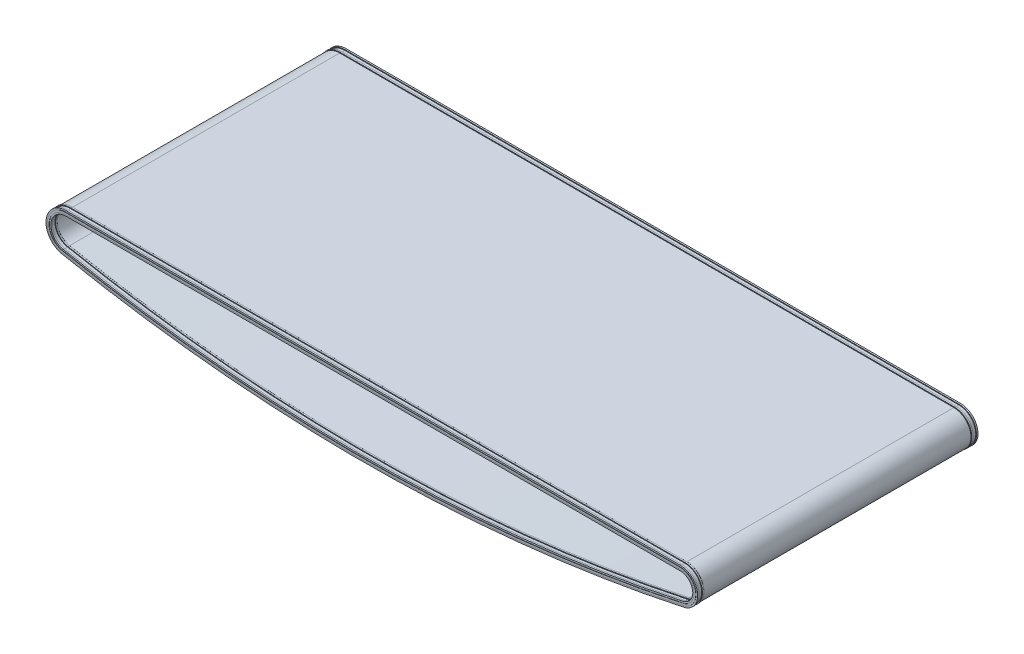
ISO-10303-21;
HEADER;
FILE_DESCRIPTION(('STEP AP214'),'2;1');
FILE_NAME('part.step','',(''),(''),'','','');
FILE_SCHEMA(('AUTOMOTIVE_DESIGN { 1 0 10303 214 1 1 1 1 }'));
ENDSEC;
DATA;
#1=APPLICATION_CONTEXT('core data for automotive mechanical design processes');
#2=APPLICATION_PROTOCOL_DEFINITION('international standard','automotive_design',2000,#1);
#3=PRODUCT_CONTEXT('',#1,'mechanical');
#4=PRODUCT('Part','Part','',(#3));
#5=PRODUCT_RELATED_PRODUCT_CATEGORY('part','',(#4));
#6=PRODUCT_DEFINITION_FORMATION('','',#4);
#7=PRODUCT_DEFINITION_CONTEXT('part definition',#1,'design');
#8=PRODUCT_DEFINITION('design','',#6,#7);
#9=PRODUCT_DEFINITION_SHAPE('','',#8);
#10=(LENGTH_UNIT() NAMED_UNIT(*) SI_UNIT(.MILLI.,.METRE.));
#11=(NAMED_UNIT(*) PLANE_ANGLE_UNIT() SI_UNIT($,.RADIAN.));
#12=(NAMED_UNIT(*) SI_UNIT($,.STERADIAN.) SOLID_ANGLE_UNIT());
#13=UNCERTAINTY_MEASURE_WITH_UNIT(LENGTH_MEASURE(1.E-05),#10,'distance_accuracy_value','');
#14=(GEOMETRIC_REPRESENTATION_CONTEXT(3) GLOBAL_UNCERTAINTY_ASSIGNED_CONTEXT((#13)) GLOBAL_UNIT_ASSIGNED_CONTEXT((#10,
#11,#12)) REPRESENTATION_CONTEXT('',''));
#15=CARTESIAN_POINT('',(0.,0.,0.));
#16=DIRECTION('',(0.,0.,1.));
#17=DIRECTION('',(1.,0.,0.));
#18=AXIS2_PLACEMENT_3D('',#15,#16,#17);
#19=CARTESIAN_POINT('',(744.993878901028,-36.5699999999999,0.));
#20=DIRECTION('',(0.,0.,1.));
#21=DIRECTION('',(1.,0.,0.));
#22=AXIS2_PLACEMENT_3D('',#19,#20,#21);
#23=CYLINDRICAL_SURFACE('',#22,42.4700000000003);
#24=DIRECTION('',(0.,0.,1.));
#25=VECTOR('',#24,1.);
#26=CARTESIAN_POINT('',(753.947506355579,-78.085460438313,336.375));
#27=LINE('',#26,#25);
#28=CARTESIAN_POINT('',(753.947506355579,-78.085460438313,336.375));
#29=VERTEX_POINT('',#28);
#30=CARTESIAN_POINT('',(753.947506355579,-78.085460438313,340.075));
#31=VERTEX_POINT('',#30);
#32=EDGE_CURVE('E1076',#29,#31,#27,.T.);
#33=ORIENTED_EDGE('',*,*,#32,.F.);
#34=CARTESIAN_POINT('',(744.993878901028,-36.5699999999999,336.375));
#35=DIRECTION('',(0.,0.,1.));
#36=DIRECTION('',(1.,0.,0.));
#37=AXIS2_PLACEMENT_3D('',#34,#35,#36);
#38=CIRCLE('',#37,42.4700000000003);
#39=CARTESIAN_POINT('',(744.993878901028,5.90000000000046,336.375));
#40=VERTEX_POINT('',#39);
#41=EDGE_CURVE('E1455',#29,#40,#38,.T.);
#42=ORIENTED_EDGE('',*,*,#41,.T.);
#43=DIRECTION('',(0.,0.,1.));
#44=VECTOR('',#43,1.);
#45=CARTESIAN_POINT('',(744.993878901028,5.90000000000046,336.375));
#46=LINE('',#45,#44);
#47=CARTESIAN_POINT('',(744.993878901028,5.90000000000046,340.075));
#48=VERTEX_POINT('',#47);
#49=EDGE_CURVE('E1308',#40,#48,#46,.T.);
#50=ORIENTED_EDGE('',*,*,#49,.T.);
#51=CARTESIAN_POINT('',(744.993878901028,-36.5699999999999,340.075));
#52=DIRECTION('',(0.,0.,1.));
#53=DIRECTION('',(1.,0.,0.));
#54=AXIS2_PLACEMENT_3D('',#51,#52,#53);
#55=CIRCLE('',#54,42.4700000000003);
#56=EDGE_CURVE('E40',#31,#48,#55,.T.);
#57=ORIENTED_EDGE('',*,*,#56,.F.);
#58=EDGE_LOOP('',(#33,#42,#50,#57));
#59=FACE_BOUND('',#58,.T.);
#60=ADVANCED_FACE('F32',(#59),#23,.T.);
#61=CARTESIAN_POINT('',(744.993878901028,-36.5699999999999,0.));
#62=DIRECTION('',(0.,0.,1.));
#63=DIRECTION('',(1.,0.,0.));
#64=AXIS2_PLACEMENT_3D('',#61,#62,#63);
#65=CYLINDRICAL_SURFACE('',#64,40.8200000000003);
#66=DIRECTION('',(0.,0.,1.));
#67=VECTOR('',#66,1.);
#68=CARTESIAN_POINT('',(753.599649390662,-76.4725452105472,328.625));
#69=LINE('',#68,#67);
#70=CARTESIAN_POINT('',(753.599649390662,-76.4725452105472,328.625));
#71=VERTEX_POINT('',#70);
#72=CARTESIAN_POINT('',(753.599649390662,-76.4725452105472,336.375));
#73=VERTEX_POINT('',#72);
#74=EDGE_CURVE('E1073',#71,#73,#69,.T.);
#75=ORIENTED_EDGE('',*,*,#74,.F.);
#76=CARTESIAN_POINT('',(744.993878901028,-36.5699999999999,328.625));
#77=DIRECTION('',(0.,0.,1.));
#78=DIRECTION('',(1.,0.,0.));
#79=AXIS2_PLACEMENT_3D('',#76,#77,#78);
#80=CIRCLE('',#79,40.8200000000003);
#81=CARTESIAN_POINT('',(744.993878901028,4.25000000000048,328.625));
#82=VERTEX_POINT('',#81);
#83=EDGE_CURVE('E1449',#71,#82,#80,.T.);
#84=ORIENTED_EDGE('',*,*,#83,.T.);
#85=DIRECTION('',(0.,0.,1.));
#86=VECTOR('',#85,1.);
#87=CARTESIAN_POINT('',(744.993878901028,4.25000000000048,328.625));
#88=LINE('',#87,#86);
#89=CARTESIAN_POINT('',(744.993878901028,4.25000000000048,336.375));
#90=VERTEX_POINT('',#89);
#91=EDGE_CURVE('E1305',#82,#90,#88,.T.);
#92=ORIENTED_EDGE('',*,*,#91,.T.);
#93=CARTESIAN_POINT('',(744.993878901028,-36.5699999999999,336.375));
#94=DIRECTION('',(0.,0.,1.));
#95=DIRECTION('',(1.,0.,0.));
#96=AXIS2_PLACEMENT_3D('',#93,#94,#95);
#97=CIRCLE('',#96,40.8200000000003);
#98=EDGE_CURVE('E1452',#73,#90,#97,.T.);
#99=ORIENTED_EDGE('',*,*,#98,.F.);
#100=EDGE_LOOP('',(#75,#84,#92,#99));
#101=FACE_BOUND('',#100,.T.);
#102=ADVANCED_FACE('F1689',(#101),#65,.T.);
#103=CARTESIAN_POINT('',(744.993878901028,-36.5699999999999,0.));
#104=DIRECTION('',(0.,0.,1.));
#105=DIRECTION('',(1.,0.,0.));
#106=AXIS2_PLACEMENT_3D('',#103,#104,#105);
#107=CYLINDRICAL_SURFACE('',#106,42.4700000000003);
#108=DIRECTION('',(0.,0.,1.));
#109=VECTOR('',#108,1.);
#110=CARTESIAN_POINT('',(753.947506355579,-78.085460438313,324.925));
#111=LINE('',#110,#109);
#112=CARTESIAN_POINT('',(753.947506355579,-78.085460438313,324.925));
#113=VERTEX_POINT('',#112);
#114=CARTESIAN_POINT('',(753.947506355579,-78.085460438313,328.625));
#115=VERTEX_POINT('',#114);
#116=EDGE_CURVE('E1070',#113,#115,#111,.T.);
#117=ORIENTED_EDGE('',*,*,#116,.F.);
#118=CARTESIAN_POINT('',(744.993878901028,-36.5699999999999,324.925));
#119=DIRECTION('',(0.,0.,1.));
#120=DIRECTION('',(1.,0.,0.));
#121=AXIS2_PLACEMENT_3D('',#118,#119,#120);
#122=CIRCLE('',#121,42.4700000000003);
#123=CARTESIAN_POINT('',(744.993878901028,5.90000000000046,324.925));
#124=VERTEX_POINT('',#123);
#125=EDGE_CURVE('E1443',#113,#124,#122,.T.);
#126=ORIENTED_EDGE('',*,*,#125,.T.);
#127=DIRECTION('',(0.,0.,1.));
#128=VECTOR('',#127,1.);
#129=CARTESIAN_POINT('',(744.993878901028,5.90000000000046,324.925));
#130=LINE('',#129,#128);
#131=CARTESIAN_POINT('',(744.993878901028,5.90000000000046,328.625));
#132=VERTEX_POINT('',#131);
#133=EDGE_CURVE('E1302',#124,#132,#130,.T.);
#134=ORIENTED_EDGE('',*,*,#133,.T.);
#135=CARTESIAN_POINT('',(744.993878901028,-36.5699999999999,328.625));
#136=DIRECTION('',(0.,0.,1.));
#137=DIRECTION('',(1.,0.,0.));
#138=AXIS2_PLACEMENT_3D('',#135,#136,#137);
#139=CIRCLE('',#138,42.4700000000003);
#140=EDGE_CURVE('E1446',#115,#132,#139,.T.);
#141=ORIENTED_EDGE('',*,*,#140,.F.);
#142=EDGE_LOOP('',(#117,#126,#134,#141));
#143=FACE_BOUND('',#142,.T.);
#144=ADVANCED_FACE('F1694',(#143),#107,.T.);
#145=CARTESIAN_POINT('',(744.993878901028,-36.5699999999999,0.));
#146=DIRECTION('',(0.,0.,1.));
#147=DIRECTION('',(1.,0.,0.));
#148=AXIS2_PLACEMENT_3D('',#145,#146,#147);
#149=CYLINDRICAL_SURFACE('',#148,38.7700000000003);
#150=DIRECTION('',(0.,0.,1.));
#151=VECTOR('',#150,1.);
#152=CARTESIAN_POINT('',(753.167463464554,-74.4686202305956,324.195));
#153=LINE('',#152,#151);
#154=CARTESIAN_POINT('',(753.167463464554,-74.4686202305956,324.195));
#155=VERTEX_POINT('',#154);
#156=CARTESIAN_POINT('',(753.167463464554,-74.4686202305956,324.925));
#157=VERTEX_POINT('',#156);
#158=EDGE_CURVE('E1067',#155,#157,#153,.T.);
#159=ORIENTED_EDGE('',*,*,#158,.F.);
#160=CARTESIAN_POINT('',(744.993878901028,-36.5699999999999,324.195));
#161=DIRECTION('',(0.,0.,1.));
#162=DIRECTION('',(1.,0.,0.));
#163=AXIS2_PLACEMENT_3D('',#160,#161,#162);
#164=CIRCLE('',#163,38.7700000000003);
#165=CARTESIAN_POINT('',(744.993878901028,2.20000000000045,324.195));
#166=VERTEX_POINT('',#165);
#167=EDGE_CURVE('E1437',#155,#166,#164,.T.);
#168=ORIENTED_EDGE('',*,*,#167,.T.);
#169=DIRECTION('',(0.,0.,1.));
#170=VECTOR('',#169,1.);
#171=CARTESIAN_POINT('',(744.993878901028,2.20000000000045,324.195));
#172=LINE('',#171,#170);
#173=CARTESIAN_POINT('',(744.993878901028,2.20000000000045,324.925));
#174=VERTEX_POINT('',#173);
#175=EDGE_CURVE('E1299',#166,#174,#172,.T.);
#176=ORIENTED_EDGE('',*,*,#175,.T.);
#177=CARTESIAN_POINT('',(744.993878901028,-36.5699999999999,324.925));
#178=DIRECTION('',(0.,0.,1.));
#179=DIRECTION('',(1.,0.,0.));
#180=AXIS2_PLACEMENT_3D('',#177,#178,#179);
#181=CIRCLE('',#180,38.7700000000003);
#182=EDGE_CURVE('E1440',#157,#174,#181,.T.);
#183=ORIENTED_EDGE('',*,*,#182,.F.);
#184=EDGE_LOOP('',(#159,#168,#176,#183));
#185=FACE_BOUND('',#184,.T.);
#186=ADVANCED_FACE('F1906',(#185),#149,.T.);
#187=CARTESIAN_POINT('',(744.993878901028,-36.5699999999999,0.));
#188=DIRECTION('',(0.,0.,1.));
#189=DIRECTION('',(1.,0.,0.));
#190=AXIS2_PLACEMENT_3D('',#187,#188,#189);
#191=CYLINDRICAL_SURFACE('',#190,38.0700000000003);
#192=DIRECTION('',(0.,0.,1.));
#193=VECTOR('',#192,1.);
#194=CARTESIAN_POINT('',(753.019887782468,-73.7843531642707,323.995));
#195=LINE('',#194,#193);
#196=CARTESIAN_POINT('',(753.019887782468,-73.7843531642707,323.995));
#197=VERTEX_POINT('',#196);
#198=CARTESIAN_POINT('',(753.019887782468,-73.7843531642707,324.195));
#199=VERTEX_POINT('',#198);
#200=EDGE_CURVE('E1064',#197,#199,#195,.T.);
#201=ORIENTED_EDGE('',*,*,#200,.F.);
#202=CARTESIAN_POINT('',(744.993878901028,-36.5699999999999,323.995));
#203=DIRECTION('',(0.,0.,1.));
#204=DIRECTION('',(1.,0.,0.));
#205=AXIS2_PLACEMENT_3D('',#202,#203,#204);
#206=CIRCLE('',#205,38.0700000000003);
#207=CARTESIAN_POINT('',(744.993878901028,1.50000000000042,323.995));
#208=VERTEX_POINT('',#207);
#209=EDGE_CURVE('E1431',#197,#208,#206,.T.);
#210=ORIENTED_EDGE('',*,*,#209,.T.);
#211=DIRECTION('',(0.,0.,1.));
#212=VECTOR('',#211,1.);
#213=CARTESIAN_POINT('',(744.993878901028,1.50000000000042,323.995));
#214=LINE('',#213,#212);
#215=CARTESIAN_POINT('',(744.993878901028,1.50000000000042,324.195));
#216=VERTEX_POINT('',#215);
#217=EDGE_CURVE('E1296',#208,#216,#214,.T.);
#218=ORIENTED_EDGE('',*,*,#217,.T.);
#219=CARTESIAN_POINT('',(744.993878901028,-36.5699999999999,324.195));
#220=DIRECTION('',(0.,0.,1.));
#221=DIRECTION('',(1.,0.,0.));
#222=AXIS2_PLACEMENT_3D('',#219,#220,#221);
#223=CIRCLE('',#222,38.0700000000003);
#224=EDGE_CURVE('E1434',#199,#216,#223,.T.);
#225=ORIENTED_EDGE('',*,*,#224,.F.);
#226=EDGE_LOOP('',(#201,#210,#218,#225));
#227=FACE_BOUND('',#226,.T.);
#228=ADVANCED_FACE('F1902',(#227),#191,.T.);
#229=CARTESIAN_POINT('',(744.993878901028,-36.5699999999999,0.));
#230=DIRECTION('',(0.,0.,1.));
#231=DIRECTION('',(1.,0.,0.));
#232=AXIS2_PLACEMENT_3D('',#229,#230,#231);
#233=CYLINDRICAL_SURFACE('',#232,41.5700000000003);
#234=DIRECTION('',(0.,0.,1.));
#235=VECTOR('',#234,1.);
#236=CARTESIAN_POINT('',(753.757766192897,-77.2056884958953,-323.995));
#237=LINE('',#236,#235);
#238=CARTESIAN_POINT('',(753.757766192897,-77.2056884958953,-323.995));
#239=VERTEX_POINT('',#238);
#240=CARTESIAN_POINT('',(753.757766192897,-77.2056884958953,323.995));
#241=VERTEX_POINT('',#240);
#242=EDGE_CURVE('E1061',#239,#241,#237,.T.);
#243=ORIENTED_EDGE('',*,*,#242,.F.);
#244=CARTESIAN_POINT('',(744.993878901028,-36.5699999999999,-323.995));
#245=DIRECTION('',(0.,0.,1.));
#246=DIRECTION('',(1.,0.,0.));
#247=AXIS2_PLACEMENT_3D('',#244,#245,#246);
#248=CIRCLE('',#247,41.5700000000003);
#249=CARTESIAN_POINT('',(744.993878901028,5.00000000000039,-323.995));
#250=VERTEX_POINT('',#249);
#251=EDGE_CURVE('E1425',#239,#250,#248,.T.);
#252=ORIENTED_EDGE('',*,*,#251,.T.);
#253=DIRECTION('',(0.,0.,1.));
#254=VECTOR('',#253,1.);
#255=CARTESIAN_POINT('',(744.993878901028,5.00000000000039,-323.995));
#256=LINE('',#255,#254);
#257=CARTESIAN_POINT('',(744.993878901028,5.00000000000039,323.995));
#258=VERTEX_POINT('',#257);
#259=EDGE_CURVE('E1293',#250,#258,#256,.T.);
#260=ORIENTED_EDGE('',*,*,#259,.T.);
#261=CARTESIAN_POINT('',(744.993878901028,-36.5699999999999,323.995));
#262=DIRECTION('',(0.,0.,1.));
#263=DIRECTION('',(1.,0.,0.));
#264=AXIS2_PLACEMENT_3D('',#261,#262,#263);
#265=CIRCLE('',#264,41.5700000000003);
#266=EDGE_CURVE('E1428',#241,#258,#265,.T.);
#267=ORIENTED_EDGE('',*,*,#266,.F.);
#268=EDGE_LOOP('',(#243,#252,#260,#267));
#269=FACE_BOUND('',#268,.T.);
#270=ADVANCED_FACE('F1898',(#269),#233,.T.);
#271=CARTESIAN_POINT('',(744.993878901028,-36.5699999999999,0.));
#272=DIRECTION('',(0.,0.,1.));
#273=DIRECTION('',(1.,0.,0.));
#274=AXIS2_PLACEMENT_3D('',#271,#272,#273);
#275=CYLINDRICAL_SURFACE('',#274,38.0700000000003);
#276=DIRECTION('',(0.,0.,1.));
#277=VECTOR('',#276,1.);
#278=CARTESIAN_POINT('',(753.019887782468,-73.7843531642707,-324.195));
#279=LINE('',#278,#277);
#280=CARTESIAN_POINT('',(753.019887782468,-73.7843531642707,-324.195));
#281=VERTEX_POINT('',#280);
#282=CARTESIAN_POINT('',(753.019887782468,-73.7843531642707,-323.995));
#283=VERTEX_POINT('',#282);
#284=EDGE_CURVE('E1058',#281,#283,#279,.T.);
#285=ORIENTED_EDGE('',*,*,#284,.F.);
#286=CARTESIAN_POINT('',(744.993878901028,-36.5699999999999,-324.195));
#287=DIRECTION('',(0.,0.,1.));
#288=DIRECTION('',(1.,0.,0.));
#289=AXIS2_PLACEMENT_3D('',#286,#287,#288);
#290=CIRCLE('',#289,38.0700000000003);
#291=CARTESIAN_POINT('',(744.993878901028,1.50000000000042,-324.195));
#292=VERTEX_POINT('',#291);
#293=EDGE_CURVE('E1419',#281,#292,#290,.T.);
#294=ORIENTED_EDGE('',*,*,#293,.T.);
#295=DIRECTION('',(0.,0.,1.));
#296=VECTOR('',#295,1.);
#297=CARTESIAN_POINT('',(744.993878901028,1.50000000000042,-324.195));
#298=LINE('',#297,#296);
#299=CARTESIAN_POINT('',(744.993878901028,1.50000000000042,-323.995));
#300=VERTEX_POINT('',#299);
#301=EDGE_CURVE('E1290',#292,#300,#298,.T.);
#302=ORIENTED_EDGE('',*,*,#301,.T.);
#303=CARTESIAN_POINT('',(744.993878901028,-36.5699999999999,-323.995));
#304=DIRECTION('',(0.,0.,1.));
#305=DIRECTION('',(1.,0.,0.));
#306=AXIS2_PLACEMENT_3D('',#303,#304,#305);
#307=CIRCLE('',#306,38.0700000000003);
#308=EDGE_CURVE('E1422',#283,#300,#307,.T.);
#309=ORIENTED_EDGE('',*,*,#308,.F.);
#310=EDGE_LOOP('',(#285,#294,#302,#309));
#311=FACE_BOUND('',#310,.T.);
#312=ADVANCED_FACE('F1894',(#311),#275,.T.);
#313=CARTESIAN_POINT('',(744.993878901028,-36.5699999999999,0.));
#314=DIRECTION('',(0.,0.,1.));
#315=DIRECTION('',(1.,0.,0.));
#316=AXIS2_PLACEMENT_3D('',#313,#314,#315);
#317=CYLINDRICAL_SURFACE('',#316,38.7700000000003);
#318=DIRECTION('',(0.,0.,1.));
#319=VECTOR('',#318,1.);
#320=CARTESIAN_POINT('',(753.167463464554,-74.4686202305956,-324.925));
#321=LINE('',#320,#319);
#322=CARTESIAN_POINT('',(753.167463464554,-74.4686202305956,-324.925));
#323=VERTEX_POINT('',#322);
#324=CARTESIAN_POINT('',(753.167463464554,-74.4686202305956,-324.195));
#325=VERTEX_POINT('',#324);
#326=EDGE_CURVE('E1055',#323,#325,#321,.T.);
#327=ORIENTED_EDGE('',*,*,#326,.F.);
#328=CARTESIAN_POINT('',(744.993878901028,-36.5699999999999,-324.925));
#329=DIRECTION('',(0.,0.,1.));
#330=DIRECTION('',(1.,0.,0.));
#331=AXIS2_PLACEMENT_3D('',#328,#329,#330);
#332=CIRCLE('',#331,38.7700000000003);
#333=CARTESIAN_POINT('',(744.993878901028,2.20000000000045,-324.925));
#334=VERTEX_POINT('',#333);
#335=EDGE_CURVE('E1413',#323,#334,#332,.T.);
#336=ORIENTED_EDGE('',*,*,#335,.T.);
#337=DIRECTION('',(0.,0.,1.));
#338=VECTOR('',#337,1.);
#339=CARTESIAN_POINT('',(744.993878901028,2.20000000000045,-324.925));
#340=LINE('',#339,#338);
#341=CARTESIAN_POINT('',(744.993878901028,2.20000000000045,-324.195));
#342=VERTEX_POINT('',#341);
#343=EDGE_CURVE('E1287',#334,#342,#340,.T.);
#344=ORIENTED_EDGE('',*,*,#343,.T.);
#345=CARTESIAN_POINT('',(744.993878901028,-36.5699999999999,-324.195));
#346=DIRECTION('',(0.,0.,1.));
#347=DIRECTION('',(1.,0.,0.));
#348=AXIS2_PLACEMENT_3D('',#345,#346,#347);
#349=CIRCLE('',#348,38.7700000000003);
#350=EDGE_CURVE('E1416',#325,#342,#349,.T.);
#351=ORIENTED_EDGE('',*,*,#350,.F.);
#352=EDGE_LOOP('',(#327,#336,#344,#351));
#353=FACE_BOUND('',#352,.T.);
#354=ADVANCED_FACE('F1890',(#353),#317,.T.);
#355=CARTESIAN_POINT('',(744.993878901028,-36.5699999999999,0.));
#356=DIRECTION('',(0.,0.,1.));
#357=DIRECTION('',(1.,0.,0.));
#358=AXIS2_PLACEMENT_3D('',#355,#356,#357);
#359=CYLINDRICAL_SURFACE('',#358,42.4700000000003);
#360=DIRECTION('',(0.,0.,1.));
#361=VECTOR('',#360,1.);
#362=CARTESIAN_POINT('',(753.947506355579,-78.085460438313,-328.625));
#363=LINE('',#362,#361);
#364=CARTESIAN_POINT('',(753.947506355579,-78.085460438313,-328.625));
#365=VERTEX_POINT('',#364);
#366=CARTESIAN_POINT('',(753.947506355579,-78.085460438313,-324.925));
#367=VERTEX_POINT('',#366);
#368=EDGE_CURVE('E1052',#365,#367,#363,.T.);
#369=ORIENTED_EDGE('',*,*,#368,.F.);
#370=CARTESIAN_POINT('',(744.993878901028,-36.5699999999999,-328.625));
#371=DIRECTION('',(0.,0.,1.));
#372=DIRECTION('',(1.,0.,0.));
#373=AXIS2_PLACEMENT_3D('',#370,#371,#372);
#374=CIRCLE('',#373,42.4700000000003);
#375=CARTESIAN_POINT('',(744.993878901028,5.90000000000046,-328.625));
#376=VERTEX_POINT('',#375);
#377=EDGE_CURVE('E1407',#365,#376,#374,.T.);
#378=ORIENTED_EDGE('',*,*,#377,.T.);
#379=DIRECTION('',(0.,0.,1.));
#380=VECTOR('',#379,1.);
#381=CARTESIAN_POINT('',(744.993878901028,5.90000000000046,-328.625));
#382=LINE('',#381,#380);
#383=CARTESIAN_POINT('',(744.993878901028,5.90000000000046,-324.925));
#384=VERTEX_POINT('',#383);
#385=EDGE_CURVE('E1284',#376,#384,#382,.T.);
#386=ORIENTED_EDGE('',*,*,#385,.T.);
#387=CARTESIAN_POINT('',(744.993878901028,-36.5699999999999,-324.925));
#388=DIRECTION('',(0.,0.,1.));
#389=DIRECTION('',(1.,0.,0.));
#390=AXIS2_PLACEMENT_3D('',#387,#388,#389);
#391=CIRCLE('',#390,42.4700000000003);
#392=EDGE_CURVE('E1410',#367,#384,#391,.T.);
#393=ORIENTED_EDGE('',*,*,#392,.F.);
#394=EDGE_LOOP('',(#369,#378,#386,#393));
#395=FACE_BOUND('',#394,.T.);
#396=ADVANCED_FACE('F1886',(#395),#359,.T.);
#397=CARTESIAN_POINT('',(744.993878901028,-36.5699999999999,0.));
#398=DIRECTION('',(0.,0.,1.));
#399=DIRECTION('',(1.,0.,0.));
#400=AXIS2_PLACEMENT_3D('',#397,#398,#399);
#401=CYLINDRICAL_SURFACE('',#400,40.8200000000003);
#402=DIRECTION('',(0.,0.,1.));
#403=VECTOR('',#402,1.);
#404=CARTESIAN_POINT('',(753.599649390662,-76.4725452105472,-336.375));
#405=LINE('',#404,#403);
#406=CARTESIAN_POINT('',(753.599649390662,-76.4725452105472,-336.375));
#407=VERTEX_POINT('',#406);
#408=CARTESIAN_POINT('',(753.599649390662,-76.4725452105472,-328.625));
#409=VERTEX_POINT('',#408);
#410=EDGE_CURVE('E1049',#407,#409,#405,.T.);
#411=ORIENTED_EDGE('',*,*,#410,.F.);
#412=CARTESIAN_POINT('',(744.993878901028,-36.5699999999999,-336.375));
#413=DIRECTION('',(0.,0.,1.));
#414=DIRECTION('',(1.,0.,0.));
#415=AXIS2_PLACEMENT_3D('',#412,#413,#414);
#416=CIRCLE('',#415,40.8200000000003);
#417=CARTESIAN_POINT('',(744.993878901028,4.25000000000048,-336.375));
#418=VERTEX_POINT('',#417);
#419=EDGE_CURVE('E1401',#407,#418,#416,.T.);
#420=ORIENTED_EDGE('',*,*,#419,.T.);
#421=DIRECTION('',(0.,0.,1.));
#422=VECTOR('',#421,1.);
#423=CARTESIAN_POINT('',(744.993878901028,4.25000000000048,-336.375));
#424=LINE('',#423,#422);
#425=CARTESIAN_POINT('',(744.993878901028,4.25000000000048,-328.625));
#426=VERTEX_POINT('',#425);
#427=EDGE_CURVE('E1281',#418,#426,#424,.T.);
#428=ORIENTED_EDGE('',*,*,#427,.T.);
#429=CARTESIAN_POINT('',(744.993878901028,-36.5699999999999,-328.625));
#430=DIRECTION('',(0.,0.,1.));
#431=DIRECTION('',(1.,0.,0.));
#432=AXIS2_PLACEMENT_3D('',#429,#430,#431);
#433=CIRCLE('',#432,40.8200000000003);
#434=EDGE_CURVE('E1404',#409,#426,#433,.T.);
#435=ORIENTED_EDGE('',*,*,#434,.F.);
#436=EDGE_LOOP('',(#411,#420,#428,#435));
#437=FACE_BOUND('',#436,.T.);
#438=ADVANCED_FACE('F1882',(#437),#401,.T.);
#439=CARTESIAN_POINT('',(744.993878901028,-36.5699999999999,0.));
#440=DIRECTION('',(0.,0.,1.));
#441=DIRECTION('',(1.,0.,0.));
#442=AXIS2_PLACEMENT_3D('',#439,#440,#441);
#443=CYLINDRICAL_SURFACE('',#442,42.4700000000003);
#444=DIRECTION('',(0.,0.,1.));
#445=VECTOR('',#444,1.);
#446=CARTESIAN_POINT('',(753.947506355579,-78.085460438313,-340.075));
#447=LINE('',#446,#445);
#448=CARTESIAN_POINT('',(753.947506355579,-78.085460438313,-340.075));
#449=VERTEX_POINT('',#448);
#450=CARTESIAN_POINT('',(753.947506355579,-78.085460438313,-336.375));
#451=VERTEX_POINT('',#450);
#452=EDGE_CURVE('E1046',#449,#451,#447,.T.);
#453=ORIENTED_EDGE('',*,*,#452,.F.);
#454=CARTESIAN_POINT('',(744.993878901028,-36.5699999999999,-340.075));
#455=DIRECTION('',(0.,0.,1.));
#456=DIRECTION('',(1.,0.,0.));
#457=AXIS2_PLACEMENT_3D('',#454,#455,#456);
#458=CIRCLE('',#457,42.4700000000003);
#459=CARTESIAN_POINT('',(744.993878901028,5.90000000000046,-340.075));
#460=VERTEX_POINT('',#459);
#461=EDGE_CURVE('E1395',#449,#460,#458,.T.);
#462=ORIENTED_EDGE('',*,*,#461,.T.);
#463=DIRECTION('',(0.,0.,1.));
#464=VECTOR('',#463,1.);
#465=CARTESIAN_POINT('',(744.993878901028,5.90000000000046,-340.075));
#466=LINE('',#465,#464);
#467=CARTESIAN_POINT('',(744.993878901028,5.90000000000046,-336.375));
#468=VERTEX_POINT('',#467);
#469=EDGE_CURVE('E1278',#460,#468,#466,.T.);
#470=ORIENTED_EDGE('',*,*,#469,.T.);
#471=CARTESIAN_POINT('',(744.993878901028,-36.5699999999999,-336.375));
#472=DIRECTION('',(0.,0.,1.));
#473=DIRECTION('',(1.,0.,0.));
#474=AXIS2_PLACEMENT_3D('',#471,#472,#473);
#475=CIRCLE('',#474,42.4700000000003);
#476=EDGE_CURVE('E1398',#451,#468,#475,.T.);
#477=ORIENTED_EDGE('',*,*,#476,.F.);
#478=EDGE_LOOP('',(#453,#462,#470,#477));
#479=FACE_BOUND('',#478,.T.);
#480=ADVANCED_FACE('F1878',(#479),#443,.T.);
#481=CARTESIAN_POINT('',(744.993878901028,-36.5699999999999,0.));
#482=DIRECTION('',(0.,0.,1.));
#483=DIRECTION('',(1.,0.,0.));
#484=AXIS2_PLACEMENT_3D('',#481,#482,#483);
#485=CYLINDRICAL_SURFACE('',#484,38.7700000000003);
#486=DIRECTION('',(0.,0.,1.));
#487=VECTOR('',#486,1.);
#488=CARTESIAN_POINT('',(753.167463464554,-74.4686202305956,-340.805));
#489=LINE('',#488,#487);
#490=CARTESIAN_POINT('',(753.167463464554,-74.4686202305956,-340.805));
#491=VERTEX_POINT('',#490);
#492=CARTESIAN_POINT('',(753.167463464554,-74.4686202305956,-340.075));
#493=VERTEX_POINT('',#492);
#494=EDGE_CURVE('E1043',#491,#493,#489,.T.);
#495=ORIENTED_EDGE('',*,*,#494,.F.);
#496=CARTESIAN_POINT('',(744.993878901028,-36.5699999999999,-340.805));
#497=DIRECTION('',(0.,0.,1.));
#498=DIRECTION('',(1.,0.,0.));
#499=AXIS2_PLACEMENT_3D('',#496,#497,#498);
#500=CIRCLE('',#499,38.7700000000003);
#501=CARTESIAN_POINT('',(744.993878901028,2.20000000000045,-340.805));
#502=VERTEX_POINT('',#501);
#503=EDGE_CURVE('E1389',#491,#502,#500,.T.);
#504=ORIENTED_EDGE('',*,*,#503,.T.);
#505=DIRECTION('',(0.,0.,1.));
#506=VECTOR('',#505,1.);
#507=CARTESIAN_POINT('',(744.993878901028,2.20000000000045,-340.805));
#508=LINE('',#507,#506);
#509=CARTESIAN_POINT('',(744.993878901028,2.20000000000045,-340.075));
#510=VERTEX_POINT('',#509);
#511=EDGE_CURVE('E1275',#502,#510,#508,.T.);
#512=ORIENTED_EDGE('',*,*,#511,.T.);
#513=CARTESIAN_POINT('',(744.993878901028,-36.5699999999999,-340.075));
#514=DIRECTION('',(0.,0.,1.));
#515=DIRECTION('',(1.,0.,0.));
#516=AXIS2_PLACEMENT_3D('',#513,#514,#515);
#517=CIRCLE('',#516,38.7700000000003);
#518=EDGE_CURVE('E1392',#493,#510,#517,.T.);
#519=ORIENTED_EDGE('',*,*,#518,.F.);
#520=EDGE_LOOP('',(#495,#504,#512,#519));
#521=FACE_BOUND('',#520,.T.);
#522=ADVANCED_FACE('F1874',(#521),#485,.T.);
#523=CARTESIAN_POINT('',(744.993878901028,-36.5699999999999,0.));
#524=DIRECTION('',(0.,0.,1.));
#525=DIRECTION('',(1.,0.,0.));
#526=AXIS2_PLACEMENT_3D('',#523,#524,#525);
#527=CYLINDRICAL_SURFACE('',#526,34.3700000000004);
#528=DIRECTION('',(0.,0.,-1.));
#529=VECTOR('',#528,1.);
#530=CARTESIAN_POINT('',(752.239844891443,-70.1675129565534,-340.075));
#531=LINE('',#530,#529);
#532=CARTESIAN_POINT('',(752.239844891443,-70.1675129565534,-340.075));
#533=VERTEX_POINT('',#532);
#534=CARTESIAN_POINT('',(752.239844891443,-70.1675129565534,-340.805));
#535=VERTEX_POINT('',#534);
#536=EDGE_CURVE('E1040',#533,#535,#531,.T.);
#537=ORIENTED_EDGE('',*,*,#536,.F.);
#538=CARTESIAN_POINT('',(744.993878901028,-36.5699999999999,-340.075));
#539=DIRECTION('',(0.,0.,1.));
#540=DIRECTION('',(1.,0.,0.));
#541=AXIS2_PLACEMENT_3D('',#538,#539,#540);
#542=CIRCLE('',#541,34.3700000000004);
#543=CARTESIAN_POINT('',(744.993878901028,-2.19999999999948,-340.075));
#544=VERTEX_POINT('',#543);
#545=EDGE_CURVE('E1383',#533,#544,#542,.T.);
#546=ORIENTED_EDGE('',*,*,#545,.T.);
#547=DIRECTION('',(0.,0.,-1.));
#548=VECTOR('',#547,1.);
#549=CARTESIAN_POINT('',(744.993878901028,-2.19999999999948,-340.075));
#550=LINE('',#549,#548);
#551=CARTESIAN_POINT('',(744.993878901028,-2.19999999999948,-340.805));
#552=VERTEX_POINT('',#551);
#553=EDGE_CURVE('E1272',#544,#552,#550,.T.);
#554=ORIENTED_EDGE('',*,*,#553,.T.);
#555=CARTESIAN_POINT('',(744.993878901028,-36.5699999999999,-340.805));
#556=DIRECTION('',(0.,0.,1.));
#557=DIRECTION('',(1.,0.,0.));
#558=AXIS2_PLACEMENT_3D('',#555,#556,#557);
#559=CIRCLE('',#558,34.3700000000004);
#560=EDGE_CURVE('E1386',#535,#552,#559,.T.);
#561=ORIENTED_EDGE('',*,*,#560,.F.);
#562=EDGE_LOOP('',(#537,#546,#554,#561));
#563=FACE_BOUND('',#562,.T.);
#564=ADVANCED_FACE('F1870',(#563),#527,.F.);
#565=CARTESIAN_POINT('',(744.993878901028,-36.5699999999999,0.));
#566=DIRECTION('',(0.,0.,1.));
#567=DIRECTION('',(1.,0.,0.));
#568=AXIS2_PLACEMENT_3D('',#565,#566,#567);
#569=CYLINDRICAL_SURFACE('',#568,30.6700000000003);
#570=DIRECTION('',(0.,0.,-1.));
#571=VECTOR('',#570,1.);
#572=CARTESIAN_POINT('',(751.459802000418,-66.5506727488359,-336.375));
#573=LINE('',#572,#571);
#574=CARTESIAN_POINT('',(751.459802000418,-66.5506727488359,-336.375));
#575=VERTEX_POINT('',#574);
#576=CARTESIAN_POINT('',(751.459802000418,-66.5506727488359,-340.075));
#577=VERTEX_POINT('',#576);
#578=EDGE_CURVE('E1037',#575,#577,#573,.T.);
#579=ORIENTED_EDGE('',*,*,#578,.F.);
#580=CARTESIAN_POINT('',(744.993878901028,-36.5699999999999,-336.375));
#581=DIRECTION('',(0.,0.,1.));
#582=DIRECTION('',(1.,0.,0.));
#583=AXIS2_PLACEMENT_3D('',#580,#581,#582);
#584=CIRCLE('',#583,30.6700000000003);
#585=CARTESIAN_POINT('',(744.993878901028,-5.89999999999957,-336.375));
#586=VERTEX_POINT('',#585);
#587=EDGE_CURVE('E1377',#575,#586,#584,.T.);
#588=ORIENTED_EDGE('',*,*,#587,.T.);
#589=DIRECTION('',(0.,0.,-1.));
#590=VECTOR('',#589,1.);
#591=CARTESIAN_POINT('',(744.993878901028,-5.89999999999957,-336.375));
#592=LINE('',#591,#590);
#593=CARTESIAN_POINT('',(744.993878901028,-5.89999999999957,-340.075));
#594=VERTEX_POINT('',#593);
#595=EDGE_CURVE('E1269',#586,#594,#592,.T.);
#596=ORIENTED_EDGE('',*,*,#595,.T.);
#597=CARTESIAN_POINT('',(744.993878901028,-36.5699999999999,-340.075));
#598=DIRECTION('',(0.,0.,1.));
#599=DIRECTION('',(1.,0.,0.));
#600=AXIS2_PLACEMENT_3D('',#597,#598,#599);
#601=CIRCLE('',#600,30.6700000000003);
#602=EDGE_CURVE('E1380',#577,#594,#601,.T.);
#603=ORIENTED_EDGE('',*,*,#602,.F.);
#604=EDGE_LOOP('',(#579,#588,#596,#603));
#605=FACE_BOUND('',#604,.T.);
#606=ADVANCED_FACE('F1866',(#605),#569,.F.);
#607=CARTESIAN_POINT('',(744.993878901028,-36.5699999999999,0.));
#608=DIRECTION('',(0.,0.,1.));
#609=DIRECTION('',(1.,0.,0.));
#610=AXIS2_PLACEMENT_3D('',#607,#608,#609);
#611=CYLINDRICAL_SURFACE('',#610,32.3200000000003);
#612=DIRECTION('',(0.,0.,-1.));
#613=VECTOR('',#612,1.);
#614=CARTESIAN_POINT('',(751.807658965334,-68.1635879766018,-328.625));
#615=LINE('',#614,#613);
#616=CARTESIAN_POINT('',(751.807658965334,-68.1635879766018,-328.625));
#617=VERTEX_POINT('',#616);
#618=CARTESIAN_POINT('',(751.807658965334,-68.1635879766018,-336.375));
#619=VERTEX_POINT('',#618);
#620=EDGE_CURVE('E1034',#617,#619,#615,.T.);
#621=ORIENTED_EDGE('',*,*,#620,.F.);
#622=CARTESIAN_POINT('',(744.993878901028,-36.5699999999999,-328.625));
#623=DIRECTION('',(0.,0.,1.));
#624=DIRECTION('',(1.,0.,0.));
#625=AXIS2_PLACEMENT_3D('',#622,#623,#624);
#626=CIRCLE('',#625,32.3200000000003);
#627=CARTESIAN_POINT('',(744.993878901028,-4.24999999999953,-328.625));
#628=VERTEX_POINT('',#627);
#629=EDGE_CURVE('E1371',#617,#628,#626,.T.);
#630=ORIENTED_EDGE('',*,*,#629,.T.);
#631=DIRECTION('',(0.,0.,-1.));
#632=VECTOR('',#631,1.);
#633=CARTESIAN_POINT('',(744.993878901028,-4.24999999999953,-328.625));
#634=LINE('',#633,#632);
#635=CARTESIAN_POINT('',(744.993878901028,-4.24999999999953,-336.375));
#636=VERTEX_POINT('',#635);
#637=EDGE_CURVE('E1266',#628,#636,#634,.T.);
#638=ORIENTED_EDGE('',*,*,#637,.T.);
#639=CARTESIAN_POINT('',(744.993878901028,-36.5699999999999,-336.375));
#640=DIRECTION('',(0.,0.,1.));
#641=DIRECTION('',(1.,0.,0.));
#642=AXIS2_PLACEMENT_3D('',#639,#640,#641);
#643=CIRCLE('',#642,32.3200000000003);
#644=EDGE_CURVE('E1374',#619,#636,#643,.T.);
#645=ORIENTED_EDGE('',*,*,#644,.F.);
#646=EDGE_LOOP('',(#621,#630,#638,#645));
#647=FACE_BOUND('',#646,.T.);
#648=ADVANCED_FACE('F1862',(#647),#611,.F.);
#649=CARTESIAN_POINT('',(744.993878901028,-36.5699999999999,0.));
#650=DIRECTION('',(0.,0.,1.));
#651=DIRECTION('',(1.,0.,0.));
#652=AXIS2_PLACEMENT_3D('',#649,#650,#651);
#653=CYLINDRICAL_SURFACE('',#652,30.6700000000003);
#654=DIRECTION('',(0.,0.,-1.));
#655=VECTOR('',#654,1.);
#656=CARTESIAN_POINT('',(751.459802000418,-66.5506727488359,-324.925));
#657=LINE('',#656,#655);
#658=CARTESIAN_POINT('',(751.459802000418,-66.5506727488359,-324.925));
#659=VERTEX_POINT('',#658);
#660=CARTESIAN_POINT('',(751.459802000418,-66.5506727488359,-328.625));
#661=VERTEX_POINT('',#660);
#662=EDGE_CURVE('E1031',#659,#661,#657,.T.);
#663=ORIENTED_EDGE('',*,*,#662,.F.);
#664=CARTESIAN_POINT('',(744.993878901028,-36.5699999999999,-324.925));
#665=DIRECTION('',(0.,0.,1.));
#666=DIRECTION('',(1.,0.,0.));
#667=AXIS2_PLACEMENT_3D('',#664,#665,#666);
#668=CIRCLE('',#667,30.6700000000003);
#669=CARTESIAN_POINT('',(744.993878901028,-5.89999999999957,-324.925));
#670=VERTEX_POINT('',#669);
#671=EDGE_CURVE('E1365',#659,#670,#668,.T.);
#672=ORIENTED_EDGE('',*,*,#671,.T.);
#673=DIRECTION('',(0.,0.,-1.));
#674=VECTOR('',#673,1.);
#675=CARTESIAN_POINT('',(744.993878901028,-5.89999999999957,-324.925));
#676=LINE('',#675,#674);
#677=CARTESIAN_POINT('',(744.993878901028,-5.89999999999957,-328.625));
#678=VERTEX_POINT('',#677);
#679=EDGE_CURVE('E1263',#670,#678,#676,.T.);
#680=ORIENTED_EDGE('',*,*,#679,.T.);
#681=CARTESIAN_POINT('',(744.993878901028,-36.5699999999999,-328.625));
#682=DIRECTION('',(0.,0.,1.));
#683=DIRECTION('',(1.,0.,0.));
#684=AXIS2_PLACEMENT_3D('',#681,#682,#683);
#685=CIRCLE('',#684,30.6700000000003);
#686=EDGE_CURVE('E1368',#661,#678,#685,.T.);
#687=ORIENTED_EDGE('',*,*,#686,.F.);
#688=EDGE_LOOP('',(#663,#672,#680,#687));
#689=FACE_BOUND('',#688,.T.);
#690=ADVANCED_FACE('F1858',(#689),#653,.F.);
#691=CARTESIAN_POINT('',(744.993878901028,-36.5699999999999,0.));
#692=DIRECTION('',(0.,0.,1.));
#693=DIRECTION('',(1.,0.,0.));
#694=AXIS2_PLACEMENT_3D('',#691,#692,#693);
#695=CYLINDRICAL_SURFACE('',#694,34.3700000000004);
#696=DIRECTION('',(0.,0.,-1.));
#697=VECTOR('',#696,1.);
#698=CARTESIAN_POINT('',(752.239844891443,-70.1675129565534,-324.195));
#699=LINE('',#698,#697);
#700=CARTESIAN_POINT('',(752.239844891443,-70.1675129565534,-324.195));
#701=VERTEX_POINT('',#700);
#702=CARTESIAN_POINT('',(752.239844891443,-70.1675129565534,-324.925));
#703=VERTEX_POINT('',#702);
#704=EDGE_CURVE('E1028',#701,#703,#699,.T.);
#705=ORIENTED_EDGE('',*,*,#704,.F.);
#706=CARTESIAN_POINT('',(744.993878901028,-36.5699999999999,-324.195));
#707=DIRECTION('',(0.,0.,1.));
#708=DIRECTION('',(1.,0.,0.));
#709=AXIS2_PLACEMENT_3D('',#706,#707,#708);
#710=CIRCLE('',#709,34.3700000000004);
#711=CARTESIAN_POINT('',(744.993878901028,-2.19999999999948,-324.195));
#712=VERTEX_POINT('',#711);
#713=EDGE_CURVE('E1359',#701,#712,#710,.T.);
#714=ORIENTED_EDGE('',*,*,#713,.T.);
#715=DIRECTION('',(0.,0.,-1.));
#716=VECTOR('',#715,1.);
#717=CARTESIAN_POINT('',(744.993878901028,-2.19999999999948,-324.195));
#718=LINE('',#717,#716);
#719=CARTESIAN_POINT('',(744.993878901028,-2.19999999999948,-324.925));
#720=VERTEX_POINT('',#719);
#721=EDGE_CURVE('E1260',#712,#720,#718,.T.);
#722=ORIENTED_EDGE('',*,*,#721,.T.);
#723=CARTESIAN_POINT('',(744.993878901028,-36.5699999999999,-324.925));
#724=DIRECTION('',(0.,0.,1.));
#725=DIRECTION('',(1.,0.,0.));
#726=AXIS2_PLACEMENT_3D('',#723,#724,#725);
#727=CIRCLE('',#726,34.3700000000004);
#728=EDGE_CURVE('E1362',#703,#720,#727,.T.);
#729=ORIENTED_EDGE('',*,*,#728,.F.);
#730=EDGE_LOOP('',(#705,#714,#722,#729));
#731=FACE_BOUND('',#730,.T.);
#732=ADVANCED_FACE('F1854',(#731),#695,.F.);
#733=CARTESIAN_POINT('',(744.993878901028,-36.5699999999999,0.));
#734=DIRECTION('',(0.,0.,1.));
#735=DIRECTION('',(1.,0.,0.));
#736=AXIS2_PLACEMENT_3D('',#733,#734,#735);
#737=CYLINDRICAL_SURFACE('',#736,35.0700000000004);
#738=DIRECTION('',(0.,0.,-1.));
#739=VECTOR('',#738,1.);
#740=CARTESIAN_POINT('',(752.387420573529,-70.8517800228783,-323.995));
#741=LINE('',#740,#739);
#742=CARTESIAN_POINT('',(752.387420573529,-70.8517800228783,-323.995));
#743=VERTEX_POINT('',#742);
#744=CARTESIAN_POINT('',(752.387420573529,-70.8517800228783,-324.195));
#745=VERTEX_POINT('',#744);
#746=EDGE_CURVE('E1025',#743,#745,#741,.T.);
#747=ORIENTED_EDGE('',*,*,#746,.F.);
#748=CARTESIAN_POINT('',(744.993878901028,-36.5699999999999,-323.995));
#749=DIRECTION('',(0.,0.,1.));
#750=DIRECTION('',(1.,0.,0.));
#751=AXIS2_PLACEMENT_3D('',#748,#749,#750);
#752=CIRCLE('',#751,35.0700000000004);
#753=CARTESIAN_POINT('',(744.993878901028,-1.4999999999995,-323.995));
#754=VERTEX_POINT('',#753);
#755=EDGE_CURVE('E1353',#743,#754,#752,.T.);
#756=ORIENTED_EDGE('',*,*,#755,.T.);
#757=DIRECTION('',(0.,0.,-1.));
#758=VECTOR('',#757,1.);
#759=CARTESIAN_POINT('',(744.993878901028,-1.4999999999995,-323.995));
#760=LINE('',#759,#758);
#761=CARTESIAN_POINT('',(744.993878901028,-1.4999999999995,-324.195));
#762=VERTEX_POINT('',#761);
#763=EDGE_CURVE('E1257',#754,#762,#760,.T.);
#764=ORIENTED_EDGE('',*,*,#763,.T.);
#765=CARTESIAN_POINT('',(744.993878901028,-36.5699999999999,-324.195));
#766=DIRECTION('',(0.,0.,1.));
#767=DIRECTION('',(1.,0.,0.));
#768=AXIS2_PLACEMENT_3D('',#765,#766,#767);
#769=CIRCLE('',#768,35.0700000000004);
#770=EDGE_CURVE('E1356',#745,#762,#769,.T.);
#771=ORIENTED_EDGE('',*,*,#770,.F.);
#772=EDGE_LOOP('',(#747,#756,#764,#771));
#773=FACE_BOUND('',#772,.T.);
#774=ADVANCED_FACE('F1850',(#773),#737,.F.);
#775=CARTESIAN_POINT('',(744.993878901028,-36.5699999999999,0.));
#776=DIRECTION('',(0.,0.,1.));
#777=DIRECTION('',(1.,0.,0.));
#778=AXIS2_PLACEMENT_3D('',#775,#776,#777);
#779=CYLINDRICAL_SURFACE('',#778,31.5700000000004);
#780=DIRECTION('',(0.,0.,-1.));
#781=VECTOR('',#780,1.);
#782=CARTESIAN_POINT('',(751.649542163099,-67.4304446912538,323.995));
#783=LINE('',#782,#781);
#784=CARTESIAN_POINT('',(751.649542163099,-67.4304446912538,323.995));
#785=VERTEX_POINT('',#784);
#786=CARTESIAN_POINT('',(751.649542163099,-67.4304446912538,-323.995));
#787=VERTEX_POINT('',#786);
#788=EDGE_CURVE('E1022',#785,#787,#783,.T.);
#789=ORIENTED_EDGE('',*,*,#788,.F.);
#790=CARTESIAN_POINT('',(744.993878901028,-36.5699999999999,323.995));
#791=DIRECTION('',(0.,0.,1.));
#792=DIRECTION('',(1.,0.,0.));
#793=AXIS2_PLACEMENT_3D('',#790,#791,#792);
#794=CIRCLE('',#793,31.5700000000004);
#795=CARTESIAN_POINT('',(744.993878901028,-4.9999999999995,323.995));
#796=VERTEX_POINT('',#795);
#797=EDGE_CURVE('E1347',#785,#796,#794,.T.);
#798=ORIENTED_EDGE('',*,*,#797,.T.);
#799=DIRECTION('',(0.,0.,-1.));
#800=VECTOR('',#799,1.);
#801=CARTESIAN_POINT('',(744.993878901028,-4.9999999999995,323.995));
#802=LINE('',#801,#800);
#803=CARTESIAN_POINT('',(744.993878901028,-4.9999999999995,-323.995));
#804=VERTEX_POINT('',#803);
#805=EDGE_CURVE('E1254',#796,#804,#802,.T.);
#806=ORIENTED_EDGE('',*,*,#805,.T.);
#807=CARTESIAN_POINT('',(744.993878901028,-36.5699999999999,-323.995));
#808=DIRECTION('',(0.,0.,1.));
#809=DIRECTION('',(1.,0.,0.));
#810=AXIS2_PLACEMENT_3D('',#807,#808,#809);
#811=CIRCLE('',#810,31.5700000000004);
#812=EDGE_CURVE('E1350',#787,#804,#811,.T.);
#813=ORIENTED_EDGE('',*,*,#812,.F.);
#814=EDGE_LOOP('',(#789,#798,#806,#813));
#815=FACE_BOUND('',#814,.T.);
#816=ADVANCED_FACE('F1846',(#815),#779,.F.);
#817=CARTESIAN_POINT('',(744.993878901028,-36.5699999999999,0.));
#818=DIRECTION('',(0.,0.,1.));
#819=DIRECTION('',(1.,0.,0.));
#820=AXIS2_PLACEMENT_3D('',#817,#818,#819);
#821=CYLINDRICAL_SURFACE('',#820,35.0700000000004);
#822=DIRECTION('',(0.,0.,-1.));
#823=VECTOR('',#822,1.);
#824=CARTESIAN_POINT('',(752.387420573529,-70.8517800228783,324.195));
#825=LINE('',#824,#823);
#826=CARTESIAN_POINT('',(752.387420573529,-70.8517800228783,324.195));
#827=VERTEX_POINT('',#826);
#828=CARTESIAN_POINT('',(752.387420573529,-70.8517800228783,323.995));
#829=VERTEX_POINT('',#828);
#830=EDGE_CURVE('E1019',#827,#829,#825,.T.);
#831=ORIENTED_EDGE('',*,*,#830,.F.);
#832=CARTESIAN_POINT('',(744.993878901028,-36.5699999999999,324.195));
#833=DIRECTION('',(0.,0.,1.));
#834=DIRECTION('',(1.,0.,0.));
#835=AXIS2_PLACEMENT_3D('',#832,#833,#834);
#836=CIRCLE('',#835,35.0700000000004);
#837=CARTESIAN_POINT('',(744.993878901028,-1.4999999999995,324.195));
#838=VERTEX_POINT('',#837);
#839=EDGE_CURVE('E1341',#827,#838,#836,.T.);
#840=ORIENTED_EDGE('',*,*,#839,.T.);
#841=DIRECTION('',(0.,0.,-1.));
#842=VECTOR('',#841,1.);
#843=CARTESIAN_POINT('',(744.993878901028,-1.4999999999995,324.195));
#844=LINE('',#843,#842);
#845=CARTESIAN_POINT('',(744.993878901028,-1.4999999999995,323.995));
#846=VERTEX_POINT('',#845);
#847=EDGE_CURVE('E1251',#838,#846,#844,.T.);
#848=ORIENTED_EDGE('',*,*,#847,.T.);
#849=CARTESIAN_POINT('',(744.993878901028,-36.5699999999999,323.995));
#850=DIRECTION('',(0.,0.,1.));
#851=DIRECTION('',(1.,0.,0.));
#852=AXIS2_PLACEMENT_3D('',#849,#850,#851);
#853=CIRCLE('',#852,35.0700000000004);
#854=EDGE_CURVE('E1344',#829,#846,#853,.T.);
#855=ORIENTED_EDGE('',*,*,#854,.F.);
#856=EDGE_LOOP('',(#831,#840,#848,#855));
#857=FACE_BOUND('',#856,.T.);
#858=ADVANCED_FACE('F1842',(#857),#821,.F.);
#859=CARTESIAN_POINT('',(744.993878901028,-36.5699999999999,0.));
#860=DIRECTION('',(0.,0.,1.));
#861=DIRECTION('',(1.,0.,0.));
#862=AXIS2_PLACEMENT_3D('',#859,#860,#861);
#863=CYLINDRICAL_SURFACE('',#862,34.3700000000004);
#864=DIRECTION('',(0.,0.,-1.));
#865=VECTOR('',#864,1.);
#866=CARTESIAN_POINT('',(752.239844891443,-70.1675129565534,324.925));
#867=LINE('',#866,#865);
#868=CARTESIAN_POINT('',(752.239844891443,-70.1675129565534,324.925));
#869=VERTEX_POINT('',#868);
#870=CARTESIAN_POINT('',(752.239844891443,-70.1675129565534,324.195));
#871=VERTEX_POINT('',#870);
#872=EDGE_CURVE('E1016',#869,#871,#867,.T.);
#873=ORIENTED_EDGE('',*,*,#872,.F.);
#874=CARTESIAN_POINT('',(744.993878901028,-36.5699999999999,324.925));
#875=DIRECTION('',(0.,0.,1.));
#876=DIRECTION('',(1.,0.,0.));
#877=AXIS2_PLACEMENT_3D('',#874,#875,#876);
#878=CIRCLE('',#877,34.3700000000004);
#879=CARTESIAN_POINT('',(744.993878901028,-2.19999999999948,324.925));
#880=VERTEX_POINT('',#879);
#881=EDGE_CURVE('E1335',#869,#880,#878,.T.);
#882=ORIENTED_EDGE('',*,*,#881,.T.);
#883=DIRECTION('',(0.,0.,-1.));
#884=VECTOR('',#883,1.);
#885=CARTESIAN_POINT('',(744.993878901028,-2.19999999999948,324.925));
#886=LINE('',#885,#884);
#887=CARTESIAN_POINT('',(744.993878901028,-2.19999999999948,324.195));
#888=VERTEX_POINT('',#887);
#889=EDGE_CURVE('E1248',#880,#888,#886,.T.);
#890=ORIENTED_EDGE('',*,*,#889,.T.);
#891=CARTESIAN_POINT('',(744.993878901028,-36.5699999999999,324.195));
#892=DIRECTION('',(0.,0.,1.));
#893=DIRECTION('',(1.,0.,0.));
#894=AXIS2_PLACEMENT_3D('',#891,#892,#893);
#895=CIRCLE('',#894,34.3700000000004);
#896=EDGE_CURVE('E1338',#871,#888,#895,.T.);
#897=ORIENTED_EDGE('',*,*,#896,.F.);
#898=EDGE_LOOP('',(#873,#882,#890,#897));
#899=FACE_BOUND('',#898,.T.);
#900=ADVANCED_FACE('F1838',(#899),#863,.F.);
#901=CARTESIAN_POINT('',(744.993878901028,-36.5699999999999,0.));
#902=DIRECTION('',(0.,0.,1.));
#903=DIRECTION('',(1.,0.,0.));
#904=AXIS2_PLACEMENT_3D('',#901,#902,#903);
#905=CYLINDRICAL_SURFACE('',#904,30.6700000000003);
#906=DIRECTION('',(0.,0.,-1.));
#907=VECTOR('',#906,1.);
#908=CARTESIAN_POINT('',(751.459802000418,-66.5506727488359,328.625));
#909=LINE('',#908,#907);
#910=CARTESIAN_POINT('',(751.459802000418,-66.5506727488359,328.625));
#911=VERTEX_POINT('',#910);
#912=CARTESIAN_POINT('',(751.459802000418,-66.5506727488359,324.925));
#913=VERTEX_POINT('',#912);
#914=EDGE_CURVE('E1013',#911,#913,#909,.T.);
#915=ORIENTED_EDGE('',*,*,#914,.F.);
#916=CARTESIAN_POINT('',(744.993878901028,-36.5699999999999,328.625));
#917=DIRECTION('',(0.,0.,1.));
#918=DIRECTION('',(1.,0.,0.));
#919=AXIS2_PLACEMENT_3D('',#916,#917,#918);
#920=CIRCLE('',#919,30.6700000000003);
#921=CARTESIAN_POINT('',(744.993878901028,-5.89999999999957,328.625));
#922=VERTEX_POINT('',#921);
#923=EDGE_CURVE('E1329',#911,#922,#920,.T.);
#924=ORIENTED_EDGE('',*,*,#923,.T.);
#925=DIRECTION('',(0.,0.,-1.));
#926=VECTOR('',#925,1.);
#927=CARTESIAN_POINT('',(744.993878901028,-5.89999999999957,328.625));
#928=LINE('',#927,#926);
#929=CARTESIAN_POINT('',(744.993878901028,-5.89999999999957,324.925));
#930=VERTEX_POINT('',#929);
#931=EDGE_CURVE('E1245',#922,#930,#928,.T.);
#932=ORIENTED_EDGE('',*,*,#931,.T.);
#933=CARTESIAN_POINT('',(744.993878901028,-36.5699999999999,324.925));
#934=DIRECTION('',(0.,0.,1.));
#935=DIRECTION('',(1.,0.,0.));
#936=AXIS2_PLACEMENT_3D('',#933,#934,#935);
#937=CIRCLE('',#936,30.6700000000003);
#938=EDGE_CURVE('E1332',#913,#930,#937,.T.);
#939=ORIENTED_EDGE('',*,*,#938,.F.);
#940=EDGE_LOOP('',(#915,#924,#932,#939));
#941=FACE_BOUND('',#940,.T.);
#942=ADVANCED_FACE('F1834',(#941),#905,.F.);
#943=CARTESIAN_POINT('',(744.993878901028,-36.5699999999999,0.));
#944=DIRECTION('',(0.,0.,1.));
#945=DIRECTION('',(1.,0.,0.));
#946=AXIS2_PLACEMENT_3D('',#943,#944,#945);
#947=CYLINDRICAL_SURFACE('',#946,32.3200000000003);
#948=DIRECTION('',(0.,0.,-1.));
#949=VECTOR('',#948,1.);
#950=CARTESIAN_POINT('',(751.807658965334,-68.1635879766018,336.375));
#951=LINE('',#950,#949);
#952=CARTESIAN_POINT('',(751.807658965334,-68.1635879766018,336.375));
#953=VERTEX_POINT('',#952);
#954=CARTESIAN_POINT('',(751.807658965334,-68.1635879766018,328.625));
#955=VERTEX_POINT('',#954);
#956=EDGE_CURVE('E1010',#953,#955,#951,.T.);
#957=ORIENTED_EDGE('',*,*,#956,.F.);
#958=CARTESIAN_POINT('',(744.993878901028,-36.5699999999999,336.375));
#959=DIRECTION('',(0.,0.,1.));
#960=DIRECTION('',(1.,0.,0.));
#961=AXIS2_PLACEMENT_3D('',#958,#959,#960);
#962=CIRCLE('',#961,32.3200000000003);
#963=CARTESIAN_POINT('',(744.993878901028,-4.24999999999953,336.375));
#964=VERTEX_POINT('',#963);
#965=EDGE_CURVE('E1323',#953,#964,#962,.T.);
#966=ORIENTED_EDGE('',*,*,#965,.T.);
#967=DIRECTION('',(0.,0.,-1.));
#968=VECTOR('',#967,1.);
#969=CARTESIAN_POINT('',(744.993878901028,-4.24999999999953,336.375));
#970=LINE('',#969,#968);
#971=CARTESIAN_POINT('',(744.993878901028,-4.24999999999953,328.625));
#972=VERTEX_POINT('',#971);
#973=EDGE_CURVE('E1242',#964,#972,#970,.T.);
#974=ORIENTED_EDGE('',*,*,#973,.T.);
#975=CARTESIAN_POINT('',(744.993878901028,-36.5699999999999,328.625));
#976=DIRECTION('',(0.,0.,1.));
#977=DIRECTION('',(1.,0.,0.));
#978=AXIS2_PLACEMENT_3D('',#975,#976,#977);
#979=CIRCLE('',#978,32.3200000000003);
#980=EDGE_CURVE('E1326',#955,#972,#979,.T.);
#981=ORIENTED_EDGE('',*,*,#980,.F.);
#982=EDGE_LOOP('',(#957,#966,#974,#981));
#983=FACE_BOUND('',#982,.T.);
#984=ADVANCED_FACE('F1830',(#983),#947,.F.);
#985=CARTESIAN_POINT('',(744.993878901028,-36.5699999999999,0.));
#986=DIRECTION('',(0.,0.,1.));
#987=DIRECTION('',(1.,0.,0.));
#988=AXIS2_PLACEMENT_3D('',#985,#986,#987);
#989=CYLINDRICAL_SURFACE('',#988,30.6700000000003);
#990=DIRECTION('',(0.,0.,-1.));
#991=VECTOR('',#990,1.);
#992=CARTESIAN_POINT('',(751.459802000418,-66.5506727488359,340.075));
#993=LINE('',#992,#991);
#994=CARTESIAN_POINT('',(751.459802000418,-66.5506727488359,340.075));
#995=VERTEX_POINT('',#994);
#996=CARTESIAN_POINT('',(751.459802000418,-66.5506727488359,336.375));
#997=VERTEX_POINT('',#996);
#998=EDGE_CURVE('E1007',#995,#997,#993,.T.);
#999=ORIENTED_EDGE('',*,*,#998,.F.);
#1000=CARTESIAN_POINT('',(744.993878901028,-36.5699999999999,340.075));
#1001=DIRECTION('',(0.,0.,1.));
#1002=DIRECTION('',(1.,0.,0.));
#1003=AXIS2_PLACEMENT_3D('',#1000,#1001,#1002);
#1004=CIRCLE('',#1003,30.6700000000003);
#1005=CARTESIAN_POINT('',(744.993878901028,-5.89999999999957,340.075));
#1006=VERTEX_POINT('',#1005);
#1007=EDGE_CURVE('E1317',#995,#1006,#1004,.T.);
#1008=ORIENTED_EDGE('',*,*,#1007,.T.);
#1009=DIRECTION('',(0.,0.,-1.));
#1010=VECTOR('',#1009,1.);
#1011=CARTESIAN_POINT('',(744.993878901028,-5.89999999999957,340.075));
#1012=LINE('',#1011,#1010);
#1013=CARTESIAN_POINT('',(744.993878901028,-5.89999999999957,336.375));
#1014=VERTEX_POINT('',#1013);
#1015=EDGE_CURVE('E1239',#1006,#1014,#1012,.T.);
#1016=ORIENTED_EDGE('',*,*,#1015,.T.);
#1017=CARTESIAN_POINT('',(744.993878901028,-36.5699999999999,336.375));
#1018=DIRECTION('',(0.,0.,1.));
#1019=DIRECTION('',(1.,0.,0.));
#1020=AXIS2_PLACEMENT_3D('',#1017,#1018,#1019);
#1021=CIRCLE('',#1020,30.6700000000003);
#1022=EDGE_CURVE('E1320',#997,#1014,#1021,.T.);
#1023=ORIENTED_EDGE('',*,*,#1022,.F.);
#1024=EDGE_LOOP('',(#999,#1008,#1016,#1023));
#1025=FACE_BOUND('',#1024,.T.);
#1026=ADVANCED_FACE('F1827',(#1025),#989,.F.);
#1027=CARTESIAN_POINT('',(744.993878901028,-36.5699999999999,0.));
#1028=DIRECTION('',(0.,0.,1.));
#1029=DIRECTION('',(1.,0.,0.));
#1030=AXIS2_PLACEMENT_3D('',#1027,#1028,#1029);
#1031=CYLINDRICAL_SURFACE('',#1030,34.3700000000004);
#1032=DIRECTION('',(0.,0.,-1.));
#1033=VECTOR('',#1032,1.);
#1034=CARTESIAN_POINT('',(752.239844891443,-70.1675129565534,340.805));
#1035=LINE('',#1034,#1033);
#1036=CARTESIAN_POINT('',(752.239844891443,-70.1675129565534,340.805));
#1037=VERTEX_POINT('',#1036);
#1038=CARTESIAN_POINT('',(752.239844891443,-70.1675129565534,340.075));
#1039=VERTEX_POINT('',#1038);
#1040=EDGE_CURVE('E1004',#1037,#1039,#1035,.T.);
#1041=ORIENTED_EDGE('',*,*,#1040,.F.);
#1042=CARTESIAN_POINT('',(744.993878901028,-36.5699999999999,340.805));
#1043=DIRECTION('',(0.,0.,1.));
#1044=DIRECTION('',(1.,0.,0.));
#1045=AXIS2_PLACEMENT_3D('',#1042,#1043,#1044);
#1046=CIRCLE('',#1045,34.3700000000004);
#1047=CARTESIAN_POINT('',(744.993878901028,-2.19999999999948,340.805));
#1048=VERTEX_POINT('',#1047);
#1049=EDGE_CURVE('E1311',#1037,#1048,#1046,.T.);
#1050=ORIENTED_EDGE('',*,*,#1049,.T.);
#1051=DIRECTION('',(0.,0.,-1.));
#1052=VECTOR('',#1051,1.);
#1053=CARTESIAN_POINT('',(744.993878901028,-2.19999999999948,340.805));
#1054=LINE('',#1053,#1052);
#1055=CARTESIAN_POINT('',(744.993878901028,-2.19999999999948,340.075));
#1056=VERTEX_POINT('',#1055);
#1057=EDGE_CURVE('E1236',#1048,#1056,#1054,.T.);
#1058=ORIENTED_EDGE('',*,*,#1057,.T.);
#1059=CARTESIAN_POINT('',(744.993878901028,-36.5699999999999,340.075));
#1060=DIRECTION('',(0.,0.,1.));
#1061=DIRECTION('',(1.,0.,0.));
#1062=AXIS2_PLACEMENT_3D('',#1059,#1060,#1061);
#1063=CIRCLE('',#1062,34.3700000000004);
#1064=EDGE_CURVE('E1314',#1039,#1056,#1063,.T.);
#1065=ORIENTED_EDGE('',*,*,#1064,.F.);
#1066=EDGE_LOOP('',(#1041,#1050,#1058,#1065));
#1067=FACE_BOUND('',#1066,.T.);
#1068=ADVANCED_FACE('F1668',(#1067),#1031,.F.);
#1069=CARTESIAN_POINT('',(744.993878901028,-36.5699999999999,0.));
#1070=DIRECTION('',(0.,0.,1.));
#1071=DIRECTION('',(1.,0.,0.));
#1072=AXIS2_PLACEMENT_3D('',#1069,#1070,#1071);
#1073=CYLINDRICAL_SURFACE('',#1072,38.7700000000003);
#1074=DIRECTION('',(0.,0.,1.));
#1075=VECTOR('',#1074,1.);
#1076=CARTESIAN_POINT('',(753.167463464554,-74.4686202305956,340.075));
#1077=LINE('',#1076,#1075);
#1078=CARTESIAN_POINT('',(753.167463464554,-74.4686202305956,340.075));
#1079=VERTEX_POINT('',#1078);
#1080=CARTESIAN_POINT('',(753.167463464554,-74.4686202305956,340.805));
#1081=VERTEX_POINT('',#1080);
#1082=EDGE_CURVE('E1001',#1079,#1081,#1077,.T.);
#1083=ORIENTED_EDGE('',*,*,#1082,.F.);
#1084=CARTESIAN_POINT('',(744.993878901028,-36.5699999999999,340.075));
#1085=DIRECTION('',(0.,0.,1.));
#1086=DIRECTION('',(1.,0.,0.));
#1087=AXIS2_PLACEMENT_3D('',#1084,#1085,#1086);
#1088=CIRCLE('',#1087,38.7700000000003);
#1089=CARTESIAN_POINT('',(744.993878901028,2.20000000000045,340.075));
#1090=VERTEX_POINT('',#1089);
#1091=EDGE_CURVE('E11',#1079,#1090,#1088,.T.);
#1092=ORIENTED_EDGE('',*,*,#1091,.T.);
#1093=DIRECTION('',(0.,0.,1.));
#1094=VECTOR('',#1093,1.);
#1095=CARTESIAN_POINT('',(744.993878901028,2.20000000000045,340.075));
#1096=LINE('',#1095,#1094);
#1097=CARTESIAN_POINT('',(744.993878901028,2.20000000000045,340.805));
#1098=VERTEX_POINT('',#1097);
#1099=EDGE_CURVE('E1234',#1090,#1098,#1096,.T.);
#1100=ORIENTED_EDGE('',*,*,#1099,.T.);
#1101=CARTESIAN_POINT('',(744.993878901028,-36.5699999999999,340.805));
#1102=DIRECTION('',(0.,0.,1.));
#1103=DIRECTION('',(1.,0.,0.));
#1104=AXIS2_PLACEMENT_3D('',#1101,#1102,#1103);
#1105=CIRCLE('',#1104,38.7700000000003);
#1106=EDGE_CURVE('E693',#1081,#1098,#1105,.T.);
#1107=ORIENTED_EDGE('',*,*,#1106,.F.);
#1108=EDGE_LOOP('',(#1083,#1092,#1100,#1107));
#1109=FACE_BOUND('',#1108,.T.);
#1110=ADVANCED_FACE('F1821',(#1109),#1073,.T.);
#1111=CARTESIAN_POINT('',(-29.4474608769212,3554.29738492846,0.));
#1112=DIRECTION('',(0.,0.,1.));
#1113=DIRECTION('',(1.,0.,0.));
#1114=AXIS2_PLACEMENT_3D('',#1111,#1112,#1113);
#1115=CYLINDRICAL_SURFACE('',#1114,3715.9);
#1116=DIRECTION('',(0.,0.,1.));
#1117=VECTOR('',#1116,1.);
#1118=CARTESIAN_POINT('',(-754.458690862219,-90.1876989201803,336.375));
#1119=LINE('',#1118,#1117);
#1120=CARTESIAN_POINT('',(-754.458690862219,-90.1876989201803,336.375));
#1121=VERTEX_POINT('',#1120);
#1122=CARTESIAN_POINT('',(-754.458690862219,-90.1876989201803,340.075));
#1123=VERTEX_POINT('',#1122);
#1124=EDGE_CURVE('E688',#1121,#1123,#1119,.T.);
#1125=ORIENTED_EDGE('',*,*,#1124,.F.);
#1126=CARTESIAN_POINT('',(-29.4474608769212,3554.29738492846,336.375));
#1127=DIRECTION('',(0.,0.,1.));
#1128=DIRECTION('',(1.,0.,0.));
#1129=AXIS2_PLACEMENT_3D('',#1126,#1127,#1128);
#1130=CIRCLE('',#1129,3715.9);
#1131=EDGE_CURVE('E1225',#1121,#29,#1130,.T.);
#1132=ORIENTED_EDGE('',*,*,#1131,.T.);
#1133=ORIENTED_EDGE('',*,*,#32,.T.);
#1134=CARTESIAN_POINT('',(-29.4474608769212,3554.29738492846,340.075));
#1135=DIRECTION('',(0.,0.,1.));
#1136=DIRECTION('',(1.,0.,0.));
#1137=AXIS2_PLACEMENT_3D('',#1134,#1135,#1136);
#1138=CIRCLE('',#1137,3715.9);
#1139=EDGE_CURVE('E1228',#1123,#31,#1138,.T.);
#1140=ORIENTED_EDGE('',*,*,#1139,.F.);
#1141=EDGE_LOOP('',(#1125,#1132,#1133,#1140));
#1142=FACE_BOUND('',#1141,.T.);
#1143=ADVANCED_FACE('F1699',(#1142),#1115,.T.);
#1144=CARTESIAN_POINT('',(-29.4474608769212,3554.29738492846,0.));
#1145=DIRECTION('',(0.,0.,1.));
#1146=DIRECTION('',(1.,0.,0.));
#1147=AXIS2_PLACEMENT_3D('',#1144,#1145,#1146);
#1148=CYLINDRICAL_SURFACE('',#1147,3714.25);
#1149=DIRECTION('',(0.,0.,1.));
#1150=VECTOR('',#1149,1.);
#1151=CARTESIAN_POINT('',(-754.136758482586,-88.5694098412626,328.625));
#1152=LINE('',#1151,#1150);
#1153=CARTESIAN_POINT('',(-754.136758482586,-88.5694098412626,328.625));
#1154=VERTEX_POINT('',#1153);
#1155=CARTESIAN_POINT('',(-754.136758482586,-88.5694098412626,336.375));
#1156=VERTEX_POINT('',#1155);
#1157=EDGE_CURVE('E845',#1154,#1156,#1152,.T.);
#1158=ORIENTED_EDGE('',*,*,#1157,.F.);
#1159=CARTESIAN_POINT('',(-29.4474608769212,3554.29738492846,328.625));
#1160=DIRECTION('',(0.,0.,1.));
#1161=DIRECTION('',(1.,0.,0.));
#1162=AXIS2_PLACEMENT_3D('',#1159,#1160,#1161);
#1163=CIRCLE('',#1162,3714.25);
#1164=EDGE_CURVE('E1219',#1154,#71,#1163,.T.);
#1165=ORIENTED_EDGE('',*,*,#1164,.T.);
#1166=ORIENTED_EDGE('',*,*,#74,.T.);
#1167=CARTESIAN_POINT('',(-29.4474608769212,3554.29738492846,336.375));
#1168=DIRECTION('',(0.,0.,1.));
#1169=DIRECTION('',(1.,0.,0.));
#1170=AXIS2_PLACEMENT_3D('',#1167,#1168,#1169);
#1171=CIRCLE('',#1170,3714.25);
#1172=EDGE_CURVE('E1222',#1156,#73,#1171,.T.);
#1173=ORIENTED_EDGE('',*,*,#1172,.F.);
#1174=EDGE_LOOP('',(#1158,#1165,#1166,#1173));
#1175=FACE_BOUND('',#1174,.T.);
#1176=ADVANCED_FACE('F1814',(#1175),#1148,.T.);
#1177=CARTESIAN_POINT('',(-29.4474608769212,3554.29738492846,0.));
#1178=DIRECTION('',(0.,0.,1.));
#1179=DIRECTION('',(1.,0.,0.));
#1180=AXIS2_PLACEMENT_3D('',#1177,#1178,#1179);
#1181=CYLINDRICAL_SURFACE('',#1180,3715.9);
#1182=DIRECTION('',(0.,0.,1.));
#1183=VECTOR('',#1182,1.);
#1184=CARTESIAN_POINT('',(-754.458690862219,-90.1876989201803,324.925));
#1185=LINE('',#1184,#1183);
#1186=CARTESIAN_POINT('',(-754.458690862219,-90.1876989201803,324.925));
#1187=VERTEX_POINT('',#1186);
#1188=CARTESIAN_POINT('',(-754.458690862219,-90.1876989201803,328.625));
#1189=VERTEX_POINT('',#1188);
#1190=EDGE_CURVE('E842',#1187,#1189,#1185,.T.);
#1191=ORIENTED_EDGE('',*,*,#1190,.F.);
#1192=CARTESIAN_POINT('',(-29.4474608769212,3554.29738492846,324.925));
#1193=DIRECTION('',(0.,0.,1.));
#1194=DIRECTION('',(1.,0.,0.));
#1195=AXIS2_PLACEMENT_3D('',#1192,#1193,#1194);
#1196=CIRCLE('',#1195,3715.9);
#1197=EDGE_CURVE('E1213',#1187,#113,#1196,.T.);
#1198=ORIENTED_EDGE('',*,*,#1197,.T.);
#1199=ORIENTED_EDGE('',*,*,#116,.T.);
#1200=CARTESIAN_POINT('',(-29.4474608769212,3554.29738492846,328.625));
#1201=DIRECTION('',(0.,0.,1.));
#1202=DIRECTION('',(1.,0.,0.));
#1203=AXIS2_PLACEMENT_3D('',#1200,#1201,#1202);
#1204=CIRCLE('',#1203,3715.9);
#1205=EDGE_CURVE('E1216',#1189,#115,#1204,.T.);
#1206=ORIENTED_EDGE('',*,*,#1205,.F.);
#1207=EDGE_LOOP('',(#1191,#1198,#1199,#1206));
#1208=FACE_BOUND('',#1207,.T.);
#1209=ADVANCED_FACE('F1810',(#1208),#1181,.T.);
#1210=CARTESIAN_POINT('',(-29.4474608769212,3554.29738492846,0.));
#1211=DIRECTION('',(0.,0.,1.));
#1212=DIRECTION('',(1.,0.,0.));
#1213=AXIS2_PLACEMENT_3D('',#1210,#1211,#1212);
#1214=CYLINDRICAL_SURFACE('',#1213,3712.2);
#1215=DIRECTION('',(0.,0.,1.));
#1216=VECTOR('',#1215,1.);
#1217=CARTESIAN_POINT('',(-753.73678188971,-86.5588082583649,324.195));
#1218=LINE('',#1217,#1216);
#1219=CARTESIAN_POINT('',(-753.73678188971,-86.5588082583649,324.195));
#1220=VERTEX_POINT('',#1219);
#1221=CARTESIAN_POINT('',(-753.73678188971,-86.5588082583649,324.925));
#1222=VERTEX_POINT('',#1221);
#1223=EDGE_CURVE('E839',#1220,#1222,#1218,.T.);
#1224=ORIENTED_EDGE('',*,*,#1223,.F.);
#1225=CARTESIAN_POINT('',(-29.4474608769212,3554.29738492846,324.195));
#1226=DIRECTION('',(0.,0.,1.));
#1227=DIRECTION('',(1.,0.,0.));
#1228=AXIS2_PLACEMENT_3D('',#1225,#1226,#1227);
#1229=CIRCLE('',#1228,3712.2);
#1230=EDGE_CURVE('E1207',#1220,#155,#1229,.T.);
#1231=ORIENTED_EDGE('',*,*,#1230,.T.);
#1232=ORIENTED_EDGE('',*,*,#158,.T.);
#1233=CARTESIAN_POINT('',(-29.4474608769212,3554.29738492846,324.925));
#1234=DIRECTION('',(0.,0.,1.));
#1235=DIRECTION('',(1.,0.,0.));
#1236=AXIS2_PLACEMENT_3D('',#1233,#1234,#1235);
#1237=CIRCLE('',#1236,3712.2);
#1238=EDGE_CURVE('E1210',#1222,#157,#1237,.T.);
#1239=ORIENTED_EDGE('',*,*,#1238,.F.);
#1240=EDGE_LOOP('',(#1224,#1231,#1232,#1239));
#1241=FACE_BOUND('',#1240,.T.);
#1242=ADVANCED_FACE('F1806',(#1241),#1214,.T.);
#1243=CARTESIAN_POINT('',(-29.4474608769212,3554.29738492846,0.));
#1244=DIRECTION('',(0.,0.,1.));
#1245=DIRECTION('',(1.,0.,0.));
#1246=AXIS2_PLACEMENT_3D('',#1243,#1244,#1245);
#1247=CYLINDRICAL_SURFACE('',#1246,3711.5);
#1248=DIRECTION('',(0.,0.,1.));
#1249=VECTOR('',#1248,1.);
#1250=CARTESIAN_POINT('',(-753.600204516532,-85.8722613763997,323.995));
#1251=LINE('',#1250,#1249);
#1252=CARTESIAN_POINT('',(-753.600204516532,-85.8722613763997,323.995));
#1253=VERTEX_POINT('',#1252);
#1254=CARTESIAN_POINT('',(-753.600204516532,-85.8722613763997,324.195));
#1255=VERTEX_POINT('',#1254);
#1256=EDGE_CURVE('E836',#1253,#1255,#1251,.T.);
#1257=ORIENTED_EDGE('',*,*,#1256,.F.);
#1258=CARTESIAN_POINT('',(-29.4474608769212,3554.29738492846,323.995));
#1259=DIRECTION('',(0.,0.,1.));
#1260=DIRECTION('',(1.,0.,0.));
#1261=AXIS2_PLACEMENT_3D('',#1258,#1259,#1260);
#1262=CIRCLE('',#1261,3711.5);
#1263=EDGE_CURVE('E1201',#1253,#197,#1262,.T.);
#1264=ORIENTED_EDGE('',*,*,#1263,.T.);
#1265=ORIENTED_EDGE('',*,*,#200,.T.);
#1266=CARTESIAN_POINT('',(-29.4474608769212,3554.29738492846,324.195));
#1267=DIRECTION('',(0.,0.,1.));
#1268=DIRECTION('',(1.,0.,0.));
#1269=AXIS2_PLACEMENT_3D('',#1266,#1267,#1268);
#1270=CIRCLE('',#1269,3711.5);
#1271=EDGE_CURVE('E1204',#1255,#199,#1270,.T.);
#1272=ORIENTED_EDGE('',*,*,#1271,.F.);
#1273=EDGE_LOOP('',(#1257,#1264,#1265,#1272));
#1274=FACE_BOUND('',#1273,.T.);
#1275=ADVANCED_FACE('F1802',(#1274),#1247,.T.);
#1276=CARTESIAN_POINT('',(-29.4474608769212,3554.29738492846,0.));
#1277=DIRECTION('',(0.,0.,1.));
#1278=DIRECTION('',(1.,0.,0.));
#1279=AXIS2_PLACEMENT_3D('',#1276,#1277,#1278);
#1280=CYLINDRICAL_SURFACE('',#1279,3715.);
#1281=DIRECTION('',(0.,0.,1.));
#1282=VECTOR('',#1281,1.);
#1283=CARTESIAN_POINT('',(-754.283091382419,-89.3049957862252,-323.995));
#1284=LINE('',#1283,#1282);
#1285=CARTESIAN_POINT('',(-754.283091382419,-89.3049957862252,-323.995));
#1286=VERTEX_POINT('',#1285);
#1287=CARTESIAN_POINT('',(-754.283091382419,-89.3049957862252,323.995));
#1288=VERTEX_POINT('',#1287);
#1289=EDGE_CURVE('E833',#1286,#1288,#1284,.T.);
#1290=ORIENTED_EDGE('',*,*,#1289,.F.);
#1291=CARTESIAN_POINT('',(-29.4474608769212,3554.29738492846,-323.995));
#1292=DIRECTION('',(0.,0.,1.));
#1293=DIRECTION('',(1.,0.,0.));
#1294=AXIS2_PLACEMENT_3D('',#1291,#1292,#1293);
#1295=CIRCLE('',#1294,3715.);
#1296=EDGE_CURVE('E1195',#1286,#239,#1295,.T.);
#1297=ORIENTED_EDGE('',*,*,#1296,.T.);
#1298=ORIENTED_EDGE('',*,*,#242,.T.);
#1299=CARTESIAN_POINT('',(-29.4474608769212,3554.29738492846,323.995));
#1300=DIRECTION('',(0.,0.,1.));
#1301=DIRECTION('',(1.,0.,0.));
#1302=AXIS2_PLACEMENT_3D('',#1299,#1300,#1301);
#1303=CIRCLE('',#1302,3715.);
#1304=EDGE_CURVE('E1198',#1288,#241,#1303,.T.);
#1305=ORIENTED_EDGE('',*,*,#1304,.F.);
#1306=EDGE_LOOP('',(#1290,#1297,#1298,#1305));
#1307=FACE_BOUND('',#1306,.T.);
#1308=ADVANCED_FACE('F1798',(#1307),#1280,.T.);
#1309=CARTESIAN_POINT('',(-29.4474608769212,3554.29738492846,0.));
#1310=DIRECTION('',(0.,0.,1.));
#1311=DIRECTION('',(1.,0.,0.));
#1312=AXIS2_PLACEMENT_3D('',#1309,#1310,#1311);
#1313=CYLINDRICAL_SURFACE('',#1312,3711.5);
#1314=DIRECTION('',(0.,0.,1.));
#1315=VECTOR('',#1314,1.);
#1316=CARTESIAN_POINT('',(-753.600204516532,-85.8722613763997,-324.195));
#1317=LINE('',#1316,#1315);
#1318=CARTESIAN_POINT('',(-753.600204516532,-85.8722613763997,-324.195));
#1319=VERTEX_POINT('',#1318);
#1320=CARTESIAN_POINT('',(-753.600204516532,-85.8722613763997,-323.995));
#1321=VERTEX_POINT('',#1320);
#1322=EDGE_CURVE('E830',#1319,#1321,#1317,.T.);
#1323=ORIENTED_EDGE('',*,*,#1322,.F.);
#1324=CARTESIAN_POINT('',(-29.4474608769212,3554.29738492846,-324.195));
#1325=DIRECTION('',(0.,0.,1.));
#1326=DIRECTION('',(1.,0.,0.));
#1327=AXIS2_PLACEMENT_3D('',#1324,#1325,#1326);
#1328=CIRCLE('',#1327,3711.5);
#1329=EDGE_CURVE('E1189',#1319,#281,#1328,.T.);
#1330=ORIENTED_EDGE('',*,*,#1329,.T.);
#1331=ORIENTED_EDGE('',*,*,#284,.T.);
#1332=CARTESIAN_POINT('',(-29.4474608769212,3554.29738492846,-323.995));
#1333=DIRECTION('',(0.,0.,1.));
#1334=DIRECTION('',(1.,0.,0.));
#1335=AXIS2_PLACEMENT_3D('',#1332,#1333,#1334);
#1336=CIRCLE('',#1335,3711.5);
#1337=EDGE_CURVE('E1192',#1321,#283,#1336,.T.);
#1338=ORIENTED_EDGE('',*,*,#1337,.F.);
#1339=EDGE_LOOP('',(#1323,#1330,#1331,#1338));
#1340=FACE_BOUND('',#1339,.T.);
#1341=ADVANCED_FACE('F1794',(#1340),#1313,.T.);
#1342=CARTESIAN_POINT('',(-29.4474608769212,3554.29738492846,0.));
#1343=DIRECTION('',(0.,0.,1.));
#1344=DIRECTION('',(1.,0.,0.));
#1345=AXIS2_PLACEMENT_3D('',#1342,#1343,#1344);
#1346=CYLINDRICAL_SURFACE('',#1345,3712.2);
#1347=DIRECTION('',(0.,0.,1.));
#1348=VECTOR('',#1347,1.);
#1349=CARTESIAN_POINT('',(-753.73678188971,-86.5588082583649,-324.925));
#1350=LINE('',#1349,#1348);
#1351=CARTESIAN_POINT('',(-753.73678188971,-86.5588082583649,-324.925));
#1352=VERTEX_POINT('',#1351);
#1353=CARTESIAN_POINT('',(-753.73678188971,-86.5588082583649,-324.195));
#1354=VERTEX_POINT('',#1353);
#1355=EDGE_CURVE('E827',#1352,#1354,#1350,.T.);
#1356=ORIENTED_EDGE('',*,*,#1355,.F.);
#1357=CARTESIAN_POINT('',(-29.4474608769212,3554.29738492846,-324.925));
#1358=DIRECTION('',(0.,0.,1.));
#1359=DIRECTION('',(1.,0.,0.));
#1360=AXIS2_PLACEMENT_3D('',#1357,#1358,#1359);
#1361=CIRCLE('',#1360,3712.2);
#1362=EDGE_CURVE('E1183',#1352,#323,#1361,.T.);
#1363=ORIENTED_EDGE('',*,*,#1362,.T.);
#1364=ORIENTED_EDGE('',*,*,#326,.T.);
#1365=CARTESIAN_POINT('',(-29.4474608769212,3554.29738492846,-324.195));
#1366=DIRECTION('',(0.,0.,1.));
#1367=DIRECTION('',(1.,0.,0.));
#1368=AXIS2_PLACEMENT_3D('',#1365,#1366,#1367);
#1369=CIRCLE('',#1368,3712.2);
#1370=EDGE_CURVE('E1186',#1354,#325,#1369,.T.);
#1371=ORIENTED_EDGE('',*,*,#1370,.F.);
#1372=EDGE_LOOP('',(#1356,#1363,#1364,#1371));
#1373=FACE_BOUND('',#1372,.T.);
#1374=ADVANCED_FACE('F1790',(#1373),#1346,.T.);
#1375=CARTESIAN_POINT('',(-29.4474608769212,3554.29738492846,0.));
#1376=DIRECTION('',(0.,0.,1.));
#1377=DIRECTION('',(1.,0.,0.));
#1378=AXIS2_PLACEMENT_3D('',#1375,#1376,#1377);
#1379=CYLINDRICAL_SURFACE('',#1378,3715.9);
#1380=DIRECTION('',(0.,0.,1.));
#1381=VECTOR('',#1380,1.);
#1382=CARTESIAN_POINT('',(-754.458690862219,-90.1876989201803,-328.625));
#1383=LINE('',#1382,#1381);
#1384=CARTESIAN_POINT('',(-754.458690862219,-90.1876989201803,-328.625));
#1385=VERTEX_POINT('',#1384);
#1386=CARTESIAN_POINT('',(-754.458690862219,-90.1876989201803,-324.925));
#1387=VERTEX_POINT('',#1386);
#1388=EDGE_CURVE('E824',#1385,#1387,#1383,.T.);
#1389=ORIENTED_EDGE('',*,*,#1388,.F.);
#1390=CARTESIAN_POINT('',(-29.4474608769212,3554.29738492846,-328.625));
#1391=DIRECTION('',(0.,0.,1.));
#1392=DIRECTION('',(1.,0.,0.));
#1393=AXIS2_PLACEMENT_3D('',#1390,#1391,#1392);
#1394=CIRCLE('',#1393,3715.9);
#1395=EDGE_CURVE('E1177',#1385,#365,#1394,.T.);
#1396=ORIENTED_EDGE('',*,*,#1395,.T.);
#1397=ORIENTED_EDGE('',*,*,#368,.T.);
#1398=CARTESIAN_POINT('',(-29.4474608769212,3554.29738492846,-324.925));
#1399=DIRECTION('',(0.,0.,1.));
#1400=DIRECTION('',(1.,0.,0.));
#1401=AXIS2_PLACEMENT_3D('',#1398,#1399,#1400);
#1402=CIRCLE('',#1401,3715.9);
#1403=EDGE_CURVE('E1180',#1387,#367,#1402,.T.);
#1404=ORIENTED_EDGE('',*,*,#1403,.F.);
#1405=EDGE_LOOP('',(#1389,#1396,#1397,#1404));
#1406=FACE_BOUND('',#1405,.T.);
#1407=ADVANCED_FACE('F1786',(#1406),#1379,.T.);
#1408=CARTESIAN_POINT('',(-29.4474608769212,3554.29738492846,0.));
#1409=DIRECTION('',(0.,0.,1.));
#1410=DIRECTION('',(1.,0.,0.));
#1411=AXIS2_PLACEMENT_3D('',#1408,#1409,#1410);
#1412=CYLINDRICAL_SURFACE('',#1411,3714.25);
#1413=DIRECTION('',(0.,0.,1.));
#1414=VECTOR('',#1413,1.);
#1415=CARTESIAN_POINT('',(-754.136758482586,-88.5694098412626,-336.375));
#1416=LINE('',#1415,#1414);
#1417=CARTESIAN_POINT('',(-754.136758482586,-88.5694098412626,-336.375));
#1418=VERTEX_POINT('',#1417);
#1419=CARTESIAN_POINT('',(-754.136758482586,-88.5694098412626,-328.625));
#1420=VERTEX_POINT('',#1419);
#1421=EDGE_CURVE('E821',#1418,#1420,#1416,.T.);
#1422=ORIENTED_EDGE('',*,*,#1421,.F.);
#1423=CARTESIAN_POINT('',(-29.4474608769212,3554.29738492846,-336.375));
#1424=DIRECTION('',(0.,0.,1.));
#1425=DIRECTION('',(1.,0.,0.));
#1426=AXIS2_PLACEMENT_3D('',#1423,#1424,#1425);
#1427=CIRCLE('',#1426,3714.25);
#1428=EDGE_CURVE('E1171',#1418,#407,#1427,.T.);
#1429=ORIENTED_EDGE('',*,*,#1428,.T.);
#1430=ORIENTED_EDGE('',*,*,#410,.T.);
#1431=CARTESIAN_POINT('',(-29.4474608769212,3554.29738492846,-328.625));
#1432=DIRECTION('',(0.,0.,1.));
#1433=DIRECTION('',(1.,0.,0.));
#1434=AXIS2_PLACEMENT_3D('',#1431,#1432,#1433);
#1435=CIRCLE('',#1434,3714.25);
#1436=EDGE_CURVE('E1174',#1420,#409,#1435,.T.);
#1437=ORIENTED_EDGE('',*,*,#1436,.F.);
#1438=EDGE_LOOP('',(#1422,#1429,#1430,#1437));
#1439=FACE_BOUND('',#1438,.T.);
#1440=ADVANCED_FACE('F1782',(#1439),#1412,.T.);
#1441=CARTESIAN_POINT('',(-29.4474608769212,3554.29738492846,0.));
#1442=DIRECTION('',(0.,0.,1.));
#1443=DIRECTION('',(1.,0.,0.));
#1444=AXIS2_PLACEMENT_3D('',#1441,#1442,#1443);
#1445=CYLINDRICAL_SURFACE('',#1444,3715.9);
#1446=DIRECTION('',(0.,0.,1.));
#1447=VECTOR('',#1446,1.);
#1448=CARTESIAN_POINT('',(-754.458690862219,-90.1876989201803,-340.075));
#1449=LINE('',#1448,#1447);
#1450=CARTESIAN_POINT('',(-754.458690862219,-90.1876989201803,-340.075));
#1451=VERTEX_POINT('',#1450);
#1452=CARTESIAN_POINT('',(-754.458690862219,-90.1876989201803,-336.375));
#1453=VERTEX_POINT('',#1452);
#1454=EDGE_CURVE('E818',#1451,#1453,#1449,.T.);
#1455=ORIENTED_EDGE('',*,*,#1454,.F.);
#1456=CARTESIAN_POINT('',(-29.4474608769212,3554.29738492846,-340.075));
#1457=DIRECTION('',(0.,0.,1.));
#1458=DIRECTION('',(1.,0.,0.));
#1459=AXIS2_PLACEMENT_3D('',#1456,#1457,#1458);
#1460=CIRCLE('',#1459,3715.9);
#1461=EDGE_CURVE('E1165',#1451,#449,#1460,.T.);
#1462=ORIENTED_EDGE('',*,*,#1461,.T.);
#1463=ORIENTED_EDGE('',*,*,#452,.T.);
#1464=CARTESIAN_POINT('',(-29.4474608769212,3554.29738492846,-336.375));
#1465=DIRECTION('',(0.,0.,1.));
#1466=DIRECTION('',(1.,0.,0.));
#1467=AXIS2_PLACEMENT_3D('',#1464,#1465,#1466);
#1468=CIRCLE('',#1467,3715.9);
#1469=EDGE_CURVE('E1168',#1453,#451,#1468,.T.);
#1470=ORIENTED_EDGE('',*,*,#1469,.F.);
#1471=EDGE_LOOP('',(#1455,#1462,#1463,#1470));
#1472=FACE_BOUND('',#1471,.T.);
#1473=ADVANCED_FACE('F1778',(#1472),#1445,.T.);
#1474=CARTESIAN_POINT('',(-29.4474608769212,3554.29738492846,0.));
#1475=DIRECTION('',(0.,0.,1.));
#1476=DIRECTION('',(1.,0.,0.));
#1477=AXIS2_PLACEMENT_3D('',#1474,#1475,#1476);
#1478=CYLINDRICAL_SURFACE('',#1477,3712.2);
#1479=DIRECTION('',(0.,0.,1.));
#1480=VECTOR('',#1479,1.);
#1481=CARTESIAN_POINT('',(-753.73678188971,-86.5588082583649,-340.805));
#1482=LINE('',#1481,#1480);
#1483=CARTESIAN_POINT('',(-753.73678188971,-86.5588082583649,-340.805));
#1484=VERTEX_POINT('',#1483);
#1485=CARTESIAN_POINT('',(-753.73678188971,-86.5588082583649,-340.075));
#1486=VERTEX_POINT('',#1485);
#1487=EDGE_CURVE('E815',#1484,#1486,#1482,.T.);
#1488=ORIENTED_EDGE('',*,*,#1487,.F.);
#1489=CARTESIAN_POINT('',(-29.4474608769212,3554.29738492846,-340.805));
#1490=DIRECTION('',(0.,0.,1.));
#1491=DIRECTION('',(1.,0.,0.));
#1492=AXIS2_PLACEMENT_3D('',#1489,#1490,#1491);
#1493=CIRCLE('',#1492,3712.2);
#1494=EDGE_CURVE('E1159',#1484,#491,#1493,.T.);
#1495=ORIENTED_EDGE('',*,*,#1494,.T.);
#1496=ORIENTED_EDGE('',*,*,#494,.T.);
#1497=CARTESIAN_POINT('',(-29.4474608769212,3554.29738492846,-340.075));
#1498=DIRECTION('',(0.,0.,1.));
#1499=DIRECTION('',(1.,0.,0.));
#1500=AXIS2_PLACEMENT_3D('',#1497,#1498,#1499);
#1501=CIRCLE('',#1500,3712.2);
#1502=EDGE_CURVE('E1162',#1486,#493,#1501,.T.);
#1503=ORIENTED_EDGE('',*,*,#1502,.F.);
#1504=EDGE_LOOP('',(#1488,#1495,#1496,#1503));
#1505=FACE_BOUND('',#1504,.T.);
#1506=ADVANCED_FACE('F1774',(#1505),#1478,.T.);
#1507=CARTESIAN_POINT('',(-29.4474608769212,3554.29738492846,0.));
#1508=DIRECTION('',(0.,0.,1.));
#1509=DIRECTION('',(1.,0.,0.));
#1510=AXIS2_PLACEMENT_3D('',#1507,#1508,#1509);
#1511=CYLINDRICAL_SURFACE('',#1510,3707.8);
#1512=DIRECTION('',(0.,0.,-1.));
#1513=VECTOR('',#1512,1.);
#1514=CARTESIAN_POINT('',(-752.878295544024,-82.2433707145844,-340.075));
#1515=LINE('',#1514,#1513);
#1516=CARTESIAN_POINT('',(-752.878295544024,-82.2433707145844,-340.075));
#1517=VERTEX_POINT('',#1516);
#1518=CARTESIAN_POINT('',(-752.878295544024,-82.2433707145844,-340.805));
#1519=VERTEX_POINT('',#1518);
#1520=EDGE_CURVE('E812',#1517,#1519,#1515,.T.);
#1521=ORIENTED_EDGE('',*,*,#1520,.F.);
#1522=CARTESIAN_POINT('',(-29.4474608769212,3554.29738492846,-340.075));
#1523=DIRECTION('',(0.,0.,1.));
#1524=DIRECTION('',(1.,0.,0.));
#1525=AXIS2_PLACEMENT_3D('',#1522,#1523,#1524);
#1526=CIRCLE('',#1525,3707.8);
#1527=EDGE_CURVE('E1153',#1517,#533,#1526,.T.);
#1528=ORIENTED_EDGE('',*,*,#1527,.T.);
#1529=ORIENTED_EDGE('',*,*,#536,.T.);
#1530=CARTESIAN_POINT('',(-29.4474608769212,3554.29738492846,-340.805));
#1531=DIRECTION('',(0.,0.,1.));
#1532=DIRECTION('',(1.,0.,0.));
#1533=AXIS2_PLACEMENT_3D('',#1530,#1531,#1532);
#1534=CIRCLE('',#1533,3707.8);
#1535=EDGE_CURVE('E1156',#1519,#535,#1534,.T.);
#1536=ORIENTED_EDGE('',*,*,#1535,.F.);
#1537=EDGE_LOOP('',(#1521,#1528,#1529,#1536));
#1538=FACE_BOUND('',#1537,.T.);
#1539=ADVANCED_FACE('F1770',(#1538),#1511,.F.);
#1540=CARTESIAN_POINT('',(-29.4474608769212,3554.29738492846,0.));
#1541=DIRECTION('',(0.,0.,1.));
#1542=DIRECTION('',(1.,0.,0.));
#1543=AXIS2_PLACEMENT_3D('',#1540,#1541,#1542);
#1544=CYLINDRICAL_SURFACE('',#1543,3704.1);
#1545=DIRECTION('',(0.,0.,-1.));
#1546=VECTOR('',#1545,1.);
#1547=CARTESIAN_POINT('',(-752.156386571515,-78.6144800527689,-336.375));
#1548=LINE('',#1547,#1546);
#1549=CARTESIAN_POINT('',(-752.156386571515,-78.6144800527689,-336.375));
#1550=VERTEX_POINT('',#1549);
#1551=CARTESIAN_POINT('',(-752.156386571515,-78.6144800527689,-340.075));
#1552=VERTEX_POINT('',#1551);
#1553=EDGE_CURVE('E809',#1550,#1552,#1548,.T.);
#1554=ORIENTED_EDGE('',*,*,#1553,.F.);
#1555=CARTESIAN_POINT('',(-29.4474608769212,3554.29738492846,-336.375));
#1556=DIRECTION('',(0.,0.,1.));
#1557=DIRECTION('',(1.,0.,0.));
#1558=AXIS2_PLACEMENT_3D('',#1555,#1556,#1557);
#1559=CIRCLE('',#1558,3704.1);
#1560=EDGE_CURVE('E1147',#1550,#575,#1559,.T.);
#1561=ORIENTED_EDGE('',*,*,#1560,.T.);
#1562=ORIENTED_EDGE('',*,*,#578,.T.);
#1563=CARTESIAN_POINT('',(-29.4474608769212,3554.29738492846,-340.075));
#1564=DIRECTION('',(0.,0.,1.));
#1565=DIRECTION('',(1.,0.,0.));
#1566=AXIS2_PLACEMENT_3D('',#1563,#1564,#1565);
#1567=CIRCLE('',#1566,3704.1);
#1568=EDGE_CURVE('E1150',#1552,#577,#1567,.T.);
#1569=ORIENTED_EDGE('',*,*,#1568,.F.);
#1570=EDGE_LOOP('',(#1554,#1561,#1562,#1569));
#1571=FACE_BOUND('',#1570,.T.);
#1572=ADVANCED_FACE('F1766',(#1571),#1544,.F.);
#1573=CARTESIAN_POINT('',(-29.4474608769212,3554.29738492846,0.));
#1574=DIRECTION('',(0.,0.,1.));
#1575=DIRECTION('',(1.,0.,0.));
#1576=AXIS2_PLACEMENT_3D('',#1573,#1574,#1575);
#1577=CYLINDRICAL_SURFACE('',#1576,3705.75);
#1578=DIRECTION('',(0.,0.,-1.));
#1579=VECTOR('',#1578,1.);
#1580=CARTESIAN_POINT('',(-752.478318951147,-80.2327691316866,-328.625));
#1581=LINE('',#1580,#1579);
#1582=CARTESIAN_POINT('',(-752.478318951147,-80.2327691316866,-328.625));
#1583=VERTEX_POINT('',#1582);
#1584=CARTESIAN_POINT('',(-752.478318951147,-80.2327691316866,-336.375));
#1585=VERTEX_POINT('',#1584);
#1586=EDGE_CURVE('E806',#1583,#1585,#1581,.T.);
#1587=ORIENTED_EDGE('',*,*,#1586,.F.);
#1588=CARTESIAN_POINT('',(-29.4474608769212,3554.29738492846,-328.625));
#1589=DIRECTION('',(0.,0.,1.));
#1590=DIRECTION('',(1.,0.,0.));
#1591=AXIS2_PLACEMENT_3D('',#1588,#1589,#1590);
#1592=CIRCLE('',#1591,3705.75);
#1593=EDGE_CURVE('E1141',#1583,#617,#1592,.T.);
#1594=ORIENTED_EDGE('',*,*,#1593,.T.);
#1595=ORIENTED_EDGE('',*,*,#620,.T.);
#1596=CARTESIAN_POINT('',(-29.4474608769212,3554.29738492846,-336.375));
#1597=DIRECTION('',(0.,0.,1.));
#1598=DIRECTION('',(1.,0.,0.));
#1599=AXIS2_PLACEMENT_3D('',#1596,#1597,#1598);
#1600=CIRCLE('',#1599,3705.75);
#1601=EDGE_CURVE('E1144',#1585,#619,#1600,.T.);
#1602=ORIENTED_EDGE('',*,*,#1601,.F.);
#1603=EDGE_LOOP('',(#1587,#1594,#1595,#1602));
#1604=FACE_BOUND('',#1603,.T.);
#1605=ADVANCED_FACE('F1762',(#1604),#1577,.F.);
#1606=CARTESIAN_POINT('',(-29.4474608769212,3554.29738492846,0.));
#1607=DIRECTION('',(0.,0.,1.));
#1608=DIRECTION('',(1.,0.,0.));
#1609=AXIS2_PLACEMENT_3D('',#1606,#1607,#1608);
#1610=CYLINDRICAL_SURFACE('',#1609,3704.1);
#1611=DIRECTION('',(0.,0.,-1.));
#1612=VECTOR('',#1611,1.);
#1613=CARTESIAN_POINT('',(-752.156386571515,-78.6144800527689,-324.925));
#1614=LINE('',#1613,#1612);
#1615=CARTESIAN_POINT('',(-752.156386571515,-78.6144800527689,-324.925));
#1616=VERTEX_POINT('',#1615);
#1617=CARTESIAN_POINT('',(-752.156386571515,-78.6144800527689,-328.625));
#1618=VERTEX_POINT('',#1617);
#1619=EDGE_CURVE('E803',#1616,#1618,#1614,.T.);
#1620=ORIENTED_EDGE('',*,*,#1619,.F.);
#1621=CARTESIAN_POINT('',(-29.4474608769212,3554.29738492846,-324.925));
#1622=DIRECTION('',(0.,0.,1.));
#1623=DIRECTION('',(1.,0.,0.));
#1624=AXIS2_PLACEMENT_3D('',#1621,#1622,#1623);
#1625=CIRCLE('',#1624,3704.1);
#1626=EDGE_CURVE('E1135',#1616,#659,#1625,.T.);
#1627=ORIENTED_EDGE('',*,*,#1626,.T.);
#1628=ORIENTED_EDGE('',*,*,#662,.T.);
#1629=CARTESIAN_POINT('',(-29.4474608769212,3554.29738492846,-328.625));
#1630=DIRECTION('',(0.,0.,1.));
#1631=DIRECTION('',(1.,0.,0.));
#1632=AXIS2_PLACEMENT_3D('',#1629,#1630,#1631);
#1633=CIRCLE('',#1632,3704.1);
#1634=EDGE_CURVE('E1138',#1618,#661,#1633,.T.);
#1635=ORIENTED_EDGE('',*,*,#1634,.F.);
#1636=EDGE_LOOP('',(#1620,#1627,#1628,#1635));
#1637=FACE_BOUND('',#1636,.T.);
#1638=ADVANCED_FACE('F1758',(#1637),#1610,.F.);
#1639=CARTESIAN_POINT('',(-29.4474608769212,3554.29738492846,0.));
#1640=DIRECTION('',(0.,0.,1.));
#1641=DIRECTION('',(1.,0.,0.));
#1642=AXIS2_PLACEMENT_3D('',#1639,#1640,#1641);
#1643=CYLINDRICAL_SURFACE('',#1642,3707.8);
#1644=DIRECTION('',(0.,0.,-1.));
#1645=VECTOR('',#1644,1.);
#1646=CARTESIAN_POINT('',(-752.878295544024,-82.2433707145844,-324.195));
#1647=LINE('',#1646,#1645);
#1648=CARTESIAN_POINT('',(-752.878295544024,-82.2433707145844,-324.195));
#1649=VERTEX_POINT('',#1648);
#1650=CARTESIAN_POINT('',(-752.878295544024,-82.2433707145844,-324.925));
#1651=VERTEX_POINT('',#1650);
#1652=EDGE_CURVE('E800',#1649,#1651,#1647,.T.);
#1653=ORIENTED_EDGE('',*,*,#1652,.F.);
#1654=CARTESIAN_POINT('',(-29.4474608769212,3554.29738492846,-324.195));
#1655=DIRECTION('',(0.,0.,1.));
#1656=DIRECTION('',(1.,0.,0.));
#1657=AXIS2_PLACEMENT_3D('',#1654,#1655,#1656);
#1658=CIRCLE('',#1657,3707.8);
#1659=EDGE_CURVE('E1129',#1649,#701,#1658,.T.);
#1660=ORIENTED_EDGE('',*,*,#1659,.T.);
#1661=ORIENTED_EDGE('',*,*,#704,.T.);
#1662=CARTESIAN_POINT('',(-29.4474608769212,3554.29738492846,-324.925));
#1663=DIRECTION('',(0.,0.,1.));
#1664=DIRECTION('',(1.,0.,0.));
#1665=AXIS2_PLACEMENT_3D('',#1662,#1663,#1664);
#1666=CIRCLE('',#1665,3707.8);
#1667=EDGE_CURVE('E1132',#1651,#703,#1666,.T.);
#1668=ORIENTED_EDGE('',*,*,#1667,.F.);
#1669=EDGE_LOOP('',(#1653,#1660,#1661,#1668));
#1670=FACE_BOUND('',#1669,.T.);
#1671=ADVANCED_FACE('F1754',(#1670),#1643,.F.);
#1672=CARTESIAN_POINT('',(-29.4474608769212,3554.29738492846,0.));
#1673=DIRECTION('',(0.,0.,1.));
#1674=DIRECTION('',(1.,0.,0.));
#1675=AXIS2_PLACEMENT_3D('',#1672,#1673,#1674);
#1676=CYLINDRICAL_SURFACE('',#1675,3708.5);
#1677=DIRECTION('',(0.,0.,-1.));
#1678=VECTOR('',#1677,1.);
#1679=CARTESIAN_POINT('',(-753.014872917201,-82.9299175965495,-323.995));
#1680=LINE('',#1679,#1678);
#1681=CARTESIAN_POINT('',(-753.014872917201,-82.9299175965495,-323.995));
#1682=VERTEX_POINT('',#1681);
#1683=CARTESIAN_POINT('',(-753.014872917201,-82.9299175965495,-324.195));
#1684=VERTEX_POINT('',#1683);
#1685=EDGE_CURVE('E797',#1682,#1684,#1680,.T.);
#1686=ORIENTED_EDGE('',*,*,#1685,.F.);
#1687=CARTESIAN_POINT('',(-29.4474608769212,3554.29738492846,-323.995));
#1688=DIRECTION('',(0.,0.,1.));
#1689=DIRECTION('',(1.,0.,0.));
#1690=AXIS2_PLACEMENT_3D('',#1687,#1688,#1689);
#1691=CIRCLE('',#1690,3708.5);
#1692=EDGE_CURVE('E1123',#1682,#743,#1691,.T.);
#1693=ORIENTED_EDGE('',*,*,#1692,.T.);
#1694=ORIENTED_EDGE('',*,*,#746,.T.);
#1695=CARTESIAN_POINT('',(-29.4474608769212,3554.29738492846,-324.195));
#1696=DIRECTION('',(0.,0.,1.));
#1697=DIRECTION('',(1.,0.,0.));
#1698=AXIS2_PLACEMENT_3D('',#1695,#1696,#1697);
#1699=CIRCLE('',#1698,3708.5);
#1700=EDGE_CURVE('E1126',#1684,#745,#1699,.T.);
#1701=ORIENTED_EDGE('',*,*,#1700,.F.);
#1702=EDGE_LOOP('',(#1686,#1693,#1694,#1701));
#1703=FACE_BOUND('',#1702,.T.);
#1704=ADVANCED_FACE('F1750',(#1703),#1676,.F.);
#1705=CARTESIAN_POINT('',(-29.4474608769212,3554.29738492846,0.));
#1706=DIRECTION('',(0.,0.,1.));
#1707=DIRECTION('',(1.,0.,0.));
#1708=AXIS2_PLACEMENT_3D('',#1705,#1706,#1707);
#1709=CYLINDRICAL_SURFACE('',#1708,3705.);
#1710=DIRECTION('',(0.,0.,-1.));
#1711=VECTOR('',#1710,1.);
#1712=CARTESIAN_POINT('',(-752.331986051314,-79.4971831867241,323.995));
#1713=LINE('',#1712,#1711);
#1714=CARTESIAN_POINT('',(-752.331986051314,-79.4971831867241,323.995));
#1715=VERTEX_POINT('',#1714);
#1716=CARTESIAN_POINT('',(-752.331986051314,-79.4971831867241,-323.995));
#1717=VERTEX_POINT('',#1716);
#1718=EDGE_CURVE('E794',#1715,#1717,#1713,.T.);
#1719=ORIENTED_EDGE('',*,*,#1718,.F.);
#1720=CARTESIAN_POINT('',(-29.4474608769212,3554.29738492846,323.995));
#1721=DIRECTION('',(0.,0.,1.));
#1722=DIRECTION('',(1.,0.,0.));
#1723=AXIS2_PLACEMENT_3D('',#1720,#1721,#1722);
#1724=CIRCLE('',#1723,3705.);
#1725=EDGE_CURVE('E1117',#1715,#785,#1724,.T.);
#1726=ORIENTED_EDGE('',*,*,#1725,.T.);
#1727=ORIENTED_EDGE('',*,*,#788,.T.);
#1728=CARTESIAN_POINT('',(-29.4474608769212,3554.29738492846,-323.995));
#1729=DIRECTION('',(0.,0.,1.));
#1730=DIRECTION('',(1.,0.,0.));
#1731=AXIS2_PLACEMENT_3D('',#1728,#1729,#1730);
#1732=CIRCLE('',#1731,3705.);
#1733=EDGE_CURVE('E1120',#1717,#787,#1732,.T.);
#1734=ORIENTED_EDGE('',*,*,#1733,.F.);
#1735=EDGE_LOOP('',(#1719,#1726,#1727,#1734));
#1736=FACE_BOUND('',#1735,.T.);
#1737=ADVANCED_FACE('F1746',(#1736),#1709,.F.);
#1738=CARTESIAN_POINT('',(-29.4474608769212,3554.29738492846,0.));
#1739=DIRECTION('',(0.,0.,1.));
#1740=DIRECTION('',(1.,0.,0.));
#1741=AXIS2_PLACEMENT_3D('',#1738,#1739,#1740);
#1742=CYLINDRICAL_SURFACE('',#1741,3708.5);
#1743=DIRECTION('',(0.,0.,-1.));
#1744=VECTOR('',#1743,1.);
#1745=CARTESIAN_POINT('',(-753.014872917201,-82.9299175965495,324.195));
#1746=LINE('',#1745,#1744);
#1747=CARTESIAN_POINT('',(-753.014872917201,-82.9299175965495,324.195));
#1748=VERTEX_POINT('',#1747);
#1749=CARTESIAN_POINT('',(-753.014872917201,-82.9299175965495,323.995));
#1750=VERTEX_POINT('',#1749);
#1751=EDGE_CURVE('E791',#1748,#1750,#1746,.T.);
#1752=ORIENTED_EDGE('',*,*,#1751,.F.);
#1753=CARTESIAN_POINT('',(-29.4474608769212,3554.29738492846,324.195));
#1754=DIRECTION('',(0.,0.,1.));
#1755=DIRECTION('',(1.,0.,0.));
#1756=AXIS2_PLACEMENT_3D('',#1753,#1754,#1755);
#1757=CIRCLE('',#1756,3708.5);
#1758=EDGE_CURVE('E1111',#1748,#827,#1757,.T.);
#1759=ORIENTED_EDGE('',*,*,#1758,.T.);
#1760=ORIENTED_EDGE('',*,*,#830,.T.);
#1761=CARTESIAN_POINT('',(-29.4474608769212,3554.29738492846,323.995));
#1762=DIRECTION('',(0.,0.,1.));
#1763=DIRECTION('',(1.,0.,0.));
#1764=AXIS2_PLACEMENT_3D('',#1761,#1762,#1763);
#1765=CIRCLE('',#1764,3708.5);
#1766=EDGE_CURVE('E1114',#1750,#829,#1765,.T.);
#1767=ORIENTED_EDGE('',*,*,#1766,.F.);
#1768=EDGE_LOOP('',(#1752,#1759,#1760,#1767));
#1769=FACE_BOUND('',#1768,.T.);
#1770=ADVANCED_FACE('F1742',(#1769),#1742,.F.);
#1771=CARTESIAN_POINT('',(-29.4474608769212,3554.29738492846,0.));
#1772=DIRECTION('',(0.,0.,1.));
#1773=DIRECTION('',(1.,0.,0.));
#1774=AXIS2_PLACEMENT_3D('',#1771,#1772,#1773);
#1775=CYLINDRICAL_SURFACE('',#1774,3707.8);
#1776=DIRECTION('',(0.,0.,-1.));
#1777=VECTOR('',#1776,1.);
#1778=CARTESIAN_POINT('',(-752.878295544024,-82.2433707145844,324.925));
#1779=LINE('',#1778,#1777);
#1780=CARTESIAN_POINT('',(-752.878295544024,-82.2433707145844,324.925));
#1781=VERTEX_POINT('',#1780);
#1782=CARTESIAN_POINT('',(-752.878295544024,-82.2433707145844,324.195));
#1783=VERTEX_POINT('',#1782);
#1784=EDGE_CURVE('E788',#1781,#1783,#1779,.T.);
#1785=ORIENTED_EDGE('',*,*,#1784,.F.);
#1786=CARTESIAN_POINT('',(-29.4474608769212,3554.29738492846,324.925));
#1787=DIRECTION('',(0.,0.,1.));
#1788=DIRECTION('',(1.,0.,0.));
#1789=AXIS2_PLACEMENT_3D('',#1786,#1787,#1788);
#1790=CIRCLE('',#1789,3707.8);
#1791=EDGE_CURVE('E1105',#1781,#869,#1790,.T.);
#1792=ORIENTED_EDGE('',*,*,#1791,.T.);
#1793=ORIENTED_EDGE('',*,*,#872,.T.);
#1794=CARTESIAN_POINT('',(-29.4474608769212,3554.29738492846,324.195));
#1795=DIRECTION('',(0.,0.,1.));
#1796=DIRECTION('',(1.,0.,0.));
#1797=AXIS2_PLACEMENT_3D('',#1794,#1795,#1796);
#1798=CIRCLE('',#1797,3707.8);
#1799=EDGE_CURVE('E1108',#1783,#871,#1798,.T.);
#1800=ORIENTED_EDGE('',*,*,#1799,.F.);
#1801=EDGE_LOOP('',(#1785,#1792,#1793,#1800));
#1802=FACE_BOUND('',#1801,.T.);
#1803=ADVANCED_FACE('F1738',(#1802),#1775,.F.);
#1804=CARTESIAN_POINT('',(-29.4474608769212,3554.29738492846,0.));
#1805=DIRECTION('',(0.,0.,1.));
#1806=DIRECTION('',(1.,0.,0.));
#1807=AXIS2_PLACEMENT_3D('',#1804,#1805,#1806);
#1808=CYLINDRICAL_SURFACE('',#1807,3704.1);
#1809=DIRECTION('',(0.,0.,-1.));
#1810=VECTOR('',#1809,1.);
#1811=CARTESIAN_POINT('',(-752.156386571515,-78.6144800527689,328.625));
#1812=LINE('',#1811,#1810);
#1813=CARTESIAN_POINT('',(-752.156386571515,-78.6144800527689,328.625));
#1814=VERTEX_POINT('',#1813);
#1815=CARTESIAN_POINT('',(-752.156386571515,-78.6144800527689,324.925));
#1816=VERTEX_POINT('',#1815);
#1817=EDGE_CURVE('E785',#1814,#1816,#1812,.T.);
#1818=ORIENTED_EDGE('',*,*,#1817,.F.);
#1819=CARTESIAN_POINT('',(-29.4474608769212,3554.29738492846,328.625));
#1820=DIRECTION('',(0.,0.,1.));
#1821=DIRECTION('',(1.,0.,0.));
#1822=AXIS2_PLACEMENT_3D('',#1819,#1820,#1821);
#1823=CIRCLE('',#1822,3704.1);
#1824=EDGE_CURVE('E1099',#1814,#911,#1823,.T.);
#1825=ORIENTED_EDGE('',*,*,#1824,.T.);
#1826=ORIENTED_EDGE('',*,*,#914,.T.);
#1827=CARTESIAN_POINT('',(-29.4474608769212,3554.29738492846,324.925));
#1828=DIRECTION('',(0.,0.,1.));
#1829=DIRECTION('',(1.,0.,0.));
#1830=AXIS2_PLACEMENT_3D('',#1827,#1828,#1829);
#1831=CIRCLE('',#1830,3704.1);
#1832=EDGE_CURVE('E1102',#1816,#913,#1831,.T.);
#1833=ORIENTED_EDGE('',*,*,#1832,.F.);
#1834=EDGE_LOOP('',(#1818,#1825,#1826,#1833));
#1835=FACE_BOUND('',#1834,.T.);
#1836=ADVANCED_FACE('F1734',(#1835),#1808,.F.);
#1837=CARTESIAN_POINT('',(-29.4474608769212,3554.29738492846,0.));
#1838=DIRECTION('',(0.,0.,1.));
#1839=DIRECTION('',(1.,0.,0.));
#1840=AXIS2_PLACEMENT_3D('',#1837,#1838,#1839);
#1841=CYLINDRICAL_SURFACE('',#1840,3705.75);
#1842=DIRECTION('',(0.,0.,-1.));
#1843=VECTOR('',#1842,1.);
#1844=CARTESIAN_POINT('',(-752.478318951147,-80.2327691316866,336.375));
#1845=LINE('',#1844,#1843);
#1846=CARTESIAN_POINT('',(-752.478318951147,-80.2327691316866,336.375));
#1847=VERTEX_POINT('',#1846);
#1848=CARTESIAN_POINT('',(-752.478318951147,-80.2327691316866,328.625));
#1849=VERTEX_POINT('',#1848);
#1850=EDGE_CURVE('E782',#1847,#1849,#1845,.T.);
#1851=ORIENTED_EDGE('',*,*,#1850,.F.);
#1852=CARTESIAN_POINT('',(-29.4474608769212,3554.29738492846,336.375));
#1853=DIRECTION('',(0.,0.,1.));
#1854=DIRECTION('',(1.,0.,0.));
#1855=AXIS2_PLACEMENT_3D('',#1852,#1853,#1854);
#1856=CIRCLE('',#1855,3705.75);
#1857=EDGE_CURVE('E1093',#1847,#953,#1856,.T.);
#1858=ORIENTED_EDGE('',*,*,#1857,.T.);
#1859=ORIENTED_EDGE('',*,*,#956,.T.);
#1860=CARTESIAN_POINT('',(-29.4474608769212,3554.29738492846,328.625));
#1861=DIRECTION('',(0.,0.,1.));
#1862=DIRECTION('',(1.,0.,0.));
#1863=AXIS2_PLACEMENT_3D('',#1860,#1861,#1862);
#1864=CIRCLE('',#1863,3705.75);
#1865=EDGE_CURVE('E1096',#1849,#955,#1864,.T.);
#1866=ORIENTED_EDGE('',*,*,#1865,.F.);
#1867=EDGE_LOOP('',(#1851,#1858,#1859,#1866));
#1868=FACE_BOUND('',#1867,.T.);
#1869=ADVANCED_FACE('F1730',(#1868),#1841,.F.);
#1870=CARTESIAN_POINT('',(-29.4474608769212,3554.29738492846,0.));
#1871=DIRECTION('',(0.,0.,1.));
#1872=DIRECTION('',(1.,0.,0.));
#1873=AXIS2_PLACEMENT_3D('',#1870,#1871,#1872);
#1874=CYLINDRICAL_SURFACE('',#1873,3704.1);
#1875=DIRECTION('',(0.,0.,-1.));
#1876=VECTOR('',#1875,1.);
#1877=CARTESIAN_POINT('',(-752.156386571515,-78.6144800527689,340.075));
#1878=LINE('',#1877,#1876);
#1879=CARTESIAN_POINT('',(-752.156386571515,-78.6144800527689,340.075));
#1880=VERTEX_POINT('',#1879);
#1881=CARTESIAN_POINT('',(-752.156386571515,-78.6144800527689,336.375));
#1882=VERTEX_POINT('',#1881);
#1883=EDGE_CURVE('E779',#1880,#1882,#1878,.T.);
#1884=ORIENTED_EDGE('',*,*,#1883,.F.);
#1885=CARTESIAN_POINT('',(-29.4474608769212,3554.29738492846,340.075));
#1886=DIRECTION('',(0.,0.,1.));
#1887=DIRECTION('',(1.,0.,0.));
#1888=AXIS2_PLACEMENT_3D('',#1885,#1886,#1887);
#1889=CIRCLE('',#1888,3704.1);
#1890=EDGE_CURVE('E1087',#1880,#995,#1889,.T.);
#1891=ORIENTED_EDGE('',*,*,#1890,.T.);
#1892=ORIENTED_EDGE('',*,*,#998,.T.);
#1893=CARTESIAN_POINT('',(-29.4474608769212,3554.29738492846,336.375));
#1894=DIRECTION('',(0.,0.,1.));
#1895=DIRECTION('',(1.,0.,0.));
#1896=AXIS2_PLACEMENT_3D('',#1893,#1894,#1895);
#1897=CIRCLE('',#1896,3704.1);
#1898=EDGE_CURVE('E1090',#1882,#997,#1897,.T.);
#1899=ORIENTED_EDGE('',*,*,#1898,.F.);
#1900=EDGE_LOOP('',(#1884,#1891,#1892,#1899));
#1901=FACE_BOUND('',#1900,.T.);
#1902=ADVANCED_FACE('F1727',(#1901),#1874,.F.);
#1903=CARTESIAN_POINT('',(-29.4474608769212,3554.29738492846,0.));
#1904=DIRECTION('',(0.,0.,1.));
#1905=DIRECTION('',(1.,0.,0.));
#1906=AXIS2_PLACEMENT_3D('',#1903,#1904,#1905);
#1907=CYLINDRICAL_SURFACE('',#1906,3707.8);
#1908=DIRECTION('',(0.,0.,-1.));
#1909=VECTOR('',#1908,1.);
#1910=CARTESIAN_POINT('',(-752.878295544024,-82.2433707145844,340.805));
#1911=LINE('',#1910,#1909);
#1912=CARTESIAN_POINT('',(-752.878295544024,-82.2433707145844,340.805));
#1913=VERTEX_POINT('',#1912);
#1914=CARTESIAN_POINT('',(-752.878295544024,-82.2433707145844,340.075));
#1915=VERTEX_POINT('',#1914);
#1916=EDGE_CURVE('E776',#1913,#1915,#1911,.T.);
#1917=ORIENTED_EDGE('',*,*,#1916,.F.);
#1918=CARTESIAN_POINT('',(-29.4474608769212,3554.29738492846,340.805));
#1919=DIRECTION('',(0.,0.,1.));
#1920=DIRECTION('',(1.,0.,0.));
#1921=AXIS2_PLACEMENT_3D('',#1918,#1919,#1920);
#1922=CIRCLE('',#1921,3707.8);
#1923=EDGE_CURVE('E1081',#1913,#1037,#1922,.T.);
#1924=ORIENTED_EDGE('',*,*,#1923,.T.);
#1925=ORIENTED_EDGE('',*,*,#1040,.T.);
#1926=CARTESIAN_POINT('',(-29.4474608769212,3554.29738492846,340.075));
#1927=DIRECTION('',(0.,0.,1.));
#1928=DIRECTION('',(1.,0.,0.));
#1929=AXIS2_PLACEMENT_3D('',#1926,#1927,#1928);
#1930=CIRCLE('',#1929,3707.8);
#1931=EDGE_CURVE('E1084',#1915,#1039,#1930,.T.);
#1932=ORIENTED_EDGE('',*,*,#1931,.F.);
#1933=EDGE_LOOP('',(#1917,#1924,#1925,#1932));
#1934=FACE_BOUND('',#1933,.T.);
#1935=ADVANCED_FACE('F1671',(#1934),#1907,.F.);
#1936=CARTESIAN_POINT('',(-29.4474608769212,3554.29738492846,0.));
#1937=DIRECTION('',(0.,0.,1.));
#1938=DIRECTION('',(1.,0.,0.));
#1939=AXIS2_PLACEMENT_3D('',#1936,#1937,#1938);
#1940=CYLINDRICAL_SURFACE('',#1939,3712.2);
#1941=DIRECTION('',(0.,0.,1.));
#1942=VECTOR('',#1941,1.);
#1943=CARTESIAN_POINT('',(-753.73678188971,-86.5588082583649,340.075));
#1944=LINE('',#1943,#1942);
#1945=CARTESIAN_POINT('',(-753.73678188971,-86.5588082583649,340.075));
#1946=VERTEX_POINT('',#1945);
#1947=CARTESIAN_POINT('',(-753.73678188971,-86.5588082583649,340.805));
#1948=VERTEX_POINT('',#1947);
#1949=EDGE_CURVE('E684',#1946,#1948,#1944,.T.);
#1950=ORIENTED_EDGE('',*,*,#1949,.F.);
#1951=CARTESIAN_POINT('',(-29.4474608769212,3554.29738492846,340.075));
#1952=DIRECTION('',(0.,0.,1.));
#1953=DIRECTION('',(1.,0.,0.));
#1954=AXIS2_PLACEMENT_3D('',#1951,#1952,#1953);
#1955=CIRCLE('',#1954,3712.2);
#1956=EDGE_CURVE('E1231',#1946,#1079,#1955,.T.);
#1957=ORIENTED_EDGE('',*,*,#1956,.T.);
#1958=ORIENTED_EDGE('',*,*,#1082,.T.);
#1959=CARTESIAN_POINT('',(-29.4474608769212,3554.29738492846,340.805));
#1960=DIRECTION('',(0.,0.,1.));
#1961=DIRECTION('',(1.,0.,0.));
#1962=AXIS2_PLACEMENT_3D('',#1959,#1960,#1961);
#1963=CIRCLE('',#1962,3712.2);
#1964=EDGE_CURVE('E1079',#1948,#1081,#1963,.T.);
#1965=ORIENTED_EDGE('',*,*,#1964,.F.);
#1966=EDGE_LOOP('',(#1950,#1957,#1958,#1965));
#1967=FACE_BOUND('',#1966,.T.);
#1968=ADVANCED_FACE('F1712',(#1967),#1940,.T.);
#1969=CARTESIAN_POINT('',(-744.993878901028,-42.6100000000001,0.));
#1970=DIRECTION('',(0.,0.,1.));
#1971=DIRECTION('',(1.,0.,0.));
#1972=AXIS2_PLACEMENT_3D('',#1969,#1970,#1971);
#1973=CYLINDRICAL_SURFACE('',#1972,48.51);
#1974=DIRECTION('',(0.,0.,1.));
#1975=VECTOR('',#1974,1.);
#1976=CARTESIAN_POINT('',(-744.993878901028,5.8999999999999,336.375));
#1977=LINE('',#1976,#1975);
#1978=CARTESIAN_POINT('',(-744.993878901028,5.8999999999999,336.375));
#1979=VERTEX_POINT('',#1978);
#1980=CARTESIAN_POINT('',(-744.993878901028,5.8999999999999,340.075));
#1981=VERTEX_POINT('',#1980);
#1982=EDGE_CURVE('E697',#1979,#1981,#1977,.T.);
#1983=ORIENTED_EDGE('',*,*,#1982,.F.);
#1984=CARTESIAN_POINT('',(-744.993878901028,-42.6100000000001,336.375));
#1985=DIRECTION('',(0.,0.,1.));
#1986=DIRECTION('',(1.,0.,0.));
#1987=AXIS2_PLACEMENT_3D('',#1984,#1985,#1986);
#1988=CIRCLE('',#1987,48.51);
#1989=EDGE_CURVE('E993',#1979,#1121,#1988,.T.);
#1990=ORIENTED_EDGE('',*,*,#1989,.T.);
#1991=ORIENTED_EDGE('',*,*,#1124,.T.);
#1992=CARTESIAN_POINT('',(-744.993878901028,-42.6100000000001,340.075));
#1993=DIRECTION('',(0.,0.,1.));
#1994=DIRECTION('',(1.,0.,0.));
#1995=AXIS2_PLACEMENT_3D('',#1992,#1993,#1994);
#1996=CIRCLE('',#1995,48.51);
#1997=EDGE_CURVE('E996',#1981,#1123,#1996,.T.);
#1998=ORIENTED_EDGE('',*,*,#1997,.F.);
#1999=EDGE_LOOP('',(#1983,#1990,#1991,#1998));
#2000=FACE_BOUND('',#1999,.T.);
#2001=ADVANCED_FACE('F1709',(#2000),#1973,.T.);
#2002=CARTESIAN_POINT('',(-744.993878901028,-42.6100000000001,0.));
#2003=DIRECTION('',(0.,0.,1.));
#2004=DIRECTION('',(1.,0.,0.));
#2005=AXIS2_PLACEMENT_3D('',#2002,#2003,#2004);
#2006=CYLINDRICAL_SURFACE('',#2005,46.86);
#2007=DIRECTION('',(0.,0.,1.));
#2008=VECTOR('',#2007,1.);
#2009=CARTESIAN_POINT('',(-744.993878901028,4.24999999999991,328.625));
#2010=LINE('',#2009,#2008);
#2011=CARTESIAN_POINT('',(-744.993878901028,4.24999999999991,328.625));
#2012=VERTEX_POINT('',#2011);
#2013=CARTESIAN_POINT('',(-744.993878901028,4.24999999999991,336.375));
#2014=VERTEX_POINT('',#2013);
#2015=EDGE_CURVE('E771',#2012,#2014,#2010,.T.);
#2016=ORIENTED_EDGE('',*,*,#2015,.F.);
#2017=CARTESIAN_POINT('',(-744.993878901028,-42.6100000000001,328.625));
#2018=DIRECTION('',(0.,0.,1.));
#2019=DIRECTION('',(1.,0.,0.));
#2020=AXIS2_PLACEMENT_3D('',#2017,#2018,#2019);
#2021=CIRCLE('',#2020,46.86);
#2022=EDGE_CURVE('E987',#2012,#1154,#2021,.T.);
#2023=ORIENTED_EDGE('',*,*,#2022,.T.);
#2024=ORIENTED_EDGE('',*,*,#1157,.T.);
#2025=CARTESIAN_POINT('',(-744.993878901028,-42.6100000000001,336.375));
#2026=DIRECTION('',(0.,0.,1.));
#2027=DIRECTION('',(1.,0.,0.));
#2028=AXIS2_PLACEMENT_3D('',#2025,#2026,#2027);
#2029=CIRCLE('',#2028,46.86);
#2030=EDGE_CURVE('E990',#2014,#1156,#2029,.T.);
#2031=ORIENTED_EDGE('',*,*,#2030,.F.);
#2032=EDGE_LOOP('',(#2016,#2023,#2024,#2031));
#2033=FACE_BOUND('',#2032,.T.);
#2034=ADVANCED_FACE('F1711',(#2033),#2006,.T.);
#2035=CARTESIAN_POINT('',(-744.993878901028,-42.6100000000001,0.));
#2036=DIRECTION('',(0.,0.,1.));
#2037=DIRECTION('',(1.,0.,0.));
#2038=AXIS2_PLACEMENT_3D('',#2035,#2036,#2037);
#2039=CYLINDRICAL_SURFACE('',#2038,48.51);
#2040=DIRECTION('',(0.,0.,1.));
#2041=VECTOR('',#2040,1.);
#2042=CARTESIAN_POINT('',(-744.993878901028,5.8999999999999,324.925));
#2043=LINE('',#2042,#2041);
#2044=CARTESIAN_POINT('',(-744.993878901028,5.8999999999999,324.925));
#2045=VERTEX_POINT('',#2044);
#2046=CARTESIAN_POINT('',(-744.993878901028,5.8999999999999,328.625));
#2047=VERTEX_POINT('',#2046);
#2048=EDGE_CURVE('E768',#2045,#2047,#2043,.T.);
#2049=ORIENTED_EDGE('',*,*,#2048,.F.);
#2050=CARTESIAN_POINT('',(-744.993878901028,-42.6100000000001,324.925));
#2051=DIRECTION('',(0.,0.,1.));
#2052=DIRECTION('',(1.,0.,0.));
#2053=AXIS2_PLACEMENT_3D('',#2050,#2051,#2052);
#2054=CIRCLE('',#2053,48.51);
#2055=EDGE_CURVE('E981',#2045,#1187,#2054,.T.);
#2056=ORIENTED_EDGE('',*,*,#2055,.T.);
#2057=ORIENTED_EDGE('',*,*,#1190,.T.);
#2058=CARTESIAN_POINT('',(-744.993878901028,-42.6100000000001,328.625));
#2059=DIRECTION('',(0.,0.,1.));
#2060=DIRECTION('',(1.,0.,0.));
#2061=AXIS2_PLACEMENT_3D('',#2058,#2059,#2060);
#2062=CIRCLE('',#2061,48.51);
#2063=EDGE_CURVE('E984',#2047,#1189,#2062,.T.);
#2064=ORIENTED_EDGE('',*,*,#2063,.F.);
#2065=EDGE_LOOP('',(#2049,#2056,#2057,#2064));
#2066=FACE_BOUND('',#2065,.T.);
#2067=ADVANCED_FACE('F1718',(#2066),#2039,.T.);
#2068=CARTESIAN_POINT('',(-744.993878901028,-42.6100000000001,0.));
#2069=DIRECTION('',(0.,0.,1.));
#2070=DIRECTION('',(1.,0.,0.));
#2071=AXIS2_PLACEMENT_3D('',#2068,#2069,#2070);
#2072=CYLINDRICAL_SURFACE('',#2071,44.81);
#2073=DIRECTION('',(0.,0.,1.));
#2074=VECTOR('',#2073,1.);
#2075=CARTESIAN_POINT('',(-744.993878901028,2.1999999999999,324.195));
#2076=LINE('',#2075,#2074);
#2077=CARTESIAN_POINT('',(-744.993878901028,2.1999999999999,324.195));
#2078=VERTEX_POINT('',#2077);
#2079=CARTESIAN_POINT('',(-744.993878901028,2.1999999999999,324.925));
#2080=VERTEX_POINT('',#2079);
#2081=EDGE_CURVE('E765',#2078,#2080,#2076,.T.);
#2082=ORIENTED_EDGE('',*,*,#2081,.F.);
#2083=CARTESIAN_POINT('',(-744.993878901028,-42.6100000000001,324.195));
#2084=DIRECTION('',(0.,0.,1.));
#2085=DIRECTION('',(1.,0.,0.));
#2086=AXIS2_PLACEMENT_3D('',#2083,#2084,#2085);
#2087=CIRCLE('',#2086,44.81);
#2088=EDGE_CURVE('E975',#2078,#1220,#2087,.T.);
#2089=ORIENTED_EDGE('',*,*,#2088,.T.);
#2090=ORIENTED_EDGE('',*,*,#1223,.T.);
#2091=CARTESIAN_POINT('',(-744.993878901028,-42.6100000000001,324.925));
#2092=DIRECTION('',(0.,0.,1.));
#2093=DIRECTION('',(1.,0.,0.));
#2094=AXIS2_PLACEMENT_3D('',#2091,#2092,#2093);
#2095=CIRCLE('',#2094,44.81);
#2096=EDGE_CURVE('E978',#2080,#1222,#2095,.T.);
#2097=ORIENTED_EDGE('',*,*,#2096,.F.);
#2098=EDGE_LOOP('',(#2082,#2089,#2090,#2097));
#2099=FACE_BOUND('',#2098,.T.);
#2100=ADVANCED_FACE('F1930',(#2099),#2072,.T.);
#2101=CARTESIAN_POINT('',(-744.993878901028,-42.6100000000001,0.));
#2102=DIRECTION('',(0.,0.,1.));
#2103=DIRECTION('',(1.,0.,0.));
#2104=AXIS2_PLACEMENT_3D('',#2101,#2102,#2103);
#2105=CYLINDRICAL_SURFACE('',#2104,44.11);
#2106=DIRECTION('',(0.,0.,1.));
#2107=VECTOR('',#2106,1.);
#2108=CARTESIAN_POINT('',(-744.993878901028,1.49999999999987,323.995));
#2109=LINE('',#2108,#2107);
#2110=CARTESIAN_POINT('',(-744.993878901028,1.49999999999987,323.995));
#2111=VERTEX_POINT('',#2110);
#2112=CARTESIAN_POINT('',(-744.993878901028,1.49999999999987,324.195));
#2113=VERTEX_POINT('',#2112);
#2114=EDGE_CURVE('E762',#2111,#2113,#2109,.T.);
#2115=ORIENTED_EDGE('',*,*,#2114,.F.);
#2116=CARTESIAN_POINT('',(-744.993878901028,-42.6100000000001,323.995));
#2117=DIRECTION('',(0.,0.,1.));
#2118=DIRECTION('',(1.,0.,0.));
#2119=AXIS2_PLACEMENT_3D('',#2116,#2117,#2118);
#2120=CIRCLE('',#2119,44.11);
#2121=EDGE_CURVE('E969',#2111,#1253,#2120,.T.);
#2122=ORIENTED_EDGE('',*,*,#2121,.T.);
#2123=ORIENTED_EDGE('',*,*,#1256,.T.);
#2124=CARTESIAN_POINT('',(-744.993878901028,-42.6100000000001,324.195));
#2125=DIRECTION('',(0.,0.,1.));
#2126=DIRECTION('',(1.,0.,0.));
#2127=AXIS2_PLACEMENT_3D('',#2124,#2125,#2126);
#2128=CIRCLE('',#2127,44.11);
#2129=EDGE_CURVE('E972',#2113,#1255,#2128,.T.);
#2130=ORIENTED_EDGE('',*,*,#2129,.F.);
#2131=EDGE_LOOP('',(#2115,#2122,#2123,#2130));
#2132=FACE_BOUND('',#2131,.T.);
#2133=ADVANCED_FACE('F1934',(#2132),#2105,.T.);
#2134=CARTESIAN_POINT('',(-744.993878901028,-42.6100000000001,0.));
#2135=DIRECTION('',(0.,0.,1.));
#2136=DIRECTION('',(1.,0.,0.));
#2137=AXIS2_PLACEMENT_3D('',#2134,#2135,#2136);
#2138=CYLINDRICAL_SURFACE('',#2137,47.61);
#2139=DIRECTION('',(0.,0.,1.));
#2140=VECTOR('',#2139,1.);
#2141=CARTESIAN_POINT('',(-744.993878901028,4.99999999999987,-323.995));
#2142=LINE('',#2141,#2140);
#2143=CARTESIAN_POINT('',(-744.993878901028,4.99999999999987,-323.995));
#2144=VERTEX_POINT('',#2143);
#2145=CARTESIAN_POINT('',(-744.993878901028,4.99999999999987,323.995));
#2146=VERTEX_POINT('',#2145);
#2147=EDGE_CURVE('E759',#2144,#2146,#2142,.T.);
#2148=ORIENTED_EDGE('',*,*,#2147,.F.);
#2149=CARTESIAN_POINT('',(-744.993878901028,-42.6100000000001,-323.995));
#2150=DIRECTION('',(0.,0.,1.));
#2151=DIRECTION('',(1.,0.,0.));
#2152=AXIS2_PLACEMENT_3D('',#2149,#2150,#2151);
#2153=CIRCLE('',#2152,47.61);
#2154=EDGE_CURVE('E963',#2144,#1286,#2153,.T.);
#2155=ORIENTED_EDGE('',*,*,#2154,.T.);
#2156=ORIENTED_EDGE('',*,*,#1289,.T.);
#2157=CARTESIAN_POINT('',(-744.993878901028,-42.6100000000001,323.995));
#2158=DIRECTION('',(0.,0.,1.));
#2159=DIRECTION('',(1.,0.,0.));
#2160=AXIS2_PLACEMENT_3D('',#2157,#2158,#2159);
#2161=CIRCLE('',#2160,47.61);
#2162=EDGE_CURVE('E966',#2146,#1288,#2161,.T.);
#2163=ORIENTED_EDGE('',*,*,#2162,.F.);
#2164=EDGE_LOOP('',(#2148,#2155,#2156,#2163));
#2165=FACE_BOUND('',#2164,.T.);
#2166=ADVANCED_FACE('F1940',(#2165),#2138,.T.);
#2167=CARTESIAN_POINT('',(-744.993878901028,-42.6100000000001,0.));
#2168=DIRECTION('',(0.,0.,1.));
#2169=DIRECTION('',(1.,0.,0.));
#2170=AXIS2_PLACEMENT_3D('',#2167,#2168,#2169);
#2171=CYLINDRICAL_SURFACE('',#2170,44.11);
#2172=DIRECTION('',(0.,0.,1.));
#2173=VECTOR('',#2172,1.);
#2174=CARTESIAN_POINT('',(-744.993878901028,1.49999999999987,-324.195));
#2175=LINE('',#2174,#2173);
#2176=CARTESIAN_POINT('',(-744.993878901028,1.49999999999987,-324.195));
#2177=VERTEX_POINT('',#2176);
#2178=CARTESIAN_POINT('',(-744.993878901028,1.49999999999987,-323.995));
#2179=VERTEX_POINT('',#2178);
#2180=EDGE_CURVE('E756',#2177,#2179,#2175,.T.);
#2181=ORIENTED_EDGE('',*,*,#2180,.F.);
#2182=CARTESIAN_POINT('',(-744.993878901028,-42.6100000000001,-324.195));
#2183=DIRECTION('',(0.,0.,1.));
#2184=DIRECTION('',(1.,0.,0.));
#2185=AXIS2_PLACEMENT_3D('',#2182,#2183,#2184);
#2186=CIRCLE('',#2185,44.11);
#2187=EDGE_CURVE('E957',#2177,#1319,#2186,.T.);
#2188=ORIENTED_EDGE('',*,*,#2187,.T.);
#2189=ORIENTED_EDGE('',*,*,#1322,.T.);
#2190=CARTESIAN_POINT('',(-744.993878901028,-42.6100000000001,-323.995));
#2191=DIRECTION('',(0.,0.,1.));
#2192=DIRECTION('',(1.,0.,0.));
#2193=AXIS2_PLACEMENT_3D('',#2190,#2191,#2192);
#2194=CIRCLE('',#2193,44.11);
#2195=EDGE_CURVE('E960',#2179,#1321,#2194,.T.);
#2196=ORIENTED_EDGE('',*,*,#2195,.F.);
#2197=EDGE_LOOP('',(#2181,#2188,#2189,#2196));
#2198=FACE_BOUND('',#2197,.T.);
#2199=ADVANCED_FACE('F1944',(#2198),#2171,.T.);
#2200=CARTESIAN_POINT('',(-744.993878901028,-42.6100000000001,0.));
#2201=DIRECTION('',(0.,0.,1.));
#2202=DIRECTION('',(1.,0.,0.));
#2203=AXIS2_PLACEMENT_3D('',#2200,#2201,#2202);
#2204=CYLINDRICAL_SURFACE('',#2203,44.81);
#2205=DIRECTION('',(0.,0.,1.));
#2206=VECTOR('',#2205,1.);
#2207=CARTESIAN_POINT('',(-744.993878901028,2.1999999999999,-324.925));
#2208=LINE('',#2207,#2206);
#2209=CARTESIAN_POINT('',(-744.993878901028,2.1999999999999,-324.925));
#2210=VERTEX_POINT('',#2209);
#2211=CARTESIAN_POINT('',(-744.993878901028,2.1999999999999,-324.195));
#2212=VERTEX_POINT('',#2211);
#2213=EDGE_CURVE('E753',#2210,#2212,#2208,.T.);
#2214=ORIENTED_EDGE('',*,*,#2213,.F.);
#2215=CARTESIAN_POINT('',(-744.993878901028,-42.6100000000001,-324.925));
#2216=DIRECTION('',(0.,0.,1.));
#2217=DIRECTION('',(1.,0.,0.));
#2218=AXIS2_PLACEMENT_3D('',#2215,#2216,#2217);
#2219=CIRCLE('',#2218,44.81);
#2220=EDGE_CURVE('E951',#2210,#1352,#2219,.T.);
#2221=ORIENTED_EDGE('',*,*,#2220,.T.);
#2222=ORIENTED_EDGE('',*,*,#1355,.T.);
#2223=CARTESIAN_POINT('',(-744.993878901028,-42.6100000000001,-324.195));
#2224=DIRECTION('',(0.,0.,1.));
#2225=DIRECTION('',(1.,0.,0.));
#2226=AXIS2_PLACEMENT_3D('',#2223,#2224,#2225);
#2227=CIRCLE('',#2226,44.81);
#2228=EDGE_CURVE('E954',#2212,#1354,#2227,.T.);
#2229=ORIENTED_EDGE('',*,*,#2228,.F.);
#2230=EDGE_LOOP('',(#2214,#2221,#2222,#2229));
#2231=FACE_BOUND('',#2230,.T.);
#2232=ADVANCED_FACE('F1948',(#2231),#2204,.T.);
#2233=CARTESIAN_POINT('',(-744.993878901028,-42.6100000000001,0.));
#2234=DIRECTION('',(0.,0.,1.));
#2235=DIRECTION('',(1.,0.,0.));
#2236=AXIS2_PLACEMENT_3D('',#2233,#2234,#2235);
#2237=CYLINDRICAL_SURFACE('',#2236,48.51);
#2238=DIRECTION('',(0.,0.,1.));
#2239=VECTOR('',#2238,1.);
#2240=CARTESIAN_POINT('',(-744.993878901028,5.8999999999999,-328.625));
#2241=LINE('',#2240,#2239);
#2242=CARTESIAN_POINT('',(-744.993878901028,5.8999999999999,-328.625));
#2243=VERTEX_POINT('',#2242);
#2244=CARTESIAN_POINT('',(-744.993878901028,5.8999999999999,-324.925));
#2245=VERTEX_POINT('',#2244);
#2246=EDGE_CURVE('E750',#2243,#2245,#2241,.T.);
#2247=ORIENTED_EDGE('',*,*,#2246,.F.);
#2248=CARTESIAN_POINT('',(-744.993878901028,-42.6100000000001,-328.625));
#2249=DIRECTION('',(0.,0.,1.));
#2250=DIRECTION('',(1.,0.,0.));
#2251=AXIS2_PLACEMENT_3D('',#2248,#2249,#2250);
#2252=CIRCLE('',#2251,48.51);
#2253=EDGE_CURVE('E945',#2243,#1385,#2252,.T.);
#2254=ORIENTED_EDGE('',*,*,#2253,.T.);
#2255=ORIENTED_EDGE('',*,*,#1388,.T.);
#2256=CARTESIAN_POINT('',(-744.993878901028,-42.6100000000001,-324.925));
#2257=DIRECTION('',(0.,0.,1.));
#2258=DIRECTION('',(1.,0.,0.));
#2259=AXIS2_PLACEMENT_3D('',#2256,#2257,#2258);
#2260=CIRCLE('',#2259,48.51);
#2261=EDGE_CURVE('E948',#2245,#1387,#2260,.T.);
#2262=ORIENTED_EDGE('',*,*,#2261,.F.);
#2263=EDGE_LOOP('',(#2247,#2254,#2255,#2262));
#2264=FACE_BOUND('',#2263,.T.);
#2265=ADVANCED_FACE('F1952',(#2264),#2237,.T.);
#2266=CARTESIAN_POINT('',(-744.993878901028,-42.6100000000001,0.));
#2267=DIRECTION('',(0.,0.,1.));
#2268=DIRECTION('',(1.,0.,0.));
#2269=AXIS2_PLACEMENT_3D('',#2266,#2267,#2268);
#2270=CYLINDRICAL_SURFACE('',#2269,46.86);
#2271=DIRECTION('',(0.,0.,1.));
#2272=VECTOR('',#2271,1.);
#2273=CARTESIAN_POINT('',(-744.993878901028,4.24999999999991,-336.375));
#2274=LINE('',#2273,#2272);
#2275=CARTESIAN_POINT('',(-744.993878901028,4.24999999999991,-336.375));
#2276=VERTEX_POINT('',#2275);
#2277=CARTESIAN_POINT('',(-744.993878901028,4.24999999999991,-328.625));
#2278=VERTEX_POINT('',#2277);
#2279=EDGE_CURVE('E747',#2276,#2278,#2274,.T.);
#2280=ORIENTED_EDGE('',*,*,#2279,.F.);
#2281=CARTESIAN_POINT('',(-744.993878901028,-42.6100000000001,-336.375));
#2282=DIRECTION('',(0.,0.,1.));
#2283=DIRECTION('',(1.,0.,0.));
#2284=AXIS2_PLACEMENT_3D('',#2281,#2282,#2283);
#2285=CIRCLE('',#2284,46.86);
#2286=EDGE_CURVE('E939',#2276,#1418,#2285,.T.);
#2287=ORIENTED_EDGE('',*,*,#2286,.T.);
#2288=ORIENTED_EDGE('',*,*,#1421,.T.);
#2289=CARTESIAN_POINT('',(-744.993878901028,-42.6100000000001,-328.625));
#2290=DIRECTION('',(0.,0.,1.));
#2291=DIRECTION('',(1.,0.,0.));
#2292=AXIS2_PLACEMENT_3D('',#2289,#2290,#2291);
#2293=CIRCLE('',#2292,46.86);
#2294=EDGE_CURVE('E942',#2278,#1420,#2293,.T.);
#2295=ORIENTED_EDGE('',*,*,#2294,.F.);
#2296=EDGE_LOOP('',(#2280,#2287,#2288,#2295));
#2297=FACE_BOUND('',#2296,.T.);
#2298=ADVANCED_FACE('F1956',(#2297),#2270,.T.);
#2299=CARTESIAN_POINT('',(-744.993878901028,-42.6100000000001,0.));
#2300=DIRECTION('',(0.,0.,1.));
#2301=DIRECTION('',(1.,0.,0.));
#2302=AXIS2_PLACEMENT_3D('',#2299,#2300,#2301);
#2303=CYLINDRICAL_SURFACE('',#2302,48.51);
#2304=DIRECTION('',(0.,0.,1.));
#2305=VECTOR('',#2304,1.);
#2306=CARTESIAN_POINT('',(-744.993878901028,5.8999999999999,-340.075));
#2307=LINE('',#2306,#2305);
#2308=CARTESIAN_POINT('',(-744.993878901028,5.8999999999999,-340.075));
#2309=VERTEX_POINT('',#2308);
#2310=CARTESIAN_POINT('',(-744.993878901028,5.8999999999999,-336.375));
#2311=VERTEX_POINT('',#2310);
#2312=EDGE_CURVE('E744',#2309,#2311,#2307,.T.);
#2313=ORIENTED_EDGE('',*,*,#2312,.F.);
#2314=CARTESIAN_POINT('',(-744.993878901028,-42.6100000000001,-340.075));
#2315=DIRECTION('',(0.,0.,1.));
#2316=DIRECTION('',(1.,0.,0.));
#2317=AXIS2_PLACEMENT_3D('',#2314,#2315,#2316);
#2318=CIRCLE('',#2317,48.51);
#2319=EDGE_CURVE('E933',#2309,#1451,#2318,.T.);
#2320=ORIENTED_EDGE('',*,*,#2319,.T.);
#2321=ORIENTED_EDGE('',*,*,#1454,.T.);
#2322=CARTESIAN_POINT('',(-744.993878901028,-42.6100000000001,-336.375));
#2323=DIRECTION('',(0.,0.,1.));
#2324=DIRECTION('',(1.,0.,0.));
#2325=AXIS2_PLACEMENT_3D('',#2322,#2323,#2324);
#2326=CIRCLE('',#2325,48.51);
#2327=EDGE_CURVE('E936',#2311,#1453,#2326,.T.);
#2328=ORIENTED_EDGE('',*,*,#2327,.F.);
#2329=EDGE_LOOP('',(#2313,#2320,#2321,#2328));
#2330=FACE_BOUND('',#2329,.T.);
#2331=ADVANCED_FACE('F1960',(#2330),#2303,.T.);
#2332=CARTESIAN_POINT('',(-744.993878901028,-42.6100000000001,0.));
#2333=DIRECTION('',(0.,0.,1.));
#2334=DIRECTION('',(1.,0.,0.));
#2335=AXIS2_PLACEMENT_3D('',#2332,#2333,#2334);
#2336=CYLINDRICAL_SURFACE('',#2335,44.81);
#2337=DIRECTION('',(0.,0.,1.));
#2338=VECTOR('',#2337,1.);
#2339=CARTESIAN_POINT('',(-744.993878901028,2.1999999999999,-340.805));
#2340=LINE('',#2339,#2338);
#2341=CARTESIAN_POINT('',(-744.993878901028,2.1999999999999,-340.805));
#2342=VERTEX_POINT('',#2341);
#2343=CARTESIAN_POINT('',(-744.993878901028,2.1999999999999,-340.075));
#2344=VERTEX_POINT('',#2343);
#2345=EDGE_CURVE('E741',#2342,#2344,#2340,.T.);
#2346=ORIENTED_EDGE('',*,*,#2345,.F.);
#2347=CARTESIAN_POINT('',(-744.993878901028,-42.6100000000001,-340.805));
#2348=DIRECTION('',(0.,0.,1.));
#2349=DIRECTION('',(1.,0.,0.));
#2350=AXIS2_PLACEMENT_3D('',#2347,#2348,#2349);
#2351=CIRCLE('',#2350,44.81);
#2352=EDGE_CURVE('E927',#2342,#1484,#2351,.T.);
#2353=ORIENTED_EDGE('',*,*,#2352,.T.);
#2354=ORIENTED_EDGE('',*,*,#1487,.T.);
#2355=CARTESIAN_POINT('',(-744.993878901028,-42.6100000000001,-340.075));
#2356=DIRECTION('',(0.,0.,1.));
#2357=DIRECTION('',(1.,0.,0.));
#2358=AXIS2_PLACEMENT_3D('',#2355,#2356,#2357);
#2359=CIRCLE('',#2358,44.81);
#2360=EDGE_CURVE('E930',#2344,#1486,#2359,.T.);
#2361=ORIENTED_EDGE('',*,*,#2360,.F.);
#2362=EDGE_LOOP('',(#2346,#2353,#2354,#2361));
#2363=FACE_BOUND('',#2362,.T.);
#2364=ADVANCED_FACE('F1964',(#2363),#2336,.T.);
#2365=CARTESIAN_POINT('',(-744.993878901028,-42.6100000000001,0.));
#2366=DIRECTION('',(0.,0.,1.));
#2367=DIRECTION('',(1.,0.,0.));
#2368=AXIS2_PLACEMENT_3D('',#2365,#2366,#2367);
#2369=CYLINDRICAL_SURFACE('',#2368,40.4100000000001);
#2370=DIRECTION('',(0.,0.,-1.));
#2371=VECTOR('',#2370,1.);
#2372=CARTESIAN_POINT('',(-744.993878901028,-2.20000000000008,-340.075));
#2373=LINE('',#2372,#2371);
#2374=CARTESIAN_POINT('',(-744.993878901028,-2.20000000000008,-340.075));
#2375=VERTEX_POINT('',#2374);
#2376=CARTESIAN_POINT('',(-744.993878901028,-2.20000000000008,-340.805));
#2377=VERTEX_POINT('',#2376);
#2378=EDGE_CURVE('E738',#2375,#2377,#2373,.T.);
#2379=ORIENTED_EDGE('',*,*,#2378,.F.);
#2380=CARTESIAN_POINT('',(-744.993878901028,-42.6100000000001,-340.075));
#2381=DIRECTION('',(0.,0.,1.));
#2382=DIRECTION('',(1.,0.,0.));
#2383=AXIS2_PLACEMENT_3D('',#2380,#2381,#2382);
#2384=CIRCLE('',#2383,40.4100000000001);
#2385=EDGE_CURVE('E921',#2375,#1517,#2384,.T.);
#2386=ORIENTED_EDGE('',*,*,#2385,.T.);
#2387=ORIENTED_EDGE('',*,*,#1520,.T.);
#2388=CARTESIAN_POINT('',(-744.993878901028,-42.6100000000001,-340.805));
#2389=DIRECTION('',(0.,0.,1.));
#2390=DIRECTION('',(1.,0.,0.));
#2391=AXIS2_PLACEMENT_3D('',#2388,#2389,#2390);
#2392=CIRCLE('',#2391,40.4100000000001);
#2393=EDGE_CURVE('E924',#2377,#1519,#2392,.T.);
#2394=ORIENTED_EDGE('',*,*,#2393,.F.);
#2395=EDGE_LOOP('',(#2379,#2386,#2387,#2394));
#2396=FACE_BOUND('',#2395,.T.);
#2397=ADVANCED_FACE('F1968',(#2396),#2369,.F.);
#2398=CARTESIAN_POINT('',(-744.993878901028,-42.6100000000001,0.));
#2399=DIRECTION('',(0.,0.,1.));
#2400=DIRECTION('',(1.,0.,0.));
#2401=AXIS2_PLACEMENT_3D('',#2398,#2399,#2400);
#2402=CYLINDRICAL_SURFACE('',#2401,36.7100000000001);
#2403=DIRECTION('',(0.,0.,-1.));
#2404=VECTOR('',#2403,1.);
#2405=CARTESIAN_POINT('',(-744.993878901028,-5.90000000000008,-336.375));
#2406=LINE('',#2405,#2404);
#2407=CARTESIAN_POINT('',(-744.993878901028,-5.90000000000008,-336.375));
#2408=VERTEX_POINT('',#2407);
#2409=CARTESIAN_POINT('',(-744.993878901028,-5.90000000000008,-340.075));
#2410=VERTEX_POINT('',#2409);
#2411=EDGE_CURVE('E735',#2408,#2410,#2406,.T.);
#2412=ORIENTED_EDGE('',*,*,#2411,.F.);
#2413=CARTESIAN_POINT('',(-744.993878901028,-42.6100000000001,-336.375));
#2414=DIRECTION('',(0.,0.,1.));
#2415=DIRECTION('',(1.,0.,0.));
#2416=AXIS2_PLACEMENT_3D('',#2413,#2414,#2415);
#2417=CIRCLE('',#2416,36.7100000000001);
#2418=EDGE_CURVE('E915',#2408,#1550,#2417,.T.);
#2419=ORIENTED_EDGE('',*,*,#2418,.T.);
#2420=ORIENTED_EDGE('',*,*,#1553,.T.);
#2421=CARTESIAN_POINT('',(-744.993878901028,-42.6100000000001,-340.075));
#2422=DIRECTION('',(0.,0.,1.));
#2423=DIRECTION('',(1.,0.,0.));
#2424=AXIS2_PLACEMENT_3D('',#2421,#2422,#2423);
#2425=CIRCLE('',#2424,36.7100000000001);
#2426=EDGE_CURVE('E918',#2410,#1552,#2425,.T.);
#2427=ORIENTED_EDGE('',*,*,#2426,.F.);
#2428=EDGE_LOOP('',(#2412,#2419,#2420,#2427));
#2429=FACE_BOUND('',#2428,.T.);
#2430=ADVANCED_FACE('F1972',(#2429),#2402,.F.);
#2431=CARTESIAN_POINT('',(-744.993878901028,-42.6100000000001,0.));
#2432=DIRECTION('',(0.,0.,1.));
#2433=DIRECTION('',(1.,0.,0.));
#2434=AXIS2_PLACEMENT_3D('',#2431,#2432,#2433);
#2435=CYLINDRICAL_SURFACE('',#2434,38.36);
#2436=DIRECTION('',(0.,0.,-1.));
#2437=VECTOR('',#2436,1.);
#2438=CARTESIAN_POINT('',(-744.993878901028,-4.25000000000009,-328.625));
#2439=LINE('',#2438,#2437);
#2440=CARTESIAN_POINT('',(-744.993878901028,-4.25000000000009,-328.625));
#2441=VERTEX_POINT('',#2440);
#2442=CARTESIAN_POINT('',(-744.993878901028,-4.25000000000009,-336.375));
#2443=VERTEX_POINT('',#2442);
#2444=EDGE_CURVE('E732',#2441,#2443,#2439,.T.);
#2445=ORIENTED_EDGE('',*,*,#2444,.F.);
#2446=CARTESIAN_POINT('',(-744.993878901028,-42.6100000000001,-328.625));
#2447=DIRECTION('',(0.,0.,1.));
#2448=DIRECTION('',(1.,0.,0.));
#2449=AXIS2_PLACEMENT_3D('',#2446,#2447,#2448);
#2450=CIRCLE('',#2449,38.36);
#2451=EDGE_CURVE('E909',#2441,#1583,#2450,.T.);
#2452=ORIENTED_EDGE('',*,*,#2451,.T.);
#2453=ORIENTED_EDGE('',*,*,#1586,.T.);
#2454=CARTESIAN_POINT('',(-744.993878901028,-42.6100000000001,-336.375));
#2455=DIRECTION('',(0.,0.,1.));
#2456=DIRECTION('',(1.,0.,0.));
#2457=AXIS2_PLACEMENT_3D('',#2454,#2455,#2456);
#2458=CIRCLE('',#2457,38.36);
#2459=EDGE_CURVE('E912',#2443,#1585,#2458,.T.);
#2460=ORIENTED_EDGE('',*,*,#2459,.F.);
#2461=EDGE_LOOP('',(#2445,#2452,#2453,#2460));
#2462=FACE_BOUND('',#2461,.T.);
#2463=ADVANCED_FACE('F1976',(#2462),#2435,.F.);
#2464=CARTESIAN_POINT('',(-744.993878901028,-42.6100000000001,0.));
#2465=DIRECTION('',(0.,0.,1.));
#2466=DIRECTION('',(1.,0.,0.));
#2467=AXIS2_PLACEMENT_3D('',#2464,#2465,#2466);
#2468=CYLINDRICAL_SURFACE('',#2467,36.7100000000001);
#2469=DIRECTION('',(0.,0.,-1.));
#2470=VECTOR('',#2469,1.);
#2471=CARTESIAN_POINT('',(-744.993878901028,-5.90000000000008,-324.925));
#2472=LINE('',#2471,#2470);
#2473=CARTESIAN_POINT('',(-744.993878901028,-5.90000000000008,-324.925));
#2474=VERTEX_POINT('',#2473);
#2475=CARTESIAN_POINT('',(-744.993878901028,-5.90000000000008,-328.625));
#2476=VERTEX_POINT('',#2475);
#2477=EDGE_CURVE('E729',#2474,#2476,#2472,.T.);
#2478=ORIENTED_EDGE('',*,*,#2477,.F.);
#2479=CARTESIAN_POINT('',(-744.993878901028,-42.6100000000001,-324.925));
#2480=DIRECTION('',(0.,0.,1.));
#2481=DIRECTION('',(1.,0.,0.));
#2482=AXIS2_PLACEMENT_3D('',#2479,#2480,#2481);
#2483=CIRCLE('',#2482,36.7100000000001);
#2484=EDGE_CURVE('E903',#2474,#1616,#2483,.T.);
#2485=ORIENTED_EDGE('',*,*,#2484,.T.);
#2486=ORIENTED_EDGE('',*,*,#1619,.T.);
#2487=CARTESIAN_POINT('',(-744.993878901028,-42.6100000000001,-328.625));
#2488=DIRECTION('',(0.,0.,1.));
#2489=DIRECTION('',(1.,0.,0.));
#2490=AXIS2_PLACEMENT_3D('',#2487,#2488,#2489);
#2491=CIRCLE('',#2490,36.7100000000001);
#2492=EDGE_CURVE('E906',#2476,#1618,#2491,.T.);
#2493=ORIENTED_EDGE('',*,*,#2492,.F.);
#2494=EDGE_LOOP('',(#2478,#2485,#2486,#2493));
#2495=FACE_BOUND('',#2494,.T.);
#2496=ADVANCED_FACE('F1980',(#2495),#2468,.F.);
#2497=CARTESIAN_POINT('',(-744.993878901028,-42.6100000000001,0.));
#2498=DIRECTION('',(0.,0.,1.));
#2499=DIRECTION('',(1.,0.,0.));
#2500=AXIS2_PLACEMENT_3D('',#2497,#2498,#2499);
#2501=CYLINDRICAL_SURFACE('',#2500,40.4100000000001);
#2502=DIRECTION('',(0.,0.,-1.));
#2503=VECTOR('',#2502,1.);
#2504=CARTESIAN_POINT('',(-744.993878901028,-2.20000000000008,-324.195));
#2505=LINE('',#2504,#2503);
#2506=CARTESIAN_POINT('',(-744.993878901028,-2.20000000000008,-324.195));
#2507=VERTEX_POINT('',#2506);
#2508=CARTESIAN_POINT('',(-744.993878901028,-2.20000000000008,-324.925));
#2509=VERTEX_POINT('',#2508);
#2510=EDGE_CURVE('E726',#2507,#2509,#2505,.T.);
#2511=ORIENTED_EDGE('',*,*,#2510,.F.);
#2512=CARTESIAN_POINT('',(-744.993878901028,-42.6100000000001,-324.195));
#2513=DIRECTION('',(0.,0.,1.));
#2514=DIRECTION('',(1.,0.,0.));
#2515=AXIS2_PLACEMENT_3D('',#2512,#2513,#2514);
#2516=CIRCLE('',#2515,40.4100000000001);
#2517=EDGE_CURVE('E897',#2507,#1649,#2516,.T.);
#2518=ORIENTED_EDGE('',*,*,#2517,.T.);
#2519=ORIENTED_EDGE('',*,*,#1652,.T.);
#2520=CARTESIAN_POINT('',(-744.993878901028,-42.6100000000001,-324.925));
#2521=DIRECTION('',(0.,0.,1.));
#2522=DIRECTION('',(1.,0.,0.));
#2523=AXIS2_PLACEMENT_3D('',#2520,#2521,#2522);
#2524=CIRCLE('',#2523,40.4100000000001);
#2525=EDGE_CURVE('E900',#2509,#1651,#2524,.T.);
#2526=ORIENTED_EDGE('',*,*,#2525,.F.);
#2527=EDGE_LOOP('',(#2511,#2518,#2519,#2526));
#2528=FACE_BOUND('',#2527,.T.);
#2529=ADVANCED_FACE('F1984',(#2528),#2501,.F.);
#2530=CARTESIAN_POINT('',(-744.993878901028,-42.6100000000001,0.));
#2531=DIRECTION('',(0.,0.,1.));
#2532=DIRECTION('',(1.,0.,0.));
#2533=AXIS2_PLACEMENT_3D('',#2530,#2531,#2532);
#2534=CYLINDRICAL_SURFACE('',#2533,41.1100000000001);
#2535=DIRECTION('',(0.,0.,-1.));
#2536=VECTOR('',#2535,1.);
#2537=CARTESIAN_POINT('',(-744.993878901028,-1.50000000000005,-323.995));
#2538=LINE('',#2537,#2536);
#2539=CARTESIAN_POINT('',(-744.993878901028,-1.50000000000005,-323.995));
#2540=VERTEX_POINT('',#2539);
#2541=CARTESIAN_POINT('',(-744.993878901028,-1.50000000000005,-324.195));
#2542=VERTEX_POINT('',#2541);
#2543=EDGE_CURVE('E723',#2540,#2542,#2538,.T.);
#2544=ORIENTED_EDGE('',*,*,#2543,.F.);
#2545=CARTESIAN_POINT('',(-744.993878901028,-42.6100000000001,-323.995));
#2546=DIRECTION('',(0.,0.,1.));
#2547=DIRECTION('',(1.,0.,0.));
#2548=AXIS2_PLACEMENT_3D('',#2545,#2546,#2547);
#2549=CIRCLE('',#2548,41.1100000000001);
#2550=EDGE_CURVE('E891',#2540,#1682,#2549,.T.);
#2551=ORIENTED_EDGE('',*,*,#2550,.T.);
#2552=ORIENTED_EDGE('',*,*,#1685,.T.);
#2553=CARTESIAN_POINT('',(-744.993878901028,-42.6100000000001,-324.195));
#2554=DIRECTION('',(0.,0.,1.));
#2555=DIRECTION('',(1.,0.,0.));
#2556=AXIS2_PLACEMENT_3D('',#2553,#2554,#2555);
#2557=CIRCLE('',#2556,41.1100000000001);
#2558=EDGE_CURVE('E894',#2542,#1684,#2557,.T.);
#2559=ORIENTED_EDGE('',*,*,#2558,.F.);
#2560=EDGE_LOOP('',(#2544,#2551,#2552,#2559));
#2561=FACE_BOUND('',#2560,.T.);
#2562=ADVANCED_FACE('F1988',(#2561),#2534,.F.);
#2563=CARTESIAN_POINT('',(-744.993878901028,-42.6100000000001,0.));
#2564=DIRECTION('',(0.,0.,1.));
#2565=DIRECTION('',(1.,0.,0.));
#2566=AXIS2_PLACEMENT_3D('',#2563,#2564,#2565);
#2567=CYLINDRICAL_SURFACE('',#2566,37.6100000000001);
#2568=DIRECTION('',(0.,0.,-1.));
#2569=VECTOR('',#2568,1.);
#2570=CARTESIAN_POINT('',(-744.993878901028,-5.00000000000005,323.995));
#2571=LINE('',#2570,#2569);
#2572=CARTESIAN_POINT('',(-744.993878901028,-5.00000000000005,323.995));
#2573=VERTEX_POINT('',#2572);
#2574=CARTESIAN_POINT('',(-744.993878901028,-5.00000000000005,-323.995));
#2575=VERTEX_POINT('',#2574);
#2576=EDGE_CURVE('E720',#2573,#2575,#2571,.T.);
#2577=ORIENTED_EDGE('',*,*,#2576,.F.);
#2578=CARTESIAN_POINT('',(-744.993878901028,-42.6100000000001,323.995));
#2579=DIRECTION('',(0.,0.,1.));
#2580=DIRECTION('',(1.,0.,0.));
#2581=AXIS2_PLACEMENT_3D('',#2578,#2579,#2580);
#2582=CIRCLE('',#2581,37.6100000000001);
#2583=EDGE_CURVE('E885',#2573,#1715,#2582,.T.);
#2584=ORIENTED_EDGE('',*,*,#2583,.T.);
#2585=ORIENTED_EDGE('',*,*,#1718,.T.);
#2586=CARTESIAN_POINT('',(-744.993878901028,-42.6100000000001,-323.995));
#2587=DIRECTION('',(0.,0.,1.));
#2588=DIRECTION('',(1.,0.,0.));
#2589=AXIS2_PLACEMENT_3D('',#2586,#2587,#2588);
#2590=CIRCLE('',#2589,37.6100000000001);
#2591=EDGE_CURVE('E888',#2575,#1717,#2590,.T.);
#2592=ORIENTED_EDGE('',*,*,#2591,.F.);
#2593=EDGE_LOOP('',(#2577,#2584,#2585,#2592));
#2594=FACE_BOUND('',#2593,.T.);
#2595=ADVANCED_FACE('F1992',(#2594),#2567,.F.);
#2596=CARTESIAN_POINT('',(-744.993878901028,-42.6100000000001,0.));
#2597=DIRECTION('',(0.,0.,1.));
#2598=DIRECTION('',(1.,0.,0.));
#2599=AXIS2_PLACEMENT_3D('',#2596,#2597,#2598);
#2600=CYLINDRICAL_SURFACE('',#2599,41.1100000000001);
#2601=DIRECTION('',(0.,0.,-1.));
#2602=VECTOR('',#2601,1.);
#2603=CARTESIAN_POINT('',(-744.993878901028,-1.50000000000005,324.195));
#2604=LINE('',#2603,#2602);
#2605=CARTESIAN_POINT('',(-744.993878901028,-1.50000000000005,324.195));
#2606=VERTEX_POINT('',#2605);
#2607=CARTESIAN_POINT('',(-744.993878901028,-1.50000000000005,323.995));
#2608=VERTEX_POINT('',#2607);
#2609=EDGE_CURVE('E717',#2606,#2608,#2604,.T.);
#2610=ORIENTED_EDGE('',*,*,#2609,.F.);
#2611=CARTESIAN_POINT('',(-744.993878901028,-42.6100000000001,324.195));
#2612=DIRECTION('',(0.,0.,1.));
#2613=DIRECTION('',(1.,0.,0.));
#2614=AXIS2_PLACEMENT_3D('',#2611,#2612,#2613);
#2615=CIRCLE('',#2614,41.1100000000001);
#2616=EDGE_CURVE('E879',#2606,#1748,#2615,.T.);
#2617=ORIENTED_EDGE('',*,*,#2616,.T.);
#2618=ORIENTED_EDGE('',*,*,#1751,.T.);
#2619=CARTESIAN_POINT('',(-744.993878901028,-42.6100000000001,323.995));
#2620=DIRECTION('',(0.,0.,1.));
#2621=DIRECTION('',(1.,0.,0.));
#2622=AXIS2_PLACEMENT_3D('',#2619,#2620,#2621);
#2623=CIRCLE('',#2622,41.1100000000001);
#2624=EDGE_CURVE('E882',#2608,#1750,#2623,.T.);
#2625=ORIENTED_EDGE('',*,*,#2624,.F.);
#2626=EDGE_LOOP('',(#2610,#2617,#2618,#2625));
#2627=FACE_BOUND('',#2626,.T.);
#2628=ADVANCED_FACE('F1996',(#2627),#2600,.F.);
#2629=CARTESIAN_POINT('',(-744.993878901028,-42.6100000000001,0.));
#2630=DIRECTION('',(0.,0.,1.));
#2631=DIRECTION('',(1.,0.,0.));
#2632=AXIS2_PLACEMENT_3D('',#2629,#2630,#2631);
#2633=CYLINDRICAL_SURFACE('',#2632,40.4100000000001);
#2634=DIRECTION('',(0.,0.,-1.));
#2635=VECTOR('',#2634,1.);
#2636=CARTESIAN_POINT('',(-744.993878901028,-2.20000000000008,324.925));
#2637=LINE('',#2636,#2635);
#2638=CARTESIAN_POINT('',(-744.993878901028,-2.20000000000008,324.925));
#2639=VERTEX_POINT('',#2638);
#2640=CARTESIAN_POINT('',(-744.993878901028,-2.20000000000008,324.195));
#2641=VERTEX_POINT('',#2640);
#2642=EDGE_CURVE('E714',#2639,#2641,#2637,.T.);
#2643=ORIENTED_EDGE('',*,*,#2642,.F.);
#2644=CARTESIAN_POINT('',(-744.993878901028,-42.6100000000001,324.925));
#2645=DIRECTION('',(0.,0.,1.));
#2646=DIRECTION('',(1.,0.,0.));
#2647=AXIS2_PLACEMENT_3D('',#2644,#2645,#2646);
#2648=CIRCLE('',#2647,40.4100000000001);
#2649=EDGE_CURVE('E873',#2639,#1781,#2648,.T.);
#2650=ORIENTED_EDGE('',*,*,#2649,.T.);
#2651=ORIENTED_EDGE('',*,*,#1784,.T.);
#2652=CARTESIAN_POINT('',(-744.993878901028,-42.6100000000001,324.195));
#2653=DIRECTION('',(0.,0.,1.));
#2654=DIRECTION('',(1.,0.,0.));
#2655=AXIS2_PLACEMENT_3D('',#2652,#2653,#2654);
#2656=CIRCLE('',#2655,40.4100000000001);
#2657=EDGE_CURVE('E876',#2641,#1783,#2656,.T.);
#2658=ORIENTED_EDGE('',*,*,#2657,.F.);
#2659=EDGE_LOOP('',(#2643,#2650,#2651,#2658));
#2660=FACE_BOUND('',#2659,.T.);
#2661=ADVANCED_FACE('F2000',(#2660),#2633,.F.);
#2662=CARTESIAN_POINT('',(-744.993878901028,-42.6100000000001,0.));
#2663=DIRECTION('',(0.,0.,1.));
#2664=DIRECTION('',(1.,0.,0.));
#2665=AXIS2_PLACEMENT_3D('',#2662,#2663,#2664);
#2666=CYLINDRICAL_SURFACE('',#2665,36.7100000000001);
#2667=DIRECTION('',(0.,0.,-1.));
#2668=VECTOR('',#2667,1.);
#2669=CARTESIAN_POINT('',(-744.993878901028,-5.90000000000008,328.625));
#2670=LINE('',#2669,#2668);
#2671=CARTESIAN_POINT('',(-744.993878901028,-5.90000000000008,328.625));
#2672=VERTEX_POINT('',#2671);
#2673=CARTESIAN_POINT('',(-744.993878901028,-5.90000000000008,324.925));
#2674=VERTEX_POINT('',#2673);
#2675=EDGE_CURVE('E711',#2672,#2674,#2670,.T.);
#2676=ORIENTED_EDGE('',*,*,#2675,.F.);
#2677=CARTESIAN_POINT('',(-744.993878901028,-42.6100000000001,328.625));
#2678=DIRECTION('',(0.,0.,1.));
#2679=DIRECTION('',(1.,0.,0.));
#2680=AXIS2_PLACEMENT_3D('',#2677,#2678,#2679);
#2681=CIRCLE('',#2680,36.7100000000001);
#2682=EDGE_CURVE('E867',#2672,#1814,#2681,.T.);
#2683=ORIENTED_EDGE('',*,*,#2682,.T.);
#2684=ORIENTED_EDGE('',*,*,#1817,.T.);
#2685=CARTESIAN_POINT('',(-744.993878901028,-42.6100000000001,324.925));
#2686=DIRECTION('',(0.,0.,1.));
#2687=DIRECTION('',(1.,0.,0.));
#2688=AXIS2_PLACEMENT_3D('',#2685,#2686,#2687);
#2689=CIRCLE('',#2688,36.7100000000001);
#2690=EDGE_CURVE('E870',#2674,#1816,#2689,.T.);
#2691=ORIENTED_EDGE('',*,*,#2690,.F.);
#2692=EDGE_LOOP('',(#2676,#2683,#2684,#2691));
#2693=FACE_BOUND('',#2692,.T.);
#2694=ADVANCED_FACE('F2004',(#2693),#2666,.F.);
#2695=CARTESIAN_POINT('',(-744.993878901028,-42.6100000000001,0.));
#2696=DIRECTION('',(0.,0.,1.));
#2697=DIRECTION('',(1.,0.,0.));
#2698=AXIS2_PLACEMENT_3D('',#2695,#2696,#2697);
#2699=CYLINDRICAL_SURFACE('',#2698,38.36);
#2700=DIRECTION('',(0.,0.,-1.));
#2701=VECTOR('',#2700,1.);
#2702=CARTESIAN_POINT('',(-744.993878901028,-4.25000000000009,336.375));
#2703=LINE('',#2702,#2701);
#2704=CARTESIAN_POINT('',(-744.993878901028,-4.25000000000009,336.375));
#2705=VERTEX_POINT('',#2704);
#2706=CARTESIAN_POINT('',(-744.993878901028,-4.25000000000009,328.625));
#2707=VERTEX_POINT('',#2706);
#2708=EDGE_CURVE('E708',#2705,#2707,#2703,.T.);
#2709=ORIENTED_EDGE('',*,*,#2708,.F.);
#2710=CARTESIAN_POINT('',(-744.993878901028,-42.6100000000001,336.375));
#2711=DIRECTION('',(0.,0.,1.));
#2712=DIRECTION('',(1.,0.,0.));
#2713=AXIS2_PLACEMENT_3D('',#2710,#2711,#2712);
#2714=CIRCLE('',#2713,38.36);
#2715=EDGE_CURVE('E861',#2705,#1847,#2714,.T.);
#2716=ORIENTED_EDGE('',*,*,#2715,.T.);
#2717=ORIENTED_EDGE('',*,*,#1850,.T.);
#2718=CARTESIAN_POINT('',(-744.993878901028,-42.6100000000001,328.625));
#2719=DIRECTION('',(0.,0.,1.));
#2720=DIRECTION('',(1.,0.,0.));
#2721=AXIS2_PLACEMENT_3D('',#2718,#2719,#2720);
#2722=CIRCLE('',#2721,38.36);
#2723=EDGE_CURVE('E864',#2707,#1849,#2722,.T.);
#2724=ORIENTED_EDGE('',*,*,#2723,.F.);
#2725=EDGE_LOOP('',(#2709,#2716,#2717,#2724));
#2726=FACE_BOUND('',#2725,.T.);
#2727=ADVANCED_FACE('F2008',(#2726),#2699,.F.);
#2728=CARTESIAN_POINT('',(-744.993878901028,-42.6100000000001,0.));
#2729=DIRECTION('',(0.,0.,1.));
#2730=DIRECTION('',(1.,0.,0.));
#2731=AXIS2_PLACEMENT_3D('',#2728,#2729,#2730);
#2732=CYLINDRICAL_SURFACE('',#2731,36.7100000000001);
#2733=DIRECTION('',(0.,0.,-1.));
#2734=VECTOR('',#2733,1.);
#2735=CARTESIAN_POINT('',(-744.993878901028,-5.90000000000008,340.075));
#2736=LINE('',#2735,#2734);
#2737=CARTESIAN_POINT('',(-744.993878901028,-5.90000000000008,340.075));
#2738=VERTEX_POINT('',#2737);
#2739=CARTESIAN_POINT('',(-744.993878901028,-5.90000000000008,336.375));
#2740=VERTEX_POINT('',#2739);
#2741=EDGE_CURVE('E703',#2738,#2740,#2736,.T.);
#2742=ORIENTED_EDGE('',*,*,#2741,.F.);
#2743=CARTESIAN_POINT('',(-744.993878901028,-42.6100000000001,340.075));
#2744=DIRECTION('',(0.,0.,1.));
#2745=DIRECTION('',(1.,0.,0.));
#2746=AXIS2_PLACEMENT_3D('',#2743,#2744,#2745);
#2747=CIRCLE('',#2746,36.7100000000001);
#2748=EDGE_CURVE('E855',#2738,#1880,#2747,.T.);
#2749=ORIENTED_EDGE('',*,*,#2748,.T.);
#2750=ORIENTED_EDGE('',*,*,#1883,.T.);
#2751=CARTESIAN_POINT('',(-744.993878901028,-42.6100000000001,336.375));
#2752=DIRECTION('',(0.,0.,1.));
#2753=DIRECTION('',(1.,0.,0.));
#2754=AXIS2_PLACEMENT_3D('',#2751,#2752,#2753);
#2755=CIRCLE('',#2754,36.7100000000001);
#2756=EDGE_CURVE('E858',#2740,#1882,#2755,.T.);
#2757=ORIENTED_EDGE('',*,*,#2756,.F.);
#2758=EDGE_LOOP('',(#2742,#2749,#2750,#2757));
#2759=FACE_BOUND('',#2758,.T.);
#2760=ADVANCED_FACE('F2012',(#2759),#2732,.F.);
#2761=CARTESIAN_POINT('',(-744.993878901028,-42.6100000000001,0.));
#2762=DIRECTION('',(0.,0.,1.));
#2763=DIRECTION('',(1.,0.,0.));
#2764=AXIS2_PLACEMENT_3D('',#2761,#2762,#2763);
#2765=CYLINDRICAL_SURFACE('',#2764,40.4100000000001);
#2766=DIRECTION('',(0.,0.,-1.));
#2767=VECTOR('',#2766,1.);
#2768=CARTESIAN_POINT('',(-744.993878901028,-2.20000000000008,340.805));
#2769=LINE('',#2768,#2767);
#2770=CARTESIAN_POINT('',(-744.993878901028,-2.20000000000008,340.805));
#2771=VERTEX_POINT('',#2770);
#2772=CARTESIAN_POINT('',(-744.993878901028,-2.20000000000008,340.075));
#2773=VERTEX_POINT('',#2772);
#2774=EDGE_CURVE('E700',#2771,#2773,#2769,.T.);
#2775=ORIENTED_EDGE('',*,*,#2774,.F.);
#2776=CARTESIAN_POINT('',(-744.993878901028,-42.6100000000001,340.805));
#2777=DIRECTION('',(0.,0.,1.));
#2778=DIRECTION('',(1.,0.,0.));
#2779=AXIS2_PLACEMENT_3D('',#2776,#2777,#2778);
#2780=CIRCLE('',#2779,40.4100000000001);
#2781=EDGE_CURVE('E687',#2771,#1913,#2780,.T.);
#2782=ORIENTED_EDGE('',*,*,#2781,.T.);
#2783=ORIENTED_EDGE('',*,*,#1916,.T.);
#2784=CARTESIAN_POINT('',(-744.993878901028,-42.6100000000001,340.075));
#2785=DIRECTION('',(0.,0.,1.));
#2786=DIRECTION('',(1.,0.,0.));
#2787=AXIS2_PLACEMENT_3D('',#2784,#2785,#2786);
#2788=CIRCLE('',#2787,40.4100000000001);
#2789=EDGE_CURVE('E852',#2773,#1915,#2788,.T.);
#2790=ORIENTED_EDGE('',*,*,#2789,.F.);
#2791=EDGE_LOOP('',(#2775,#2782,#2783,#2790));
#2792=FACE_BOUND('',#2791,.T.);
#2793=ADVANCED_FACE('F1673',(#2792),#2765,.F.);
#2794=CARTESIAN_POINT('',(-744.993878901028,-42.6100000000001,0.));
#2795=DIRECTION('',(0.,0.,1.));
#2796=DIRECTION('',(1.,0.,0.));
#2797=AXIS2_PLACEMENT_3D('',#2794,#2795,#2796);
#2798=CYLINDRICAL_SURFACE('',#2797,44.81);
#2799=DIRECTION('',(0.,0.,1.));
#2800=VECTOR('',#2799,1.);
#2801=CARTESIAN_POINT('',(-744.993878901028,2.1999999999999,340.075));
#2802=LINE('',#2801,#2800);
#2803=CARTESIAN_POINT('',(-744.993878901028,2.1999999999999,340.075));
#2804=VERTEX_POINT('',#2803);
#2805=CARTESIAN_POINT('',(-744.993878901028,2.1999999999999,340.805));
#2806=VERTEX_POINT('',#2805);
#2807=EDGE_CURVE('E682',#2804,#2806,#2802,.T.);
#2808=ORIENTED_EDGE('',*,*,#2807,.F.);
#2809=CARTESIAN_POINT('',(-744.993878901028,-42.6100000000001,340.075));
#2810=DIRECTION('',(0.,0.,1.));
#2811=DIRECTION('',(1.,0.,0.));
#2812=AXIS2_PLACEMENT_3D('',#2809,#2810,#2811);
#2813=CIRCLE('',#2812,44.81);
#2814=EDGE_CURVE('E999',#2804,#1946,#2813,.T.);
#2815=ORIENTED_EDGE('',*,*,#2814,.T.);
#2816=ORIENTED_EDGE('',*,*,#1949,.T.);
#2817=CARTESIAN_POINT('',(-744.993878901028,-42.6100000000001,340.805));
#2818=DIRECTION('',(0.,0.,1.));
#2819=DIRECTION('',(1.,0.,0.));
#2820=AXIS2_PLACEMENT_3D('',#2817,#2818,#2819);
#2821=CIRCLE('',#2820,44.81);
#2822=EDGE_CURVE('E677',#2806,#1948,#2821,.T.);
#2823=ORIENTED_EDGE('',*,*,#2822,.F.);
#2824=EDGE_LOOP('',(#2808,#2815,#2816,#2823));
#2825=FACE_BOUND('',#2824,.T.);
#2826=ADVANCED_FACE('F679',(#2825),#2798,.T.);
#2827=CARTESIAN_POINT('',(-744.993878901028,2.1999999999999,340.075));
#2828=DIRECTION('',(0.,1.,0.));
#2829=DIRECTION('',(-1.,0.,0.));
#2830=AXIS2_PLACEMENT_3D('',#2827,#2828,#2829);
#2831=PLANE('',#2830);
#2832=DIRECTION('',(1.,0.,0.));
#2833=VECTOR('',#2832,1.);
#2834=CARTESIAN_POINT('',(-744.993878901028,2.1999999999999,340.805));
#2835=LINE('',#2834,#2833);
#2836=EDGE_CURVE('E691',#2806,#1098,#2835,.T.);
#2837=ORIENTED_EDGE('',*,*,#2836,.T.);
#2838=ORIENTED_EDGE('',*,*,#1099,.F.);
#2839=DIRECTION('',(1.,0.,0.));
#2840=VECTOR('',#2839,1.);
#2841=CARTESIAN_POINT('',(-744.993878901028,2.1999999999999,340.075));
#2842=LINE('',#2841,#2840);
#2843=EDGE_CURVE('E48',#2804,#1090,#2842,.T.);
#2844=ORIENTED_EDGE('',*,*,#2843,.F.);
#2845=ORIENTED_EDGE('',*,*,#2807,.T.);
#2846=EDGE_LOOP('',(#2837,#2838,#2844,#2845));
#2847=FACE_BOUND('',#2846,.T.);
#2848=ADVANCED_FACE('F699',(#2847),#2831,.T.);
#2849=CARTESIAN_POINT('',(-744.993878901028,5.8999999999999,340.075));
#2850=DIRECTION('',(0.,0.,1.));
#2851=DIRECTION('',(1.,0.,0.));
#2852=AXIS2_PLACEMENT_3D('',#2849,#2850,#2851);
#2853=PLANE('',#2852);
#2854=ORIENTED_EDGE('',*,*,#2814,.F.);
#2855=ORIENTED_EDGE('',*,*,#2843,.T.);
#2856=ORIENTED_EDGE('',*,*,#1091,.F.);
#2857=ORIENTED_EDGE('',*,*,#1956,.F.);
#2858=EDGE_LOOP('',(#2854,#2855,#2856,#2857));
#2859=FACE_BOUND('',#2858,.T.);
#2860=DIRECTION('',(1.,0.,0.));
#2861=VECTOR('',#2860,1.);
#2862=CARTESIAN_POINT('',(-744.993878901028,5.8999999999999,340.075));
#2863=LINE('',#2862,#2861);
#2864=EDGE_CURVE('E56',#1981,#48,#2863,.T.);
#2865=ORIENTED_EDGE('',*,*,#2864,.F.);
#2866=ORIENTED_EDGE('',*,*,#1997,.T.);
#2867=ORIENTED_EDGE('',*,*,#1139,.T.);
#2868=ORIENTED_EDGE('',*,*,#56,.T.);
#2869=EDGE_LOOP('',(#2865,#2866,#2867,#2868));
#2870=FACE_BOUND('',#2869,.T.);
#2871=ADVANCED_FACE('F1707',(#2859,#2870),#2853,.T.);
#2872=CARTESIAN_POINT('',(-744.993878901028,5.8999999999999,336.375));
#2873=DIRECTION('',(0.,1.,0.));
#2874=DIRECTION('',(-1.,0.,0.));
#2875=AXIS2_PLACEMENT_3D('',#2872,#2873,#2874);
#2876=PLANE('',#2875);
#2877=ORIENTED_EDGE('',*,*,#2864,.T.);
#2878=ORIENTED_EDGE('',*,*,#49,.F.);
#2879=DIRECTION('',(1.,0.,0.));
#2880=VECTOR('',#2879,1.);
#2881=CARTESIAN_POINT('',(-744.993878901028,5.8999999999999,336.375));
#2882=LINE('',#2881,#2880);
#2883=EDGE_CURVE('E1466',#1979,#40,#2882,.T.);
#2884=ORIENTED_EDGE('',*,*,#2883,.F.);
#2885=ORIENTED_EDGE('',*,*,#1982,.T.);
#2886=EDGE_LOOP('',(#2877,#2878,#2884,#2885));
#2887=FACE_BOUND('',#2886,.T.);
#2888=ADVANCED_FACE('F1705',(#2887),#2876,.T.);
#2889=CARTESIAN_POINT('',(-744.993878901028,4.24999999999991,336.375));
#2890=DIRECTION('',(0.,0.,-1.));
#2891=DIRECTION('',(-1.,0.,0.));
#2892=AXIS2_PLACEMENT_3D('',#2889,#2890,#2891);
#2893=PLANE('',#2892);
#2894=ORIENTED_EDGE('',*,*,#1989,.F.);
#2895=ORIENTED_EDGE('',*,*,#2883,.T.);
#2896=ORIENTED_EDGE('',*,*,#41,.F.);
#2897=ORIENTED_EDGE('',*,*,#1131,.F.);
#2898=EDGE_LOOP('',(#2894,#2895,#2896,#2897));
#2899=FACE_BOUND('',#2898,.T.);
#2900=DIRECTION('',(1.,0.,0.));
#2901=VECTOR('',#2900,1.);
#2902=CARTESIAN_POINT('',(-744.993878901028,4.24999999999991,336.375));
#2903=LINE('',#2902,#2901);
#2904=EDGE_CURVE('E1470',#2014,#90,#2903,.T.);
#2905=ORIENTED_EDGE('',*,*,#2904,.F.);
#2906=ORIENTED_EDGE('',*,*,#2030,.T.);
#2907=ORIENTED_EDGE('',*,*,#1172,.T.);
#2908=ORIENTED_EDGE('',*,*,#98,.T.);
#2909=EDGE_LOOP('',(#2905,#2906,#2907,#2908));
#2910=FACE_BOUND('',#2909,.T.);
#2911=ADVANCED_FACE('F1701',(#2899,#2910),#2893,.T.);
#2912=CARTESIAN_POINT('',(-744.993878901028,4.24999999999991,328.625));
#2913=DIRECTION('',(0.,1.,0.));
#2914=DIRECTION('',(-1.,0.,0.));
#2915=AXIS2_PLACEMENT_3D('',#2912,#2913,#2914);
#2916=PLANE('',#2915);
#2917=ORIENTED_EDGE('',*,*,#2904,.T.);
#2918=ORIENTED_EDGE('',*,*,#91,.F.);
#2919=DIRECTION('',(1.,0.,0.));
#2920=VECTOR('',#2919,1.);
#2921=CARTESIAN_POINT('',(-744.993878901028,4.24999999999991,328.625));
#2922=LINE('',#2921,#2920);
#2923=EDGE_CURVE('E1474',#2012,#82,#2922,.T.);
#2924=ORIENTED_EDGE('',*,*,#2923,.F.);
#2925=ORIENTED_EDGE('',*,*,#2015,.T.);
#2926=EDGE_LOOP('',(#2917,#2918,#2924,#2925));
#2927=FACE_BOUND('',#2926,.T.);
#2928=ADVANCED_FACE('F2532',(#2927),#2916,.T.);
#2929=CARTESIAN_POINT('',(-744.993878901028,5.8999999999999,328.625));
#2930=DIRECTION('',(0.,0.,1.));
#2931=DIRECTION('',(0.,-1.,0.));
#2932=AXIS2_PLACEMENT_3D('',#2929,#2930,#2931);
#2933=PLANE('',#2932);
#2934=ORIENTED_EDGE('',*,*,#2022,.F.);
#2935=ORIENTED_EDGE('',*,*,#2923,.T.);
#2936=ORIENTED_EDGE('',*,*,#83,.F.);
#2937=ORIENTED_EDGE('',*,*,#1164,.F.);
#2938=EDGE_LOOP('',(#2934,#2935,#2936,#2937));
#2939=FACE_BOUND('',#2938,.T.);
#2940=DIRECTION('',(1.,0.,0.));
#2941=VECTOR('',#2940,1.);
#2942=CARTESIAN_POINT('',(-744.993878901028,5.8999999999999,328.625));
#2943=LINE('',#2942,#2941);
#2944=EDGE_CURVE('E1478',#2047,#132,#2943,.T.);
#2945=ORIENTED_EDGE('',*,*,#2944,.F.);
#2946=ORIENTED_EDGE('',*,*,#2063,.T.);
#2947=ORIENTED_EDGE('',*,*,#1205,.T.);
#2948=ORIENTED_EDGE('',*,*,#140,.T.);
#2949=EDGE_LOOP('',(#2945,#2946,#2947,#2948));
#2950=FACE_BOUND('',#2949,.T.);
#2951=ADVANCED_FACE('F1927',(#2939,#2950),#2933,.T.);
#2952=CARTESIAN_POINT('',(-744.993878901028,5.8999999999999,324.925));
#2953=DIRECTION('',(0.,1.,0.));
#2954=DIRECTION('',(-1.,0.,0.));
#2955=AXIS2_PLACEMENT_3D('',#2952,#2953,#2954);
#2956=PLANE('',#2955);
#2957=ORIENTED_EDGE('',*,*,#2944,.T.);
#2958=ORIENTED_EDGE('',*,*,#133,.F.);
#2959=DIRECTION('',(1.,0.,0.));
#2960=VECTOR('',#2959,1.);
#2961=CARTESIAN_POINT('',(-744.993878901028,5.8999999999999,324.925));
#2962=LINE('',#2961,#2960);
#2963=EDGE_CURVE('E1482',#2045,#124,#2962,.T.);
#2964=ORIENTED_EDGE('',*,*,#2963,.F.);
#2965=ORIENTED_EDGE('',*,*,#2048,.T.);
#2966=EDGE_LOOP('',(#2957,#2958,#2964,#2965));
#2967=FACE_BOUND('',#2966,.T.);
#2968=ADVANCED_FACE('F1924',(#2967),#2956,.T.);
#2969=CARTESIAN_POINT('',(-744.993878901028,2.1999999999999,324.925));
#2970=DIRECTION('',(0.,0.,-1.));
#2971=DIRECTION('',(-1.,0.,0.));
#2972=AXIS2_PLACEMENT_3D('',#2969,#2970,#2971);
#2973=PLANE('',#2972);
#2974=ORIENTED_EDGE('',*,*,#2055,.F.);
#2975=ORIENTED_EDGE('',*,*,#2963,.T.);
#2976=ORIENTED_EDGE('',*,*,#125,.F.);
#2977=ORIENTED_EDGE('',*,*,#1197,.F.);
#2978=EDGE_LOOP('',(#2974,#2975,#2976,#2977));
#2979=FACE_BOUND('',#2978,.T.);
#2980=DIRECTION('',(1.,0.,0.));
#2981=VECTOR('',#2980,1.);
#2982=CARTESIAN_POINT('',(-744.993878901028,2.1999999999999,324.925));
#2983=LINE('',#2982,#2981);
#2984=EDGE_CURVE('E1486',#2080,#174,#2983,.T.);
#2985=ORIENTED_EDGE('',*,*,#2984,.F.);
#2986=ORIENTED_EDGE('',*,*,#2096,.T.);
#2987=ORIENTED_EDGE('',*,*,#1238,.T.);
#2988=ORIENTED_EDGE('',*,*,#182,.T.);
#2989=EDGE_LOOP('',(#2985,#2986,#2987,#2988));
#2990=FACE_BOUND('',#2989,.T.);
#2991=ADVANCED_FACE('F1918',(#2979,#2990),#2973,.T.);
#2992=CARTESIAN_POINT('',(-744.993878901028,2.1999999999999,324.195));
#2993=DIRECTION('',(0.,1.,0.));
#2994=DIRECTION('',(-1.,0.,0.));
#2995=AXIS2_PLACEMENT_3D('',#2992,#2993,#2994);
#2996=PLANE('',#2995);
#2997=ORIENTED_EDGE('',*,*,#2984,.T.);
#2998=ORIENTED_EDGE('',*,*,#175,.F.);
#2999=DIRECTION('',(1.,0.,0.));
#3000=VECTOR('',#2999,1.);
#3001=CARTESIAN_POINT('',(-744.993878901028,2.1999999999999,324.195));
#3002=LINE('',#3001,#3000);
#3003=EDGE_CURVE('E1490',#2078,#166,#3002,.T.);
#3004=ORIENTED_EDGE('',*,*,#3003,.F.);
#3005=ORIENTED_EDGE('',*,*,#2081,.T.);
#3006=EDGE_LOOP('',(#2997,#2998,#3004,#3005));
#3007=FACE_BOUND('',#3006,.T.);
#3008=ADVANCED_FACE('F2491',(#3007),#2996,.T.);
#3009=CARTESIAN_POINT('',(-744.993878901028,1.49999999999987,324.195));
#3010=DIRECTION('',(0.,0.,-1.));
#3011=DIRECTION('',(-1.,0.,0.));
#3012=AXIS2_PLACEMENT_3D('',#3009,#3010,#3011);
#3013=PLANE('',#3012);
#3014=ORIENTED_EDGE('',*,*,#2088,.F.);
#3015=ORIENTED_EDGE('',*,*,#3003,.T.);
#3016=ORIENTED_EDGE('',*,*,#167,.F.);
#3017=ORIENTED_EDGE('',*,*,#1230,.F.);
#3018=EDGE_LOOP('',(#3014,#3015,#3016,#3017));
#3019=FACE_BOUND('',#3018,.T.);
#3020=DIRECTION('',(1.,0.,0.));
#3021=VECTOR('',#3020,1.);
#3022=CARTESIAN_POINT('',(-744.993878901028,1.49999999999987,324.195));
#3023=LINE('',#3022,#3021);
#3024=EDGE_CURVE('E1494',#2113,#216,#3023,.T.);
#3025=ORIENTED_EDGE('',*,*,#3024,.F.);
#3026=ORIENTED_EDGE('',*,*,#2129,.T.);
#3027=ORIENTED_EDGE('',*,*,#1271,.T.);
#3028=ORIENTED_EDGE('',*,*,#224,.T.);
#3029=EDGE_LOOP('',(#3025,#3026,#3027,#3028));
#3030=FACE_BOUND('',#3029,.T.);
#3031=ADVANCED_FACE('F2479',(#3019,#3030),#3013,.T.);
#3032=CARTESIAN_POINT('',(-744.993878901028,1.49999999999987,323.995));
#3033=DIRECTION('',(0.,1.,0.));
#3034=DIRECTION('',(0.,0.,1.));
#3035=AXIS2_PLACEMENT_3D('',#3032,#3033,#3034);
#3036=PLANE('',#3035);
#3037=ORIENTED_EDGE('',*,*,#3024,.T.);
#3038=ORIENTED_EDGE('',*,*,#217,.F.);
#3039=DIRECTION('',(1.,0.,0.));
#3040=VECTOR('',#3039,1.);
#3041=CARTESIAN_POINT('',(-744.993878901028,1.49999999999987,323.995));
#3042=LINE('',#3041,#3040);
#3043=EDGE_CURVE('E1498',#2111,#208,#3042,.T.);
#3044=ORIENTED_EDGE('',*,*,#3043,.F.);
#3045=ORIENTED_EDGE('',*,*,#2114,.T.);
#3046=EDGE_LOOP('',(#3037,#3038,#3044,#3045));
#3047=FACE_BOUND('',#3046,.T.);
#3048=ADVANCED_FACE('F2468',(#3047),#3036,.T.);
#3049=CARTESIAN_POINT('',(-744.993878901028,1.49999999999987,323.995));
#3050=DIRECTION('',(0.,0.,1.));
#3051=DIRECTION('',(1.,0.,0.));
#3052=AXIS2_PLACEMENT_3D('',#3049,#3050,#3051);
#3053=PLANE('',#3052);
#3054=ORIENTED_EDGE('',*,*,#2121,.F.);
#3055=ORIENTED_EDGE('',*,*,#3043,.T.);
#3056=ORIENTED_EDGE('',*,*,#209,.F.);
#3057=ORIENTED_EDGE('',*,*,#1263,.F.);
#3058=EDGE_LOOP('',(#3054,#3055,#3056,#3057));
#3059=FACE_BOUND('',#3058,.T.);
#3060=DIRECTION('',(1.,0.,0.));
#3061=VECTOR('',#3060,1.);
#3062=CARTESIAN_POINT('',(-744.993878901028,4.99999999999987,323.995));
#3063=LINE('',#3062,#3061);
#3064=EDGE_CURVE('E1502',#2146,#258,#3063,.T.);
#3065=ORIENTED_EDGE('',*,*,#3064,.F.);
#3066=ORIENTED_EDGE('',*,*,#2162,.T.);
#3067=ORIENTED_EDGE('',*,*,#1304,.T.);
#3068=ORIENTED_EDGE('',*,*,#266,.T.);
#3069=EDGE_LOOP('',(#3065,#3066,#3067,#3068));
#3070=FACE_BOUND('',#3069,.T.);
#3071=ADVANCED_FACE('F2456',(#3059,#3070),#3053,.T.);
#3072=CARTESIAN_POINT('',(-744.993878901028,4.99999999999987,-323.995));
#3073=DIRECTION('',(0.,1.,0.));
#3074=DIRECTION('',(-1.,0.,0.));
#3075=AXIS2_PLACEMENT_3D('',#3072,#3073,#3074);
#3076=PLANE('',#3075);
#3077=ORIENTED_EDGE('',*,*,#3064,.T.);
#3078=ORIENTED_EDGE('',*,*,#259,.F.);
#3079=DIRECTION('',(1.,0.,0.));
#3080=VECTOR('',#3079,1.);
#3081=CARTESIAN_POINT('',(-744.993878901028,4.99999999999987,-323.995));
#3082=LINE('',#3081,#3080);
#3083=EDGE_CURVE('E1506',#2144,#250,#3082,.T.);
#3084=ORIENTED_EDGE('',*,*,#3083,.F.);
#3085=ORIENTED_EDGE('',*,*,#2147,.T.);
#3086=EDGE_LOOP('',(#3077,#3078,#3084,#3085));
#3087=FACE_BOUND('',#3086,.T.);
#3088=ADVANCED_FACE('F2445',(#3087),#3076,.T.);
#3089=CARTESIAN_POINT('',(-744.993878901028,1.49999999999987,-323.995));
#3090=DIRECTION('',(0.,0.,-1.));
#3091=DIRECTION('',(-1.,0.,0.));
#3092=AXIS2_PLACEMENT_3D('',#3089,#3090,#3091);
#3093=PLANE('',#3092);
#3094=ORIENTED_EDGE('',*,*,#2154,.F.);
#3095=ORIENTED_EDGE('',*,*,#3083,.T.);
#3096=ORIENTED_EDGE('',*,*,#251,.F.);
#3097=ORIENTED_EDGE('',*,*,#1296,.F.);
#3098=EDGE_LOOP('',(#3094,#3095,#3096,#3097));
#3099=FACE_BOUND('',#3098,.T.);
#3100=DIRECTION('',(1.,0.,0.));
#3101=VECTOR('',#3100,1.);
#3102=CARTESIAN_POINT('',(-744.993878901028,1.49999999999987,-323.995));
#3103=LINE('',#3102,#3101);
#3104=EDGE_CURVE('E1510',#2179,#300,#3103,.T.);
#3105=ORIENTED_EDGE('',*,*,#3104,.F.);
#3106=ORIENTED_EDGE('',*,*,#2195,.T.);
#3107=ORIENTED_EDGE('',*,*,#1337,.T.);
#3108=ORIENTED_EDGE('',*,*,#308,.T.);
#3109=EDGE_LOOP('',(#3105,#3106,#3107,#3108));
#3110=FACE_BOUND('',#3109,.T.);
#3111=ADVANCED_FACE('F2433',(#3099,#3110),#3093,.T.);
#3112=CARTESIAN_POINT('',(-744.993878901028,1.49999999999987,-324.195));
#3113=DIRECTION('',(0.,1.,0.));
#3114=DIRECTION('',(0.,0.,1.));
#3115=AXIS2_PLACEMENT_3D('',#3112,#3113,#3114);
#3116=PLANE('',#3115);
#3117=ORIENTED_EDGE('',*,*,#3104,.T.);
#3118=ORIENTED_EDGE('',*,*,#301,.F.);
#3119=DIRECTION('',(1.,0.,0.));
#3120=VECTOR('',#3119,1.);
#3121=CARTESIAN_POINT('',(-744.993878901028,1.49999999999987,-324.195));
#3122=LINE('',#3121,#3120);
#3123=EDGE_CURVE('E1514',#2177,#292,#3122,.T.);
#3124=ORIENTED_EDGE('',*,*,#3123,.F.);
#3125=ORIENTED_EDGE('',*,*,#2180,.T.);
#3126=EDGE_LOOP('',(#3117,#3118,#3124,#3125));
#3127=FACE_BOUND('',#3126,.T.);
#3128=ADVANCED_FACE('F2422',(#3127),#3116,.T.);
#3129=CARTESIAN_POINT('',(-744.993878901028,2.1999999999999,-324.195));
#3130=DIRECTION('',(0.,0.,1.));
#3131=DIRECTION('',(1.,0.,0.));
#3132=AXIS2_PLACEMENT_3D('',#3129,#3130,#3131);
#3133=PLANE('',#3132);
#3134=ORIENTED_EDGE('',*,*,#2187,.F.);
#3135=ORIENTED_EDGE('',*,*,#3123,.T.);
#3136=ORIENTED_EDGE('',*,*,#293,.F.);
#3137=ORIENTED_EDGE('',*,*,#1329,.F.);
#3138=EDGE_LOOP('',(#3134,#3135,#3136,#3137));
#3139=FACE_BOUND('',#3138,.T.);
#3140=DIRECTION('',(1.,0.,0.));
#3141=VECTOR('',#3140,1.);
#3142=CARTESIAN_POINT('',(-744.993878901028,2.1999999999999,-324.195));
#3143=LINE('',#3142,#3141);
#3144=EDGE_CURVE('E1518',#2212,#342,#3143,.T.);
#3145=ORIENTED_EDGE('',*,*,#3144,.F.);
#3146=ORIENTED_EDGE('',*,*,#2228,.T.);
#3147=ORIENTED_EDGE('',*,*,#1370,.T.);
#3148=ORIENTED_EDGE('',*,*,#350,.T.);
#3149=EDGE_LOOP('',(#3145,#3146,#3147,#3148));
#3150=FACE_BOUND('',#3149,.T.);
#3151=ADVANCED_FACE('F2410',(#3139,#3150),#3133,.T.);
#3152=CARTESIAN_POINT('',(-744.993878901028,2.1999999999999,-324.925));
#3153=DIRECTION('',(0.,1.,0.));
#3154=DIRECTION('',(-1.,0.,0.));
#3155=AXIS2_PLACEMENT_3D('',#3152,#3153,#3154);
#3156=PLANE('',#3155);
#3157=ORIENTED_EDGE('',*,*,#3144,.T.);
#3158=ORIENTED_EDGE('',*,*,#343,.F.);
#3159=DIRECTION('',(1.,0.,0.));
#3160=VECTOR('',#3159,1.);
#3161=CARTESIAN_POINT('',(-744.993878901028,2.1999999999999,-324.925));
#3162=LINE('',#3161,#3160);
#3163=EDGE_CURVE('E1522',#2210,#334,#3162,.T.);
#3164=ORIENTED_EDGE('',*,*,#3163,.F.);
#3165=ORIENTED_EDGE('',*,*,#2213,.T.);
#3166=EDGE_LOOP('',(#3157,#3158,#3164,#3165));
#3167=FACE_BOUND('',#3166,.T.);
#3168=ADVANCED_FACE('F2399',(#3167),#3156,.T.);
#3169=CARTESIAN_POINT('',(-744.993878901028,5.8999999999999,-324.925));
#3170=DIRECTION('',(0.,0.,1.));
#3171=DIRECTION('',(1.,0.,0.));
#3172=AXIS2_PLACEMENT_3D('',#3169,#3170,#3171);
#3173=PLANE('',#3172);
#3174=ORIENTED_EDGE('',*,*,#2220,.F.);
#3175=ORIENTED_EDGE('',*,*,#3163,.T.);
#3176=ORIENTED_EDGE('',*,*,#335,.F.);
#3177=ORIENTED_EDGE('',*,*,#1362,.F.);
#3178=EDGE_LOOP('',(#3174,#3175,#3176,#3177));
#3179=FACE_BOUND('',#3178,.T.);
#3180=DIRECTION('',(1.,0.,0.));
#3181=VECTOR('',#3180,1.);
#3182=CARTESIAN_POINT('',(-744.993878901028,5.8999999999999,-324.925));
#3183=LINE('',#3182,#3181);
#3184=EDGE_CURVE('E1526',#2245,#384,#3183,.T.);
#3185=ORIENTED_EDGE('',*,*,#3184,.F.);
#3186=ORIENTED_EDGE('',*,*,#2261,.T.);
#3187=ORIENTED_EDGE('',*,*,#1403,.T.);
#3188=ORIENTED_EDGE('',*,*,#392,.T.);
#3189=EDGE_LOOP('',(#3185,#3186,#3187,#3188));
#3190=FACE_BOUND('',#3189,.T.);
#3191=ADVANCED_FACE('F2387',(#3179,#3190),#3173,.T.);
#3192=CARTESIAN_POINT('',(-744.993878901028,5.8999999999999,-328.625));
#3193=DIRECTION('',(0.,1.,0.));
#3194=DIRECTION('',(-1.,0.,0.));
#3195=AXIS2_PLACEMENT_3D('',#3192,#3193,#3194);
#3196=PLANE('',#3195);
#3197=ORIENTED_EDGE('',*,*,#3184,.T.);
#3198=ORIENTED_EDGE('',*,*,#385,.F.);
#3199=DIRECTION('',(1.,0.,0.));
#3200=VECTOR('',#3199,1.);
#3201=CARTESIAN_POINT('',(-744.993878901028,5.8999999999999,-328.625));
#3202=LINE('',#3201,#3200);
#3203=EDGE_CURVE('E1530',#2243,#376,#3202,.T.);
#3204=ORIENTED_EDGE('',*,*,#3203,.F.);
#3205=ORIENTED_EDGE('',*,*,#2246,.T.);
#3206=EDGE_LOOP('',(#3197,#3198,#3204,#3205));
#3207=FACE_BOUND('',#3206,.T.);
#3208=ADVANCED_FACE('F2376',(#3207),#3196,.T.);
#3209=CARTESIAN_POINT('',(-744.993878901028,4.24999999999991,-328.625));
#3210=DIRECTION('',(0.,0.,-1.));
#3211=DIRECTION('',(0.,1.,0.));
#3212=AXIS2_PLACEMENT_3D('',#3209,#3210,#3211);
#3213=PLANE('',#3212);
#3214=ORIENTED_EDGE('',*,*,#2253,.F.);
#3215=ORIENTED_EDGE('',*,*,#3203,.T.);
#3216=ORIENTED_EDGE('',*,*,#377,.F.);
#3217=ORIENTED_EDGE('',*,*,#1395,.F.);
#3218=EDGE_LOOP('',(#3214,#3215,#3216,#3217));
#3219=FACE_BOUND('',#3218,.T.);
#3220=DIRECTION('',(1.,0.,0.));
#3221=VECTOR('',#3220,1.);
#3222=CARTESIAN_POINT('',(-744.993878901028,4.24999999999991,-328.625));
#3223=LINE('',#3222,#3221);
#3224=EDGE_CURVE('E1534',#2278,#426,#3223,.T.);
#3225=ORIENTED_EDGE('',*,*,#3224,.F.);
#3226=ORIENTED_EDGE('',*,*,#2294,.T.);
#3227=ORIENTED_EDGE('',*,*,#1436,.T.);
#3228=ORIENTED_EDGE('',*,*,#434,.T.);
#3229=EDGE_LOOP('',(#3225,#3226,#3227,#3228));
#3230=FACE_BOUND('',#3229,.T.);
#3231=ADVANCED_FACE('F2364',(#3219,#3230),#3213,.T.);
#3232=CARTESIAN_POINT('',(-744.993878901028,4.24999999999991,-336.375));
#3233=DIRECTION('',(0.,1.,0.));
#3234=DIRECTION('',(-1.,0.,0.));
#3235=AXIS2_PLACEMENT_3D('',#3232,#3233,#3234);
#3236=PLANE('',#3235);
#3237=ORIENTED_EDGE('',*,*,#3224,.T.);
#3238=ORIENTED_EDGE('',*,*,#427,.F.);
#3239=DIRECTION('',(1.,0.,0.));
#3240=VECTOR('',#3239,1.);
#3241=CARTESIAN_POINT('',(-744.993878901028,4.24999999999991,-336.375));
#3242=LINE('',#3241,#3240);
#3243=EDGE_CURVE('E1538',#2276,#418,#3242,.T.);
#3244=ORIENTED_EDGE('',*,*,#3243,.F.);
#3245=ORIENTED_EDGE('',*,*,#2279,.T.);
#3246=EDGE_LOOP('',(#3237,#3238,#3244,#3245));
#3247=FACE_BOUND('',#3246,.T.);
#3248=ADVANCED_FACE('F2353',(#3247),#3236,.T.);
#3249=CARTESIAN_POINT('',(-744.993878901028,5.8999999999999,-336.375));
#3250=DIRECTION('',(0.,0.,1.));
#3251=DIRECTION('',(1.,0.,0.));
#3252=AXIS2_PLACEMENT_3D('',#3249,#3250,#3251);
#3253=PLANE('',#3252);
#3254=ORIENTED_EDGE('',*,*,#2286,.F.);
#3255=ORIENTED_EDGE('',*,*,#3243,.T.);
#3256=ORIENTED_EDGE('',*,*,#419,.F.);
#3257=ORIENTED_EDGE('',*,*,#1428,.F.);
#3258=EDGE_LOOP('',(#3254,#3255,#3256,#3257));
#3259=FACE_BOUND('',#3258,.T.);
#3260=DIRECTION('',(1.,0.,0.));
#3261=VECTOR('',#3260,1.);
#3262=CARTESIAN_POINT('',(-744.993878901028,5.8999999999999,-336.375));
#3263=LINE('',#3262,#3261);
#3264=EDGE_CURVE('E1542',#2311,#468,#3263,.T.);
#3265=ORIENTED_EDGE('',*,*,#3264,.F.);
#3266=ORIENTED_EDGE('',*,*,#2327,.T.);
#3267=ORIENTED_EDGE('',*,*,#1469,.T.);
#3268=ORIENTED_EDGE('',*,*,#476,.T.);
#3269=EDGE_LOOP('',(#3265,#3266,#3267,#3268));
#3270=FACE_BOUND('',#3269,.T.);
#3271=ADVANCED_FACE('F2341',(#3259,#3270),#3253,.T.);
#3272=CARTESIAN_POINT('',(-744.993878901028,5.8999999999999,-340.075));
#3273=DIRECTION('',(0.,1.,0.));
#3274=DIRECTION('',(-1.,0.,0.));
#3275=AXIS2_PLACEMENT_3D('',#3272,#3273,#3274);
#3276=PLANE('',#3275);
#3277=ORIENTED_EDGE('',*,*,#3264,.T.);
#3278=ORIENTED_EDGE('',*,*,#469,.F.);
#3279=DIRECTION('',(1.,0.,0.));
#3280=VECTOR('',#3279,1.);
#3281=CARTESIAN_POINT('',(-744.993878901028,5.8999999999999,-340.075));
#3282=LINE('',#3281,#3280);
#3283=EDGE_CURVE('E1546',#2309,#460,#3282,.T.);
#3284=ORIENTED_EDGE('',*,*,#3283,.F.);
#3285=ORIENTED_EDGE('',*,*,#2312,.T.);
#3286=EDGE_LOOP('',(#3277,#3278,#3284,#3285));
#3287=FACE_BOUND('',#3286,.T.);
#3288=ADVANCED_FACE('F2330',(#3287),#3276,.T.);
#3289=CARTESIAN_POINT('',(-744.993878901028,2.1999999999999,-340.075));
#3290=DIRECTION('',(0.,0.,-1.));
#3291=DIRECTION('',(-1.,0.,0.));
#3292=AXIS2_PLACEMENT_3D('',#3289,#3290,#3291);
#3293=PLANE('',#3292);
#3294=ORIENTED_EDGE('',*,*,#2319,.F.);
#3295=ORIENTED_EDGE('',*,*,#3283,.T.);
#3296=ORIENTED_EDGE('',*,*,#461,.F.);
#3297=ORIENTED_EDGE('',*,*,#1461,.F.);
#3298=EDGE_LOOP('',(#3294,#3295,#3296,#3297));
#3299=FACE_BOUND('',#3298,.T.);
#3300=DIRECTION('',(1.,0.,0.));
#3301=VECTOR('',#3300,1.);
#3302=CARTESIAN_POINT('',(-744.993878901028,2.1999999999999,-340.075));
#3303=LINE('',#3302,#3301);
#3304=EDGE_CURVE('E1550',#2344,#510,#3303,.T.);
#3305=ORIENTED_EDGE('',*,*,#3304,.F.);
#3306=ORIENTED_EDGE('',*,*,#2360,.T.);
#3307=ORIENTED_EDGE('',*,*,#1502,.T.);
#3308=ORIENTED_EDGE('',*,*,#518,.T.);
#3309=EDGE_LOOP('',(#3305,#3306,#3307,#3308));
#3310=FACE_BOUND('',#3309,.T.);
#3311=ADVANCED_FACE('F2318',(#3299,#3310),#3293,.T.);
#3312=CARTESIAN_POINT('',(-744.993878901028,2.1999999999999,-340.805));
#3313=DIRECTION('',(0.,1.,0.));
#3314=DIRECTION('',(-1.,0.,0.));
#3315=AXIS2_PLACEMENT_3D('',#3312,#3313,#3314);
#3316=PLANE('',#3315);
#3317=ORIENTED_EDGE('',*,*,#3304,.T.);
#3318=ORIENTED_EDGE('',*,*,#511,.F.);
#3319=DIRECTION('',(1.,0.,0.));
#3320=VECTOR('',#3319,1.);
#3321=CARTESIAN_POINT('',(-744.993878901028,2.1999999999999,-340.805));
#3322=LINE('',#3321,#3320);
#3323=EDGE_CURVE('E1554',#2342,#502,#3322,.T.);
#3324=ORIENTED_EDGE('',*,*,#3323,.F.);
#3325=ORIENTED_EDGE('',*,*,#2345,.T.);
#3326=EDGE_LOOP('',(#3317,#3318,#3324,#3325));
#3327=FACE_BOUND('',#3326,.T.);
#3328=ADVANCED_FACE('F2307',(#3327),#3316,.T.);
#3329=CARTESIAN_POINT('',(-744.993878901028,-2.20000000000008,-340.805));
#3330=DIRECTION('',(0.,0.,-1.));
#3331=DIRECTION('',(-1.,0.,0.));
#3332=AXIS2_PLACEMENT_3D('',#3329,#3330,#3331);
#3333=PLANE('',#3332);
#3334=ORIENTED_EDGE('',*,*,#2352,.F.);
#3335=ORIENTED_EDGE('',*,*,#3323,.T.);
#3336=ORIENTED_EDGE('',*,*,#503,.F.);
#3337=ORIENTED_EDGE('',*,*,#1494,.F.);
#3338=EDGE_LOOP('',(#3334,#3335,#3336,#3337));
#3339=FACE_BOUND('',#3338,.T.);
#3340=DIRECTION('',(1.,0.,0.));
#3341=VECTOR('',#3340,1.);
#3342=CARTESIAN_POINT('',(-744.993878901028,-2.20000000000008,-340.805));
#3343=LINE('',#3342,#3341);
#3344=EDGE_CURVE('E1558',#2377,#552,#3343,.T.);
#3345=ORIENTED_EDGE('',*,*,#3344,.F.);
#3346=ORIENTED_EDGE('',*,*,#2393,.T.);
#3347=ORIENTED_EDGE('',*,*,#1535,.T.);
#3348=ORIENTED_EDGE('',*,*,#560,.T.);
#3349=EDGE_LOOP('',(#3345,#3346,#3347,#3348));
#3350=FACE_BOUND('',#3349,.T.);
#3351=ADVANCED_FACE('F2295',(#3339,#3350),#3333,.T.);
#3352=CARTESIAN_POINT('',(-744.993878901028,-2.20000000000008,-340.075));
#3353=DIRECTION('',(0.,-1.,0.));
#3354=DIRECTION('',(1.,0.,0.));
#3355=AXIS2_PLACEMENT_3D('',#3352,#3353,#3354);
#3356=PLANE('',#3355);
#3357=ORIENTED_EDGE('',*,*,#3344,.T.);
#3358=ORIENTED_EDGE('',*,*,#553,.F.);
#3359=DIRECTION('',(1.,0.,0.));
#3360=VECTOR('',#3359,1.);
#3361=CARTESIAN_POINT('',(-744.993878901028,-2.20000000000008,-340.075));
#3362=LINE('',#3361,#3360);
#3363=EDGE_CURVE('E1562',#2375,#544,#3362,.T.);
#3364=ORIENTED_EDGE('',*,*,#3363,.F.);
#3365=ORIENTED_EDGE('',*,*,#2378,.T.);
#3366=EDGE_LOOP('',(#3357,#3358,#3364,#3365));
#3367=FACE_BOUND('',#3366,.T.);
#3368=ADVANCED_FACE('F2284',(#3367),#3356,.T.);
#3369=CARTESIAN_POINT('',(-744.993878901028,-5.90000000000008,-340.075));
#3370=DIRECTION('',(0.,0.,-1.));
#3371=DIRECTION('',(-1.,0.,0.));
#3372=AXIS2_PLACEMENT_3D('',#3369,#3370,#3371);
#3373=PLANE('',#3372);
#3374=ORIENTED_EDGE('',*,*,#2385,.F.);
#3375=ORIENTED_EDGE('',*,*,#3363,.T.);
#3376=ORIENTED_EDGE('',*,*,#545,.F.);
#3377=ORIENTED_EDGE('',*,*,#1527,.F.);
#3378=EDGE_LOOP('',(#3374,#3375,#3376,#3377));
#3379=FACE_BOUND('',#3378,.T.);
#3380=DIRECTION('',(1.,0.,0.));
#3381=VECTOR('',#3380,1.);
#3382=CARTESIAN_POINT('',(-744.993878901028,-5.90000000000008,-340.075));
#3383=LINE('',#3382,#3381);
#3384=EDGE_CURVE('E1566',#2410,#594,#3383,.T.);
#3385=ORIENTED_EDGE('',*,*,#3384,.F.);
#3386=ORIENTED_EDGE('',*,*,#2426,.T.);
#3387=ORIENTED_EDGE('',*,*,#1568,.T.);
#3388=ORIENTED_EDGE('',*,*,#602,.T.);
#3389=EDGE_LOOP('',(#3385,#3386,#3387,#3388));
#3390=FACE_BOUND('',#3389,.T.);
#3391=ADVANCED_FACE('F2272',(#3379,#3390),#3373,.T.);
#3392=CARTESIAN_POINT('',(-744.993878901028,-5.90000000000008,-336.375));
#3393=DIRECTION('',(0.,-1.,0.));
#3394=DIRECTION('',(1.,0.,0.));
#3395=AXIS2_PLACEMENT_3D('',#3392,#3393,#3394);
#3396=PLANE('',#3395);
#3397=ORIENTED_EDGE('',*,*,#3384,.T.);
#3398=ORIENTED_EDGE('',*,*,#595,.F.);
#3399=DIRECTION('',(1.,0.,0.));
#3400=VECTOR('',#3399,1.);
#3401=CARTESIAN_POINT('',(-744.993878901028,-5.90000000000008,-336.375));
#3402=LINE('',#3401,#3400);
#3403=EDGE_CURVE('E1570',#2408,#586,#3402,.T.);
#3404=ORIENTED_EDGE('',*,*,#3403,.F.);
#3405=ORIENTED_EDGE('',*,*,#2411,.T.);
#3406=EDGE_LOOP('',(#3397,#3398,#3404,#3405));
#3407=FACE_BOUND('',#3406,.T.);
#3408=ADVANCED_FACE('F2261',(#3407),#3396,.T.);
#3409=CARTESIAN_POINT('',(-744.993878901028,-4.25000000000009,-336.375));
#3410=DIRECTION('',(0.,0.,1.));
#3411=DIRECTION('',(1.,0.,0.));
#3412=AXIS2_PLACEMENT_3D('',#3409,#3410,#3411);
#3413=PLANE('',#3412);
#3414=ORIENTED_EDGE('',*,*,#2418,.F.);
#3415=ORIENTED_EDGE('',*,*,#3403,.T.);
#3416=ORIENTED_EDGE('',*,*,#587,.F.);
#3417=ORIENTED_EDGE('',*,*,#1560,.F.);
#3418=EDGE_LOOP('',(#3414,#3415,#3416,#3417));
#3419=FACE_BOUND('',#3418,.T.);
#3420=DIRECTION('',(1.,0.,0.));
#3421=VECTOR('',#3420,1.);
#3422=CARTESIAN_POINT('',(-744.993878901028,-4.25000000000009,-336.375));
#3423=LINE('',#3422,#3421);
#3424=EDGE_CURVE('E1574',#2443,#636,#3423,.T.);
#3425=ORIENTED_EDGE('',*,*,#3424,.F.);
#3426=ORIENTED_EDGE('',*,*,#2459,.T.);
#3427=ORIENTED_EDGE('',*,*,#1601,.T.);
#3428=ORIENTED_EDGE('',*,*,#644,.T.);
#3429=EDGE_LOOP('',(#3425,#3426,#3427,#3428));
#3430=FACE_BOUND('',#3429,.T.);
#3431=ADVANCED_FACE('F2249',(#3419,#3430),#3413,.T.);
#3432=CARTESIAN_POINT('',(-744.993878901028,-4.25000000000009,-328.625));
#3433=DIRECTION('',(0.,-1.,0.));
#3434=DIRECTION('',(1.,0.,0.));
#3435=AXIS2_PLACEMENT_3D('',#3432,#3433,#3434);
#3436=PLANE('',#3435);
#3437=ORIENTED_EDGE('',*,*,#3424,.T.);
#3438=ORIENTED_EDGE('',*,*,#637,.F.);
#3439=DIRECTION('',(1.,0.,0.));
#3440=VECTOR('',#3439,1.);
#3441=CARTESIAN_POINT('',(-744.993878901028,-4.25000000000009,-328.625));
#3442=LINE('',#3441,#3440);
#3443=EDGE_CURVE('E1578',#2441,#628,#3442,.T.);
#3444=ORIENTED_EDGE('',*,*,#3443,.F.);
#3445=ORIENTED_EDGE('',*,*,#2444,.T.);
#3446=EDGE_LOOP('',(#3437,#3438,#3444,#3445));
#3447=FACE_BOUND('',#3446,.T.);
#3448=ADVANCED_FACE('F2238',(#3447),#3436,.T.);
#3449=CARTESIAN_POINT('',(-744.993878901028,-5.90000000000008,-328.625));
#3450=DIRECTION('',(0.,0.,-1.));
#3451=DIRECTION('',(0.,1.,0.));
#3452=AXIS2_PLACEMENT_3D('',#3449,#3450,#3451);
#3453=PLANE('',#3452);
#3454=ORIENTED_EDGE('',*,*,#2451,.F.);
#3455=ORIENTED_EDGE('',*,*,#3443,.T.);
#3456=ORIENTED_EDGE('',*,*,#629,.F.);
#3457=ORIENTED_EDGE('',*,*,#1593,.F.);
#3458=EDGE_LOOP('',(#3454,#3455,#3456,#3457));
#3459=FACE_BOUND('',#3458,.T.);
#3460=DIRECTION('',(1.,0.,0.));
#3461=VECTOR('',#3460,1.);
#3462=CARTESIAN_POINT('',(-744.993878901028,-5.90000000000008,-328.625));
#3463=LINE('',#3462,#3461);
#3464=EDGE_CURVE('E1582',#2476,#678,#3463,.T.);
#3465=ORIENTED_EDGE('',*,*,#3464,.F.);
#3466=ORIENTED_EDGE('',*,*,#2492,.T.);
#3467=ORIENTED_EDGE('',*,*,#1634,.T.);
#3468=ORIENTED_EDGE('',*,*,#686,.T.);
#3469=EDGE_LOOP('',(#3465,#3466,#3467,#3468));
#3470=FACE_BOUND('',#3469,.T.);
#3471=ADVANCED_FACE('F2226',(#3459,#3470),#3453,.T.);
#3472=CARTESIAN_POINT('',(-744.993878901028,-5.90000000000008,-324.925));
#3473=DIRECTION('',(0.,-1.,0.));
#3474=DIRECTION('',(1.,0.,0.));
#3475=AXIS2_PLACEMENT_3D('',#3472,#3473,#3474);
#3476=PLANE('',#3475);
#3477=ORIENTED_EDGE('',*,*,#3464,.T.);
#3478=ORIENTED_EDGE('',*,*,#679,.F.);
#3479=DIRECTION('',(1.,0.,0.));
#3480=VECTOR('',#3479,1.);
#3481=CARTESIAN_POINT('',(-744.993878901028,-5.90000000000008,-324.925));
#3482=LINE('',#3481,#3480);
#3483=EDGE_CURVE('E1586',#2474,#670,#3482,.T.);
#3484=ORIENTED_EDGE('',*,*,#3483,.F.);
#3485=ORIENTED_EDGE('',*,*,#2477,.T.);
#3486=EDGE_LOOP('',(#3477,#3478,#3484,#3485));
#3487=FACE_BOUND('',#3486,.T.);
#3488=ADVANCED_FACE('F2215',(#3487),#3476,.T.);
#3489=CARTESIAN_POINT('',(-744.993878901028,-2.20000000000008,-324.925));
#3490=DIRECTION('',(0.,0.,1.));
#3491=DIRECTION('',(1.,0.,0.));
#3492=AXIS2_PLACEMENT_3D('',#3489,#3490,#3491);
#3493=PLANE('',#3492);
#3494=ORIENTED_EDGE('',*,*,#2484,.F.);
#3495=ORIENTED_EDGE('',*,*,#3483,.T.);
#3496=ORIENTED_EDGE('',*,*,#671,.F.);
#3497=ORIENTED_EDGE('',*,*,#1626,.F.);
#3498=EDGE_LOOP('',(#3494,#3495,#3496,#3497));
#3499=FACE_BOUND('',#3498,.T.);
#3500=DIRECTION('',(1.,0.,0.));
#3501=VECTOR('',#3500,1.);
#3502=CARTESIAN_POINT('',(-744.993878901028,-2.20000000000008,-324.925));
#3503=LINE('',#3502,#3501);
#3504=EDGE_CURVE('E1590',#2509,#720,#3503,.T.);
#3505=ORIENTED_EDGE('',*,*,#3504,.F.);
#3506=ORIENTED_EDGE('',*,*,#2525,.T.);
#3507=ORIENTED_EDGE('',*,*,#1667,.T.);
#3508=ORIENTED_EDGE('',*,*,#728,.T.);
#3509=EDGE_LOOP('',(#3505,#3506,#3507,#3508));
#3510=FACE_BOUND('',#3509,.T.);
#3511=ADVANCED_FACE('F2203',(#3499,#3510),#3493,.T.);
#3512=CARTESIAN_POINT('',(-744.993878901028,-2.20000000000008,-324.195));
#3513=DIRECTION('',(0.,-1.,0.));
#3514=DIRECTION('',(1.,0.,0.));
#3515=AXIS2_PLACEMENT_3D('',#3512,#3513,#3514);
#3516=PLANE('',#3515);
#3517=ORIENTED_EDGE('',*,*,#3504,.T.);
#3518=ORIENTED_EDGE('',*,*,#721,.F.);
#3519=DIRECTION('',(1.,0.,0.));
#3520=VECTOR('',#3519,1.);
#3521=CARTESIAN_POINT('',(-744.993878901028,-2.20000000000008,-324.195));
#3522=LINE('',#3521,#3520);
#3523=EDGE_CURVE('E1594',#2507,#712,#3522,.T.);
#3524=ORIENTED_EDGE('',*,*,#3523,.F.);
#3525=ORIENTED_EDGE('',*,*,#2510,.T.);
#3526=EDGE_LOOP('',(#3517,#3518,#3524,#3525));
#3527=FACE_BOUND('',#3526,.T.);
#3528=ADVANCED_FACE('F2192',(#3527),#3516,.T.);
#3529=CARTESIAN_POINT('',(-744.993878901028,-1.50000000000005,-324.195));
#3530=DIRECTION('',(0.,0.,1.));
#3531=DIRECTION('',(1.,0.,0.));
#3532=AXIS2_PLACEMENT_3D('',#3529,#3530,#3531);
#3533=PLANE('',#3532);
#3534=ORIENTED_EDGE('',*,*,#2517,.F.);
#3535=ORIENTED_EDGE('',*,*,#3523,.T.);
#3536=ORIENTED_EDGE('',*,*,#713,.F.);
#3537=ORIENTED_EDGE('',*,*,#1659,.F.);
#3538=EDGE_LOOP('',(#3534,#3535,#3536,#3537));
#3539=FACE_BOUND('',#3538,.T.);
#3540=DIRECTION('',(1.,0.,0.));
#3541=VECTOR('',#3540,1.);
#3542=CARTESIAN_POINT('',(-744.993878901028,-1.50000000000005,-324.195));
#3543=LINE('',#3542,#3541);
#3544=EDGE_CURVE('E1598',#2542,#762,#3543,.T.);
#3545=ORIENTED_EDGE('',*,*,#3544,.F.);
#3546=ORIENTED_EDGE('',*,*,#2558,.T.);
#3547=ORIENTED_EDGE('',*,*,#1700,.T.);
#3548=ORIENTED_EDGE('',*,*,#770,.T.);
#3549=EDGE_LOOP('',(#3545,#3546,#3547,#3548));
#3550=FACE_BOUND('',#3549,.T.);
#3551=ADVANCED_FACE('F2180',(#3539,#3550),#3533,.T.);
#3552=CARTESIAN_POINT('',(-744.993878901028,-1.50000000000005,-323.995));
#3553=DIRECTION('',(0.,-1.,0.));
#3554=DIRECTION('',(0.,0.,-1.));
#3555=AXIS2_PLACEMENT_3D('',#3552,#3553,#3554);
#3556=PLANE('',#3555);
#3557=ORIENTED_EDGE('',*,*,#3544,.T.);
#3558=ORIENTED_EDGE('',*,*,#763,.F.);
#3559=DIRECTION('',(1.,0.,0.));
#3560=VECTOR('',#3559,1.);
#3561=CARTESIAN_POINT('',(-744.993878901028,-1.50000000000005,-323.995));
#3562=LINE('',#3561,#3560);
#3563=EDGE_CURVE('E1602',#2540,#754,#3562,.T.);
#3564=ORIENTED_EDGE('',*,*,#3563,.F.);
#3565=ORIENTED_EDGE('',*,*,#2543,.T.);
#3566=EDGE_LOOP('',(#3557,#3558,#3564,#3565));
#3567=FACE_BOUND('',#3566,.T.);
#3568=ADVANCED_FACE('F2169',(#3567),#3556,.T.);
#3569=CARTESIAN_POINT('',(-744.993878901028,-5.00000000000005,-323.995));
#3570=DIRECTION('',(0.,0.,-1.));
#3571=DIRECTION('',(-1.,0.,0.));
#3572=AXIS2_PLACEMENT_3D('',#3569,#3570,#3571);
#3573=PLANE('',#3572);
#3574=ORIENTED_EDGE('',*,*,#2550,.F.);
#3575=ORIENTED_EDGE('',*,*,#3563,.T.);
#3576=ORIENTED_EDGE('',*,*,#755,.F.);
#3577=ORIENTED_EDGE('',*,*,#1692,.F.);
#3578=EDGE_LOOP('',(#3574,#3575,#3576,#3577));
#3579=FACE_BOUND('',#3578,.T.);
#3580=DIRECTION('',(1.,0.,0.));
#3581=VECTOR('',#3580,1.);
#3582=CARTESIAN_POINT('',(-744.993878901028,-5.00000000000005,-323.995));
#3583=LINE('',#3582,#3581);
#3584=EDGE_CURVE('E1606',#2575,#804,#3583,.T.);
#3585=ORIENTED_EDGE('',*,*,#3584,.F.);
#3586=ORIENTED_EDGE('',*,*,#2591,.T.);
#3587=ORIENTED_EDGE('',*,*,#1733,.T.);
#3588=ORIENTED_EDGE('',*,*,#812,.T.);
#3589=EDGE_LOOP('',(#3585,#3586,#3587,#3588));
#3590=FACE_BOUND('',#3589,.T.);
#3591=ADVANCED_FACE('F2157',(#3579,#3590),#3573,.T.);
#3592=CARTESIAN_POINT('',(-744.993878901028,-5.00000000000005,323.995));
#3593=DIRECTION('',(0.,-1.,0.));
#3594=DIRECTION('',(1.,0.,0.));
#3595=AXIS2_PLACEMENT_3D('',#3592,#3593,#3594);
#3596=PLANE('',#3595);
#3597=ORIENTED_EDGE('',*,*,#3584,.T.);
#3598=ORIENTED_EDGE('',*,*,#805,.F.);
#3599=DIRECTION('',(1.,0.,0.));
#3600=VECTOR('',#3599,1.);
#3601=CARTESIAN_POINT('',(-744.993878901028,-5.00000000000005,323.995));
#3602=LINE('',#3601,#3600);
#3603=EDGE_CURVE('E1610',#2573,#796,#3602,.T.);
#3604=ORIENTED_EDGE('',*,*,#3603,.F.);
#3605=ORIENTED_EDGE('',*,*,#2576,.T.);
#3606=EDGE_LOOP('',(#3597,#3598,#3604,#3605));
#3607=FACE_BOUND('',#3606,.T.);
#3608=ADVANCED_FACE('F2146',(#3607),#3596,.T.);
#3609=CARTESIAN_POINT('',(-744.993878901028,-1.50000000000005,323.995));
#3610=DIRECTION('',(0.,0.,1.));
#3611=DIRECTION('',(1.,0.,0.));
#3612=AXIS2_PLACEMENT_3D('',#3609,#3610,#3611);
#3613=PLANE('',#3612);
#3614=ORIENTED_EDGE('',*,*,#2583,.F.);
#3615=ORIENTED_EDGE('',*,*,#3603,.T.);
#3616=ORIENTED_EDGE('',*,*,#797,.F.);
#3617=ORIENTED_EDGE('',*,*,#1725,.F.);
#3618=EDGE_LOOP('',(#3614,#3615,#3616,#3617));
#3619=FACE_BOUND('',#3618,.T.);
#3620=DIRECTION('',(1.,0.,0.));
#3621=VECTOR('',#3620,1.);
#3622=CARTESIAN_POINT('',(-744.993878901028,-1.50000000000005,323.995));
#3623=LINE('',#3622,#3621);
#3624=EDGE_CURVE('E1614',#2608,#846,#3623,.T.);
#3625=ORIENTED_EDGE('',*,*,#3624,.F.);
#3626=ORIENTED_EDGE('',*,*,#2624,.T.);
#3627=ORIENTED_EDGE('',*,*,#1766,.T.);
#3628=ORIENTED_EDGE('',*,*,#854,.T.);
#3629=EDGE_LOOP('',(#3625,#3626,#3627,#3628));
#3630=FACE_BOUND('',#3629,.T.);
#3631=ADVANCED_FACE('F2134',(#3619,#3630),#3613,.T.);
#3632=CARTESIAN_POINT('',(-744.993878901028,-1.50000000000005,324.195));
#3633=DIRECTION('',(0.,-1.,0.));
#3634=DIRECTION('',(0.,0.,-1.));
#3635=AXIS2_PLACEMENT_3D('',#3632,#3633,#3634);
#3636=PLANE('',#3635);
#3637=ORIENTED_EDGE('',*,*,#3624,.T.);
#3638=ORIENTED_EDGE('',*,*,#847,.F.);
#3639=DIRECTION('',(1.,0.,0.));
#3640=VECTOR('',#3639,1.);
#3641=CARTESIAN_POINT('',(-744.993878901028,-1.50000000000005,324.195));
#3642=LINE('',#3641,#3640);
#3643=EDGE_CURVE('E1618',#2606,#838,#3642,.T.);
#3644=ORIENTED_EDGE('',*,*,#3643,.F.);
#3645=ORIENTED_EDGE('',*,*,#2609,.T.);
#3646=EDGE_LOOP('',(#3637,#3638,#3644,#3645));
#3647=FACE_BOUND('',#3646,.T.);
#3648=ADVANCED_FACE('F2123',(#3647),#3636,.T.);
#3649=CARTESIAN_POINT('',(-744.993878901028,-2.20000000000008,324.195));
#3650=DIRECTION('',(0.,0.,-1.));
#3651=DIRECTION('',(-1.,0.,0.));
#3652=AXIS2_PLACEMENT_3D('',#3649,#3650,#3651);
#3653=PLANE('',#3652);
#3654=ORIENTED_EDGE('',*,*,#2616,.F.);
#3655=ORIENTED_EDGE('',*,*,#3643,.T.);
#3656=ORIENTED_EDGE('',*,*,#839,.F.);
#3657=ORIENTED_EDGE('',*,*,#1758,.F.);
#3658=EDGE_LOOP('',(#3654,#3655,#3656,#3657));
#3659=FACE_BOUND('',#3658,.T.);
#3660=DIRECTION('',(1.,0.,0.));
#3661=VECTOR('',#3660,1.);
#3662=CARTESIAN_POINT('',(-744.993878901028,-2.20000000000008,324.195));
#3663=LINE('',#3662,#3661);
#3664=EDGE_CURVE('E1622',#2641,#888,#3663,.T.);
#3665=ORIENTED_EDGE('',*,*,#3664,.F.);
#3666=ORIENTED_EDGE('',*,*,#2657,.T.);
#3667=ORIENTED_EDGE('',*,*,#1799,.T.);
#3668=ORIENTED_EDGE('',*,*,#896,.T.);
#3669=EDGE_LOOP('',(#3665,#3666,#3667,#3668));
#3670=FACE_BOUND('',#3669,.T.);
#3671=ADVANCED_FACE('F2111',(#3659,#3670),#3653,.T.);
#3672=CARTESIAN_POINT('',(-744.993878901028,-2.20000000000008,324.925));
#3673=DIRECTION('',(0.,-1.,0.));
#3674=DIRECTION('',(1.,0.,0.));
#3675=AXIS2_PLACEMENT_3D('',#3672,#3673,#3674);
#3676=PLANE('',#3675);
#3677=ORIENTED_EDGE('',*,*,#3664,.T.);
#3678=ORIENTED_EDGE('',*,*,#889,.F.);
#3679=DIRECTION('',(1.,0.,0.));
#3680=VECTOR('',#3679,1.);
#3681=CARTESIAN_POINT('',(-744.993878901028,-2.20000000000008,324.925));
#3682=LINE('',#3681,#3680);
#3683=EDGE_CURVE('E1626',#2639,#880,#3682,.T.);
#3684=ORIENTED_EDGE('',*,*,#3683,.F.);
#3685=ORIENTED_EDGE('',*,*,#2642,.T.);
#3686=EDGE_LOOP('',(#3677,#3678,#3684,#3685));
#3687=FACE_BOUND('',#3686,.T.);
#3688=ADVANCED_FACE('F2100',(#3687),#3676,.T.);
#3689=CARTESIAN_POINT('',(-744.993878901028,-5.90000000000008,324.925));
#3690=DIRECTION('',(0.,0.,-1.));
#3691=DIRECTION('',(-1.,0.,0.));
#3692=AXIS2_PLACEMENT_3D('',#3689,#3690,#3691);
#3693=PLANE('',#3692);
#3694=ORIENTED_EDGE('',*,*,#2649,.F.);
#3695=ORIENTED_EDGE('',*,*,#3683,.T.);
#3696=ORIENTED_EDGE('',*,*,#881,.F.);
#3697=ORIENTED_EDGE('',*,*,#1791,.F.);
#3698=EDGE_LOOP('',(#3694,#3695,#3696,#3697));
#3699=FACE_BOUND('',#3698,.T.);
#3700=DIRECTION('',(1.,0.,0.));
#3701=VECTOR('',#3700,1.);
#3702=CARTESIAN_POINT('',(-744.993878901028,-5.90000000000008,324.925));
#3703=LINE('',#3702,#3701);
#3704=EDGE_CURVE('E1630',#2674,#930,#3703,.T.);
#3705=ORIENTED_EDGE('',*,*,#3704,.F.);
#3706=ORIENTED_EDGE('',*,*,#2690,.T.);
#3707=ORIENTED_EDGE('',*,*,#1832,.T.);
#3708=ORIENTED_EDGE('',*,*,#938,.T.);
#3709=EDGE_LOOP('',(#3705,#3706,#3707,#3708));
#3710=FACE_BOUND('',#3709,.T.);
#3711=ADVANCED_FACE('F2088',(#3699,#3710),#3693,.T.);
#3712=CARTESIAN_POINT('',(-744.993878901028,-5.90000000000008,328.625));
#3713=DIRECTION('',(0.,-1.,0.));
#3714=DIRECTION('',(1.,0.,0.));
#3715=AXIS2_PLACEMENT_3D('',#3712,#3713,#3714);
#3716=PLANE('',#3715);
#3717=ORIENTED_EDGE('',*,*,#3704,.T.);
#3718=ORIENTED_EDGE('',*,*,#931,.F.);
#3719=DIRECTION('',(1.,0.,0.));
#3720=VECTOR('',#3719,1.);
#3721=CARTESIAN_POINT('',(-744.993878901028,-5.90000000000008,328.625));
#3722=LINE('',#3721,#3720);
#3723=EDGE_CURVE('E1634',#2672,#922,#3722,.T.);
#3724=ORIENTED_EDGE('',*,*,#3723,.F.);
#3725=ORIENTED_EDGE('',*,*,#2675,.T.);
#3726=EDGE_LOOP('',(#3717,#3718,#3724,#3725));
#3727=FACE_BOUND('',#3726,.T.);
#3728=ADVANCED_FACE('F2077',(#3727),#3716,.T.);
#3729=CARTESIAN_POINT('',(-744.993878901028,-4.25000000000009,328.625));
#3730=DIRECTION('',(0.,0.,1.));
#3731=DIRECTION('',(0.,-1.,0.));
#3732=AXIS2_PLACEMENT_3D('',#3729,#3730,#3731);
#3733=PLANE('',#3732);
#3734=ORIENTED_EDGE('',*,*,#2682,.F.);
#3735=ORIENTED_EDGE('',*,*,#3723,.T.);
#3736=ORIENTED_EDGE('',*,*,#923,.F.);
#3737=ORIENTED_EDGE('',*,*,#1824,.F.);
#3738=EDGE_LOOP('',(#3734,#3735,#3736,#3737));
#3739=FACE_BOUND('',#3738,.T.);
#3740=DIRECTION('',(1.,0.,0.));
#3741=VECTOR('',#3740,1.);
#3742=CARTESIAN_POINT('',(-744.993878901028,-4.25000000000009,328.625));
#3743=LINE('',#3742,#3741);
#3744=EDGE_CURVE('E1638',#2707,#972,#3743,.T.);
#3745=ORIENTED_EDGE('',*,*,#3744,.F.);
#3746=ORIENTED_EDGE('',*,*,#2723,.T.);
#3747=ORIENTED_EDGE('',*,*,#1865,.T.);
#3748=ORIENTED_EDGE('',*,*,#980,.T.);
#3749=EDGE_LOOP('',(#3745,#3746,#3747,#3748));
#3750=FACE_BOUND('',#3749,.T.);
#3751=ADVANCED_FACE('F2065',(#3739,#3750),#3733,.T.);
#3752=CARTESIAN_POINT('',(-744.993878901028,-4.25000000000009,336.375));
#3753=DIRECTION('',(0.,-1.,0.));
#3754=DIRECTION('',(1.,0.,0.));
#3755=AXIS2_PLACEMENT_3D('',#3752,#3753,#3754);
#3756=PLANE('',#3755);
#3757=ORIENTED_EDGE('',*,*,#3744,.T.);
#3758=ORIENTED_EDGE('',*,*,#973,.F.);
#3759=DIRECTION('',(1.,0.,0.));
#3760=VECTOR('',#3759,1.);
#3761=CARTESIAN_POINT('',(-744.993878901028,-4.25000000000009,336.375));
#3762=LINE('',#3761,#3760);
#3763=EDGE_CURVE('E1642',#2705,#964,#3762,.T.);
#3764=ORIENTED_EDGE('',*,*,#3763,.F.);
#3765=ORIENTED_EDGE('',*,*,#2708,.T.);
#3766=EDGE_LOOP('',(#3757,#3758,#3764,#3765));
#3767=FACE_BOUND('',#3766,.T.);
#3768=ADVANCED_FACE('F2054',(#3767),#3756,.T.);
#3769=CARTESIAN_POINT('',(-744.993878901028,-5.90000000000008,336.375));
#3770=DIRECTION('',(0.,0.,-1.));
#3771=DIRECTION('',(-1.,0.,0.));
#3772=AXIS2_PLACEMENT_3D('',#3769,#3770,#3771);
#3773=PLANE('',#3772);
#3774=ORIENTED_EDGE('',*,*,#2715,.F.);
#3775=ORIENTED_EDGE('',*,*,#3763,.T.);
#3776=ORIENTED_EDGE('',*,*,#965,.F.);
#3777=ORIENTED_EDGE('',*,*,#1857,.F.);
#3778=EDGE_LOOP('',(#3774,#3775,#3776,#3777));
#3779=FACE_BOUND('',#3778,.T.);
#3780=DIRECTION('',(1.,0.,0.));
#3781=VECTOR('',#3780,1.);
#3782=CARTESIAN_POINT('',(-744.993878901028,-5.90000000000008,336.375));
#3783=LINE('',#3782,#3781);
#3784=EDGE_CURVE('E1646',#2740,#1014,#3783,.T.);
#3785=ORIENTED_EDGE('',*,*,#3784,.F.);
#3786=ORIENTED_EDGE('',*,*,#2756,.T.);
#3787=ORIENTED_EDGE('',*,*,#1898,.T.);
#3788=ORIENTED_EDGE('',*,*,#1022,.T.);
#3789=EDGE_LOOP('',(#3785,#3786,#3787,#3788));
#3790=FACE_BOUND('',#3789,.T.);
#3791=ADVANCED_FACE('F1685',(#3779,#3790),#3773,.T.);
#3792=CARTESIAN_POINT('',(-744.993878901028,-5.90000000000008,340.075));
#3793=DIRECTION('',(0.,-1.,0.));
#3794=DIRECTION('',(1.,0.,0.));
#3795=AXIS2_PLACEMENT_3D('',#3792,#3793,#3794);
#3796=PLANE('',#3795);
#3797=ORIENTED_EDGE('',*,*,#3784,.T.);
#3798=ORIENTED_EDGE('',*,*,#1015,.F.);
#3799=DIRECTION('',(1.,0.,0.));
#3800=VECTOR('',#3799,1.);
#3801=CARTESIAN_POINT('',(-744.993878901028,-5.90000000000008,340.075));
#3802=LINE('',#3801,#3800);
#3803=EDGE_CURVE('E1650',#2738,#1006,#3802,.T.);
#3804=ORIENTED_EDGE('',*,*,#3803,.F.);
#3805=ORIENTED_EDGE('',*,*,#2741,.T.);
#3806=EDGE_LOOP('',(#3797,#3798,#3804,#3805));
#3807=FACE_BOUND('',#3806,.T.);
#3808=ADVANCED_FACE('F1677',(#3807),#3796,.T.);
#3809=CARTESIAN_POINT('',(-744.993878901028,-2.20000000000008,340.075));
#3810=DIRECTION('',(0.,0.,1.));
#3811=DIRECTION('',(1.,0.,0.));
#3812=AXIS2_PLACEMENT_3D('',#3809,#3810,#3811);
#3813=PLANE('',#3812);
#3814=ORIENTED_EDGE('',*,*,#2748,.F.);
#3815=ORIENTED_EDGE('',*,*,#3803,.T.);
#3816=ORIENTED_EDGE('',*,*,#1007,.F.);
#3817=ORIENTED_EDGE('',*,*,#1890,.F.);
#3818=EDGE_LOOP('',(#3814,#3815,#3816,#3817));
#3819=FACE_BOUND('',#3818,.T.);
#3820=DIRECTION('',(1.,0.,0.));
#3821=VECTOR('',#3820,1.);
#3822=CARTESIAN_POINT('',(-744.993878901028,-2.20000000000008,340.075));
#3823=LINE('',#3822,#3821);
#3824=EDGE_CURVE('E1654',#2773,#1056,#3823,.T.);
#3825=ORIENTED_EDGE('',*,*,#3824,.F.);
#3826=ORIENTED_EDGE('',*,*,#2789,.T.);
#3827=ORIENTED_EDGE('',*,*,#1931,.T.);
#3828=ORIENTED_EDGE('',*,*,#1064,.T.);
#3829=EDGE_LOOP('',(#3825,#3826,#3827,#3828));
#3830=FACE_BOUND('',#3829,.T.);
#3831=ADVANCED_FACE('F1675',(#3819,#3830),#3813,.T.);
#3832=CARTESIAN_POINT('',(-744.993878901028,-2.20000000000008,340.805));
#3833=DIRECTION('',(0.,-1.,0.));
#3834=DIRECTION('',(1.,0.,0.));
#3835=AXIS2_PLACEMENT_3D('',#3832,#3833,#3834);
#3836=PLANE('',#3835);
#3837=ORIENTED_EDGE('',*,*,#3824,.T.);
#3838=ORIENTED_EDGE('',*,*,#1057,.F.);
#3839=DIRECTION('',(1.,0.,0.));
#3840=VECTOR('',#3839,1.);
#3841=CARTESIAN_POINT('',(-744.993878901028,-2.20000000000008,340.805));
#3842=LINE('',#3841,#3840);
#3843=EDGE_CURVE('E696',#2771,#1048,#3842,.T.);
#3844=ORIENTED_EDGE('',*,*,#3843,.F.);
#3845=ORIENTED_EDGE('',*,*,#2774,.T.);
#3846=EDGE_LOOP('',(#3837,#3838,#3844,#3845));
#3847=FACE_BOUND('',#3846,.T.);
#3848=ADVANCED_FACE('F1665',(#3847),#3836,.T.);
#3849=CARTESIAN_POINT('',(-744.993878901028,2.1999999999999,340.805));
#3850=DIRECTION('',(0.,0.,1.));
#3851=DIRECTION('',(1.,0.,0.));
#3852=AXIS2_PLACEMENT_3D('',#3849,#3850,#3851);
#3853=PLANE('',#3852);
#3854=ORIENTED_EDGE('',*,*,#2781,.F.);
#3855=ORIENTED_EDGE('',*,*,#3843,.T.);
#3856=ORIENTED_EDGE('',*,*,#1049,.F.);
#3857=ORIENTED_EDGE('',*,*,#1923,.F.);
#3858=EDGE_LOOP('',(#3854,#3855,#3856,#3857));
#3859=FACE_BOUND('',#3858,.T.);
#3860=ORIENTED_EDGE('',*,*,#2836,.F.);
#3861=ORIENTED_EDGE('',*,*,#2822,.T.);
#3862=ORIENTED_EDGE('',*,*,#1964,.T.);
#3863=ORIENTED_EDGE('',*,*,#1106,.T.);
#3864=EDGE_LOOP('',(#3860,#3861,#3862,#3863));
#3865=FACE_BOUND('',#3864,.T.);
#3866=ADVANCED_FACE('F692',(#3859,#3865),#3853,.T.);
#3867=CLOSED_SHELL('',(#60,#102,#144,#186,#228,#270,#312,#354,#396,#438,#480,#522,#564,#606,
#648,#690,#732,#774,#816,#858,#900,#942,#984,#1026,#1068,#1110,#1143,#1176,#1209,#1242,#1275,
#1308,#1341,#1374,#1407,#1440,#1473,#1506,#1539,#1572,#1605,#1638,#1671,#1704,#1737,#1770,#1803,
#1836,#1869,#1902,#1935,#1968,#2001,#2034,#2067,#2100,#2133,#2166,#2199,#2232,#2265,#2298,#2331,
#2364,#2397,#2430,#2463,#2496,#2529,#2562,#2595,#2628,#2661,#2694,#2727,#2760,#2793,#2826,#2848,
#2871,#2888,#2911,#2928,#2951,#2968,#2991,#3008,#3031,#3048,#3071,#3088,#3111,#3128,#3151,#3168,
#3191,#3208,#3231,#3248,#3271,#3288,#3311,#3328,#3351,#3368,#3391,#3408,#3431,#3448,#3471,#3488,
#3511,#3528,#3551,#3568,#3591,#3608,#3631,#3648,#3671,#3688,#3711,#3728,#3751,#3768,#3791,#3808,
#3831,#3848,#3866));
#3868=MANIFOLD_SOLID_BREP('B2',#3867);
#3869=ADVANCED_BREP_SHAPE_REPRESENTATION('',(#18,#3868),#14);
#3870=SHAPE_DEFINITION_REPRESENTATION(#9,#3869);
ENDSEC;
END-ISO-10303-21;
